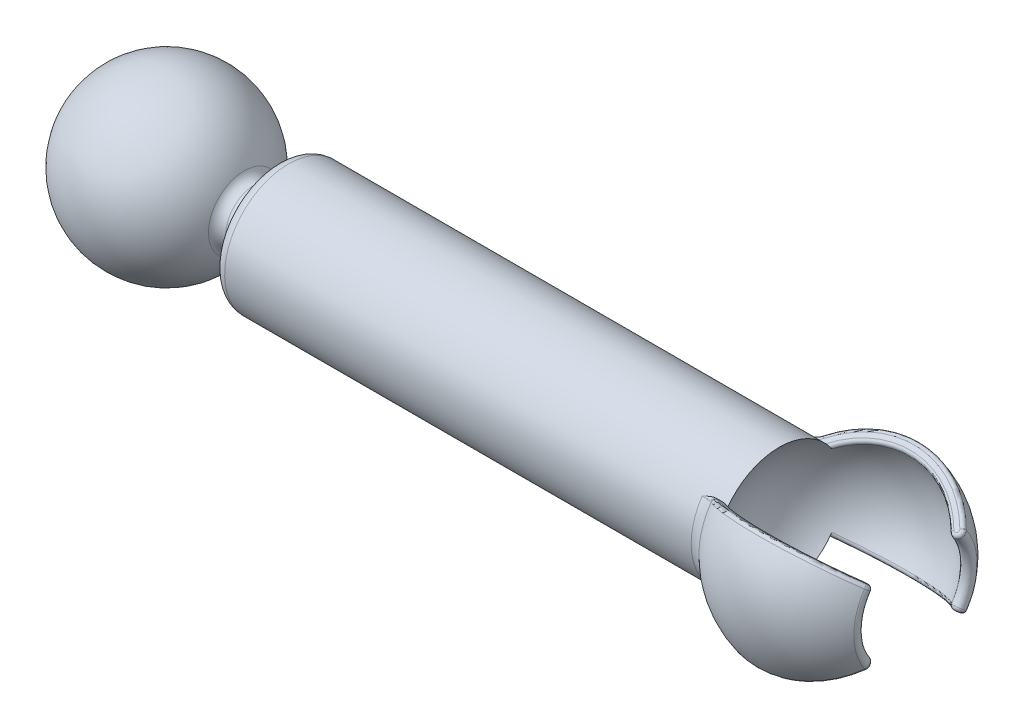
ISO-10303-21;
HEADER;
FILE_DESCRIPTION(('STEP AP214'),'2;1');
FILE_NAME('part.step','',(''),(''),'','','');
FILE_SCHEMA(('AUTOMOTIVE_DESIGN { 1 0 10303 214 1 1 1 1 }'));
ENDSEC;
DATA;
#1=APPLICATION_CONTEXT('core data for automotive mechanical design processes');
#2=APPLICATION_PROTOCOL_DEFINITION('international standard','automotive_design',2000,#1);
#3=PRODUCT_CONTEXT('',#1,'mechanical');
#4=PRODUCT('Part','Part','',(#3));
#5=PRODUCT_RELATED_PRODUCT_CATEGORY('part','',(#4));
#6=PRODUCT_DEFINITION_FORMATION('','',#4);
#7=PRODUCT_DEFINITION_CONTEXT('part definition',#1,'design');
#8=PRODUCT_DEFINITION('design','',#6,#7);
#9=PRODUCT_DEFINITION_SHAPE('','',#8);
#10=(LENGTH_UNIT() NAMED_UNIT(*) SI_UNIT(.MILLI.,.METRE.));
#11=(NAMED_UNIT(*) PLANE_ANGLE_UNIT() SI_UNIT($,.RADIAN.));
#12=(NAMED_UNIT(*) SI_UNIT($,.STERADIAN.) SOLID_ANGLE_UNIT());
#13=UNCERTAINTY_MEASURE_WITH_UNIT(LENGTH_MEASURE(1.E-05),#10,'distance_accuracy_value','');
#14=(GEOMETRIC_REPRESENTATION_CONTEXT(3) GLOBAL_UNCERTAINTY_ASSIGNED_CONTEXT((#13)) GLOBAL_UNIT_ASSIGNED_CONTEXT((#10,
#11,#12)) REPRESENTATION_CONTEXT('',''));
#15=CARTESIAN_POINT('',(0.,0.,0.));
#16=DIRECTION('',(0.,0.,1.));
#17=DIRECTION('',(1.,0.,0.));
#18=AXIS2_PLACEMENT_3D('',#15,#16,#17);
#19=CARTESIAN_POINT('',(73.4822,0.,0.));
#20=DIRECTION('',(1.,0.,0.));
#21=DIRECTION('',(0.,-1.,0.));
#22=AXIS2_PLACEMENT_3D('',#19,#20,#21);
#23=SPHERICAL_SURFACE('',#22,9.525);
#24=CARTESIAN_POINT('',(67.0064452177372,0.,0.));
#25=DIRECTION('',(1.,0.,0.));
#26=DIRECTION('',(0.,1.,0.));
#27=AXIS2_PLACEMENT_3D('',#24,#25,#26);
#28=CIRCLE('',#27,6.98499999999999);
#29=CARTESIAN_POINT('',(67.0064452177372,-3.95570425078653,5.75696351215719));
#30=VERTEX_POINT('',#29);
#31=CARTESIAN_POINT('',(67.0064452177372,-3.95570425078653,-5.7569635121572));
#32=VERTEX_POINT('',#31);
#33=EDGE_CURVE('E649',#30,#32,#28,.T.);
#34=ORIENTED_EDGE('',*,*,#33,.T.);
#35=CARTESIAN_POINT('',(73.4822,0.290641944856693,-0.223017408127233));
#36=DIRECTION('',(0.,-0.793353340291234,0.608761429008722));
#37=DIRECTION('',(0.,-0.608761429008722,-0.793353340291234));
#38=AXIS2_PLACEMENT_3D('',#35,#36,#37);
#39=CIRCLE('',#38,9.51795227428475);
#40=CARTESIAN_POINT('',(80.9176507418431,-3.32652235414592,-4.9369977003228));
#41=VERTEX_POINT('',#40);
#42=EDGE_CURVE('E229',#32,#41,#39,.T.);
#43=ORIENTED_EDGE('',*,*,#42,.T.);
#44=CARTESIAN_POINT('',(80.9176507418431,0.,0.));
#45=DIRECTION('',(1.,0.,0.));
#46=DIRECTION('',(0.,0.,-1.));
#47=AXIS2_PLACEMENT_3D('',#44,#45,#46);
#48=CIRCLE('',#47,5.95312500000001);
#49=CARTESIAN_POINT('',(80.9176507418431,3.32652235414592,-4.9369977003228));
#50=VERTEX_POINT('',#49);
#51=EDGE_CURVE('E693',#41,#50,#48,.T.);
#52=ORIENTED_EDGE('',*,*,#51,.T.);
#53=CARTESIAN_POINT('',(73.4822,-0.290641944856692,-0.223017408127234));
#54=DIRECTION('',(0.,0.793353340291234,0.608761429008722));
#55=DIRECTION('',(0.,-0.608761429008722,0.793353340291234));
#56=AXIS2_PLACEMENT_3D('',#53,#54,#55);
#57=CIRCLE('',#56,9.51795227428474);
#58=CARTESIAN_POINT('',(67.0064452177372,3.95570425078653,-5.75696351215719));
#59=VERTEX_POINT('',#58);
#60=EDGE_CURVE('E212',#50,#59,#57,.T.);
#61=ORIENTED_EDGE('',*,*,#60,.T.);
#62=CARTESIAN_POINT('',(67.0064452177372,3.95570425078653,5.7569635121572));
#63=VERTEX_POINT('',#62);
#64=EDGE_CURVE('E652',#59,#63,#28,.T.);
#65=ORIENTED_EDGE('',*,*,#64,.T.);
#66=CARTESIAN_POINT('',(73.4822,-0.290641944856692,0.223017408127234));
#67=DIRECTION('',(0.,0.793353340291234,-0.608761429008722));
#68=DIRECTION('',(0.,0.608761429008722,0.793353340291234));
#69=AXIS2_PLACEMENT_3D('',#66,#67,#68);
#70=CIRCLE('',#69,9.51795227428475);
#71=CARTESIAN_POINT('',(80.9176507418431,3.32652235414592,4.9369977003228));
#72=VERTEX_POINT('',#71);
#73=EDGE_CURVE('E207',#63,#72,#70,.T.);
#74=ORIENTED_EDGE('',*,*,#73,.T.);
#75=CARTESIAN_POINT('',(80.9176507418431,0.,0.));
#76=DIRECTION('',(-1.,0.,0.));
#77=DIRECTION('',(0.,0.,1.));
#78=AXIS2_PLACEMENT_3D('',#75,#76,#77);
#79=CIRCLE('',#78,5.95312500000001);
#80=CARTESIAN_POINT('',(80.9176507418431,-3.32652235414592,4.9369977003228));
#81=VERTEX_POINT('',#80);
#82=EDGE_CURVE('E701',#81,#72,#79,.T.);
#83=ORIENTED_EDGE('',*,*,#82,.F.);
#84=CARTESIAN_POINT('',(73.4822,0.290641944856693,0.223017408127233));
#85=DIRECTION('',(0.,-0.793353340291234,-0.608761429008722));
#86=DIRECTION('',(0.,0.608761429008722,-0.793353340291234));
#87=AXIS2_PLACEMENT_3D('',#84,#85,#86);
#88=CIRCLE('',#87,9.51795227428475);
#89=EDGE_CURVE('E216',#81,#30,#88,.T.);
#90=ORIENTED_EDGE('',*,*,#89,.T.);
#91=EDGE_LOOP('',(#34,#43,#52,#61,#65,#74,#83,#90));
#92=FACE_BOUND('',#91,.T.);
#93=ADVANCED_FACE('F38',(#92),#23,.F.);
#94=CARTESIAN_POINT('',(73.4822,0.,0.));
#95=DIRECTION('',(1.,0.,0.));
#96=DIRECTION('',(0.,1.,0.));
#97=AXIS2_PLACEMENT_3D('',#94,#95,#96);
#98=CYLINDRICAL_SURFACE('',#97,6.98499999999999);
#99=DIRECTION('',(-1.,0.,0.));
#100=VECTOR('',#99,1.);
#101=CARTESIAN_POINT('',(65.251659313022,-4.25219858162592,5.54157308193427));
#102=LINE('',#101,#100);
#103=CARTESIAN_POINT('',(66.4683957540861,-4.25219858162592,5.54157308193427));
#104=VERTEX_POINT('',#103);
#105=CARTESIAN_POINT('',(65.6768260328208,-4.25219858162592,5.54157308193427));
#106=VERTEX_POINT('',#105);
#107=EDGE_CURVE('E203',#104,#106,#102,.T.);
#108=ORIENTED_EDGE('',*,*,#107,.T.);
#109=CARTESIAN_POINT('',(66.1961930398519,-4.64609530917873,6.69354131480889));
#110=CARTESIAN_POINT('',(66.1890189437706,-4.95659476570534,6.4595600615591));
#111=CARTESIAN_POINT('',(66.5405933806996,-4.855452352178,6.32774870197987));
#112=CARTESIAN_POINT('',(66.1717296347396,-4.61415299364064,6.65277121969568));
#113=CARTESIAN_POINT('',(66.164141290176,-4.92530853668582,6.41878705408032));
#114=CARTESIAN_POINT('',(66.5115430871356,-4.81803093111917,6.27898015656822));
#115=CARTESIAN_POINT('',(66.1450936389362,-4.58285270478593,6.61284039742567));
#116=CARTESIAN_POINT('',(66.1371309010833,-4.89471346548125,6.37891478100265));
#117=CARTESIAN_POINT('',(66.4799128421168,-4.78137365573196,6.23120746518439));
#118=CARTESIAN_POINT('',(66.0876493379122,-4.52172910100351,6.5349001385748));
#119=CARTESIAN_POINT('',(66.0790072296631,-4.83503848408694,6.30114483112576));
#120=CARTESIAN_POINT('',(66.4116977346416,-4.70981137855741,6.13794568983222));
#121=CARTESIAN_POINT('',(66.056841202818,-4.49190572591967,6.49689062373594));
#122=CARTESIAN_POINT('',(66.0478884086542,-4.80596072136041,6.26324995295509));
#123=CARTESIAN_POINT('',(66.3751130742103,-4.67490630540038,6.0924565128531));
#124=CARTESIAN_POINT('',(65.958497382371,-4.40500962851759,6.38619654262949));
#125=CARTESIAN_POINT('',(65.9486717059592,-4.72128387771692,6.15289694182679));
#126=CARTESIAN_POINT('',(66.2583297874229,-4.57323641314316,5.95995772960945));
#127=CARTESIAN_POINT('',(65.8849796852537,-4.35042938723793,6.31674237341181));
#128=CARTESIAN_POINT('',(65.8747589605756,-4.66829673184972,6.08384274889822));
#129=CARTESIAN_POINT('',(66.1710275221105,-4.50942139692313,5.87679238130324));
#130=CARTESIAN_POINT('',(65.7243092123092,-4.24971765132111,6.18870181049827));
#131=CARTESIAN_POINT('',(65.7137355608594,-4.57073710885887,5.95670057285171));
#132=CARTESIAN_POINT('',(65.9802313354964,-4.39174054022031,5.72342770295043));
#133=CARTESIAN_POINT('',(65.6371755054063,-4.20357453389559,6.13010046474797));
#134=CARTESIAN_POINT('',(65.6266255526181,-4.52618592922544,5.89864034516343));
#135=CARTESIAN_POINT('',(65.8767600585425,-4.33786101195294,5.65321053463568));
#136=CARTESIAN_POINT('',(65.4516632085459,-4.12096248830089,6.02526795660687));
#137=CARTESIAN_POINT('',(65.441610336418,-4.44656614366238,5.79487782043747));
#138=CARTESIAN_POINT('',(65.6564642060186,-4.24144936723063,5.52756443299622));
#139=CARTESIAN_POINT('',(65.3532892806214,-4.08448956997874,5.97903169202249));
#140=CARTESIAN_POINT('',(65.3437197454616,-4.41153144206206,5.74921970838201));
#141=CARTESIAN_POINT('',(65.5396451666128,-4.19891257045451,5.47212940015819));
#142=CARTESIAN_POINT('',(65.1480488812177,-4.02227517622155,5.90021210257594));
#143=CARTESIAN_POINT('',(65.1398353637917,-4.35184043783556,5.67142887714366));
#144=CARTESIAN_POINT('',(65.2959221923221,-4.12638441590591,5.37760886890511));
#145=CARTESIAN_POINT('',(65.0411818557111,-3.99653440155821,5.8676296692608));
#146=CARTESIAN_POINT('',(65.0338822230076,-4.32722114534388,5.63934439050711));
#147=CARTESIAN_POINT('',(65.1690175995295,-4.09639387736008,5.338524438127));
#148=CARTESIAN_POINT('',(64.8219672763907,-3.95654109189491,5.81702504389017));
#149=CARTESIAN_POINT('',(64.8167474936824,-4.2889838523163,5.58951258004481));
#150=CARTESIAN_POINT('',(64.9087002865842,-4.04980906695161,5.27781393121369));
#151=CARTESIAN_POINT('',(64.7096175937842,-3.94229305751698,5.79900855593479));
#152=CARTESIAN_POINT('',(64.7056327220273,-4.27539758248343,5.57180660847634));
#153=CARTESIAN_POINT('',(64.7752850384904,-4.03322004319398,5.25619469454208));
#154=CARTESIAN_POINT('',(64.4827658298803,-3.92574966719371,5.77809081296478));
#155=CARTESIAN_POINT('',(64.4813064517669,-4.259612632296,5.55123526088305));
#156=CARTESIAN_POINT('',(64.5058985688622,-4.01395926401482,5.23109355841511));
#157=CARTESIAN_POINT('',(64.3682671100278,-3.92343698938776,5.77516765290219));
#158=CARTESIAN_POINT('',(64.3681843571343,-4.25740977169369,5.54836443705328));
#159=CARTESIAN_POINT('',(64.3699313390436,-4.01126733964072,5.22758537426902));
#160=CARTESIAN_POINT('',(64.1973578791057,-3.92893242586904,5.78211550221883));
#161=CARTESIAN_POINT('',(64.1992150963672,-4.26265259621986,5.55519701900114));
#162=CARTESIAN_POINT('',(64.1669766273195,-4.01766503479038,5.23592301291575));
#163=CARTESIAN_POINT('',(64.1404904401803,-3.93226351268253,5.78632678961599));
#164=CARTESIAN_POINT('',(64.1429956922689,-4.26582869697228,5.55933619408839));
#165=CARTESIAN_POINT('',(64.099446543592,-4.02154291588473,5.24097676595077));
#166=CARTESIAN_POINT('',(64.0274065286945,-3.94188664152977,5.79849507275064));
#167=CARTESIAN_POINT('',(64.0311586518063,-4.27501198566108,5.57130408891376));
#168=CARTESIAN_POINT('',(63.9651593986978,-4.03274711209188,5.25557835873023));
#169=CARTESIAN_POINT('',(63.9711900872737,-3.94817882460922,5.80645224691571));
#170=CARTESIAN_POINT('',(63.9755515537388,-4.28101753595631,5.57913067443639));
#171=CARTESIAN_POINT('',(63.8984023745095,-4.04007359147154,5.26512641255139));
#172=CARTESIAN_POINT('',(63.9154745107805,-3.95593422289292,5.81626173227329));
#173=CARTESIAN_POINT('',(63.9203940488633,-4.28842585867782,5.58878538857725));
#174=CARTESIAN_POINT('',(63.8322401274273,-4.04910497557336,5.27689634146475));
#175=(BOUNDED_SURFACE() B_SPLINE_SURFACE(3,2,((#109,#110,#111),(#112,#113,#114),(#115,#116,
#117),(#118,#119,#120),(#121,#122,#123),(#124,#125,#126),(#127,#128,#129),(#130,#131,#132),
(#133,#134,#135),(#136,#137,#138),(#139,#140,#141),(#142,#143,#144),(#145,#146,#147),(#148,#149,
#150),(#151,#152,#153),(#154,#155,#156),(#157,#158,#159),(#160,#161,#162),(#163,#164,#165),
(#166,#167,#168),(#169,#170,#171),(#172,#173,#174)),.UNSPECIFIED.,.F.,.F.,
.F.) B_SPLINE_SURFACE_WITH_KNOTS((4,2,2,2,2,2,2,2,2,2,4),(3,3),(0.,0.203845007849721,
0.407681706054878,0.814840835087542,1.22143477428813,1.62786068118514,2.03431312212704,
2.44092465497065,2.84694590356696,3.05022682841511,3.25351743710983),(0.,1.),
.UNSPECIFIED.) GEOMETRIC_REPRESENTATION_ITEM() RATIONAL_B_SPLINE_SURFACE(((1.,0.699855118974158,
1.),(1.,0.699365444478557,1.),(1.,0.698873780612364,1.),(1.,0.697891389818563,1.),(1.,
0.697400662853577,1.),(1.,0.695938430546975,1.),(1.,0.694975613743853,1.),(1.,0.693128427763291,
1.),(1.,0.692243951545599,1.),(1.,0.690609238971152,1.),(1.,0.689858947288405,1.),(1.,
0.688549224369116,1.),(1.,0.687989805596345,1.),(1.,0.687109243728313,1.),(1.,0.686788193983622,
1.),(1.,0.686414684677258,1.),(1.,0.68636183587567,1.),(1.,0.686486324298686,1.),(1.,
0.686561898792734,1.),(1.,0.686778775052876,1.),(1.,0.686920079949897,1.),(1.,0.687093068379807,1.))) REPRESENTATION_ITEM('') SURFACE());
#176=CARTESIAN_POINT('',(65.6768260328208,-4.25219858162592,5.54157308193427));
#177=CARTESIAN_POINT('',(65.6292705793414,-4.25216570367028,5.54159445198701));
#178=CARTESIAN_POINT('',(65.5818052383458,-4.25009515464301,5.5431876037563));
#179=CARTESIAN_POINT('',(65.4874256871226,-4.24257014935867,5.54895087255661));
#180=CARTESIAN_POINT('',(65.440510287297,-4.23712540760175,5.55311359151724));
#181=CARTESIAN_POINT('',(65.3478711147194,-4.22361491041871,5.56339545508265));
#182=CARTESIAN_POINT('',(65.3021398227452,-4.21558054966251,5.56949115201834));
#183=CARTESIAN_POINT('',(65.2113180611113,-4.19734290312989,5.58324927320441));
#184=CARTESIAN_POINT('',(65.1662281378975,-4.18713787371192,5.59091295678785));
#185=CARTESIAN_POINT('',(64.9921779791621,-4.14409503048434,5.62301050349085));
#186=CARTESIAN_POINT('',(64.8656410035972,-4.10491115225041,5.65178253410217));
#187=CARTESIAN_POINT('',(64.6153698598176,-4.01994489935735,5.71253065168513));
#188=CARTESIAN_POINT('',(64.4916473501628,-3.97413939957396,5.74451784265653));
#189=CARTESIAN_POINT('',(64.3648816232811,-3.92743259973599,5.77628772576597));
#190=CARTESIAN_POINT('',(64.3621365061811,-3.92642126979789,5.77697522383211));
#191=CARTESIAN_POINT('',(64.3593912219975,-3.92541003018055,5.77766225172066));
#192=B_SPLINE_CURVE_WITH_KNOTS('',3,(#176,#177,#178,#179,#180,#181,#182,#183,#184,#185,#186,
#187,#188,#189,#190,#191),.UNSPECIFIED.,.F.,.F.,(4,2,2,2,2,2,2,4),(0.,0.142470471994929,
0.284532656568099,0.424933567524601,0.565447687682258,0.971326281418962,1.37865822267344,
1.38767376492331),.UNSPECIFIED.);
#193=CARTESIAN_POINT('',(64.3593912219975,-3.92541003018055,5.77766225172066));
#194=VERTEX_POINT('',#193);
#195=EDGE_CURVE('E429',#106,#194,#192,.T.);
#196=ORIENTED_EDGE('',*,*,#195,.T.);
#197=CARTESIAN_POINT('',(64.3593912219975,0.,0.));
#198=DIRECTION('',(1.,0.,0.));
#199=DIRECTION('',(0.,1.,0.));
#200=AXIS2_PLACEMENT_3D('',#197,#198,#199);
#201=CIRCLE('',#200,6.98499999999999);
#202=CARTESIAN_POINT('',(64.3593912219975,3.92541003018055,5.77766225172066));
#203=VERTEX_POINT('',#202);
#204=EDGE_CURVE('E648',#194,#203,#201,.F.);
#205=ORIENTED_EDGE('',*,*,#204,.T.);
#206=CARTESIAN_POINT('',(66.5405933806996,4.855452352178,6.32774870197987));
#207=CARTESIAN_POINT('',(66.1890189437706,4.95659476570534,6.4595600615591));
#208=CARTESIAN_POINT('',(66.1961930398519,4.64609530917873,6.6935413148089));
#209=CARTESIAN_POINT('',(66.5115430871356,4.81803093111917,6.27898015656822));
#210=CARTESIAN_POINT('',(66.164141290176,4.92530853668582,6.41878705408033));
#211=CARTESIAN_POINT('',(66.1717296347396,4.61415299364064,6.65277121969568));
#212=CARTESIAN_POINT('',(66.4799128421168,4.78137365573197,6.23120746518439));
#213=CARTESIAN_POINT('',(66.1371309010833,4.89471346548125,6.37891478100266));
#214=CARTESIAN_POINT('',(66.1450936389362,4.58285270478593,6.61284039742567));
#215=CARTESIAN_POINT('',(66.4116977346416,4.70981137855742,6.13794568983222));
#216=CARTESIAN_POINT('',(66.0790072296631,4.83503848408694,6.30114483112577));
#217=CARTESIAN_POINT('',(66.0876493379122,4.52172910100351,6.53490013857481));
#218=CARTESIAN_POINT('',(66.3751130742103,4.67490630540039,6.09245651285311));
#219=CARTESIAN_POINT('',(66.0478884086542,4.80596072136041,6.26324995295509));
#220=CARTESIAN_POINT('',(66.056841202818,4.49190572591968,6.49689062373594));
#221=CARTESIAN_POINT('',(66.2583297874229,4.57323641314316,5.95995772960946));
#222=CARTESIAN_POINT('',(65.9486717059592,4.72128387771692,6.15289694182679));
#223=CARTESIAN_POINT('',(65.958497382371,4.40500962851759,6.3861965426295));
#224=CARTESIAN_POINT('',(66.1710275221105,4.50942139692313,5.87679238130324));
#225=CARTESIAN_POINT('',(65.8747589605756,4.66829673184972,6.08384274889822));
#226=CARTESIAN_POINT('',(65.8849796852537,4.35042938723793,6.31674237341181));
#227=CARTESIAN_POINT('',(65.9802313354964,4.39174054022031,5.72342770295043));
#228=CARTESIAN_POINT('',(65.7137355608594,4.57073710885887,5.95670057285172));
#229=CARTESIAN_POINT('',(65.7243092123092,4.24971765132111,6.18870181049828));
#230=CARTESIAN_POINT('',(65.8767600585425,4.33786101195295,5.6532105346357));
#231=CARTESIAN_POINT('',(65.6266255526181,4.52618592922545,5.89864034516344));
#232=CARTESIAN_POINT('',(65.6371755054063,4.20357453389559,6.13010046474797));
#233=CARTESIAN_POINT('',(65.6564642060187,4.24144936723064,5.52756443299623));
#234=CARTESIAN_POINT('',(65.441610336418,4.44656614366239,5.79487782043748));
#235=CARTESIAN_POINT('',(65.4516632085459,4.1209624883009,6.02526795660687));
#236=CARTESIAN_POINT('',(65.5396451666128,4.19891257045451,5.47212940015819));
#237=CARTESIAN_POINT('',(65.3437197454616,4.41153144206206,5.74921970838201));
#238=CARTESIAN_POINT('',(65.3532892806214,4.08448956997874,5.97903169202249));
#239=CARTESIAN_POINT('',(65.2959221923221,4.12638441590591,5.37760886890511));
#240=CARTESIAN_POINT('',(65.1398353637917,4.35184043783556,5.67142887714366));
#241=CARTESIAN_POINT('',(65.1480488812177,4.02227517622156,5.90021210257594));
#242=CARTESIAN_POINT('',(65.1690175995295,4.09639387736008,5.338524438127));
#243=CARTESIAN_POINT('',(65.0338822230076,4.32722114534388,5.63934439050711));
#244=CARTESIAN_POINT('',(65.0411818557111,3.99653440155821,5.8676296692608));
#245=CARTESIAN_POINT('',(64.9087002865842,4.04980906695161,5.27781393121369));
#246=CARTESIAN_POINT('',(64.8167474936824,4.2889838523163,5.58951258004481));
#247=CARTESIAN_POINT('',(64.8219672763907,3.95654109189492,5.81702504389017));
#248=CARTESIAN_POINT('',(64.7752850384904,4.03322004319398,5.25619469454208));
#249=CARTESIAN_POINT('',(64.7056327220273,4.27539758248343,5.57180660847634));
#250=CARTESIAN_POINT('',(64.7096175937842,3.94229305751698,5.7990085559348));
#251=CARTESIAN_POINT('',(64.5058985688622,4.01395926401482,5.23109355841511));
#252=CARTESIAN_POINT('',(64.4813064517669,4.259612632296,5.55123526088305));
#253=CARTESIAN_POINT('',(64.4827658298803,3.92574966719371,5.77809081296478));
#254=CARTESIAN_POINT('',(64.3699313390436,4.01126733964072,5.22758537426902));
#255=CARTESIAN_POINT('',(64.3681843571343,4.25740977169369,5.54836443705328));
#256=CARTESIAN_POINT('',(64.3682671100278,3.92343698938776,5.77516765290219));
#257=CARTESIAN_POINT('',(64.1669766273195,4.01766503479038,5.23592301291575));
#258=CARTESIAN_POINT('',(64.1992150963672,4.26265259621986,5.55519701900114));
#259=CARTESIAN_POINT('',(64.1973578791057,3.92893242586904,5.78211550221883));
#260=CARTESIAN_POINT('',(64.099446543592,4.02154291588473,5.24097676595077));
#261=CARTESIAN_POINT('',(64.1429956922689,4.26582869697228,5.55933619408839));
#262=CARTESIAN_POINT('',(64.1404904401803,3.93226351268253,5.78632678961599));
#263=CARTESIAN_POINT('',(63.9651593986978,4.03274711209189,5.25557835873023));
#264=CARTESIAN_POINT('',(64.0311586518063,4.27501198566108,5.57130408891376));
#265=CARTESIAN_POINT('',(64.0274065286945,3.94188664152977,5.79849507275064));
#266=CARTESIAN_POINT('',(63.8984023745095,4.04007359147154,5.26512641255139));
#267=CARTESIAN_POINT('',(63.9755515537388,4.28101753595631,5.57913067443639));
#268=CARTESIAN_POINT('',(63.9711900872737,3.94817882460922,5.80645224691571));
#269=CARTESIAN_POINT('',(63.8322401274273,4.04910497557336,5.27689634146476));
#270=CARTESIAN_POINT('',(63.9203940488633,4.28842585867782,5.58878538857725));
#271=CARTESIAN_POINT('',(63.9154745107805,3.95593422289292,5.81626173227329));
#272=(BOUNDED_SURFACE() B_SPLINE_SURFACE(3,2,((#206,#207,#208),(#209,#210,#211),(#212,#213,
#214),(#215,#216,#217),(#218,#219,#220),(#221,#222,#223),(#224,#225,#226),(#227,#228,#229),
(#230,#231,#232),(#233,#234,#235),(#236,#237,#238),(#239,#240,#241),(#242,#243,#244),(#245,#246,
#247),(#248,#249,#250),(#251,#252,#253),(#254,#255,#256),(#257,#258,#259),(#260,#261,#262),
(#263,#264,#265),(#266,#267,#268),(#269,#270,#271)),.UNSPECIFIED.,.F.,.F.,
.F.) B_SPLINE_SURFACE_WITH_KNOTS((4,2,2,2,2,2,2,2,2,2,4),(3,3),(0.,0.203845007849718,
0.407681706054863,0.814840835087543,1.22143477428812,1.62786068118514,2.03431312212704,
2.44092465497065,2.84694590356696,3.05022682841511,3.25351743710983),(0.,1.),
.UNSPECIFIED.) GEOMETRIC_REPRESENTATION_ITEM() RATIONAL_B_SPLINE_SURFACE(((1.,0.699855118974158,
1.),(1.,0.699365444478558,1.),(1.,0.698873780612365,1.),(1.,0.697891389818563,1.),(1.,
0.697400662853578,1.),(1.,0.695938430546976,1.),(1.,0.694975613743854,1.),(1.,0.693128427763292,
1.),(1.,0.6922439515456,1.),(1.,0.690609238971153,1.),(1.,0.689858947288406,1.),(1.,
0.688549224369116,1.),(1.,0.687989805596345,1.),(1.,0.687109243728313,1.),(1.,0.686788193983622,
1.),(1.,0.686414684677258,1.),(1.,0.68636183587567,1.),(1.,0.686486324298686,1.),(1.,
0.686561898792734,1.),(1.,0.686778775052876,1.),(1.,0.686920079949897,1.),(1.,0.687093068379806,1.))) REPRESENTATION_ITEM('') SURFACE());
#273=CARTESIAN_POINT('',(65.6768260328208,4.25219858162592,5.54157308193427));
#274=CARTESIAN_POINT('',(65.629270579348,4.25216570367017,5.54159445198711));
#275=CARTESIAN_POINT('',(65.5818052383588,4.25009515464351,5.54318760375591));
#276=CARTESIAN_POINT('',(65.4874256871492,4.24257014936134,5.54895087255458));
#277=CARTESIAN_POINT('',(65.4405102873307,4.23712540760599,5.55311359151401));
#278=CARTESIAN_POINT('',(65.3478711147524,4.22361491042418,5.5633954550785));
#279=CARTESIAN_POINT('',(65.3021398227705,4.21558054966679,5.5694911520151));
#280=CARTESIAN_POINT('',(65.2113180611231,4.19734290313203,5.58324927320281));
#281=CARTESIAN_POINT('',(65.1662281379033,4.18713787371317,5.59091295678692));
#282=CARTESIAN_POINT('',(64.9921779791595,4.14409503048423,5.62301050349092));
#283=CARTESIAN_POINT('',(64.8656410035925,4.10491115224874,5.65178253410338));
#284=CARTESIAN_POINT('',(64.6153698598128,4.01994489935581,5.71253065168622));
#285=CARTESIAN_POINT('',(64.4916473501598,3.97413939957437,5.74451784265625));
#286=CARTESIAN_POINT('',(64.3648816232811,3.92743259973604,5.77628772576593));
#287=CARTESIAN_POINT('',(64.362136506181,3.92642126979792,5.7769752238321));
#288=CARTESIAN_POINT('',(64.3593912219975,3.92541003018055,5.77766225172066));
#289=B_SPLINE_CURVE_WITH_KNOTS('',3,(#273,#274,#275,#276,#277,#278,#279,#280,#281,#282,#283,
#284,#285,#286,#287,#288),.UNSPECIFIED.,.F.,.F.,(4,2,2,2,2,2,2,4),(0.,0.142470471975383,
0.284532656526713,0.424933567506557,0.565447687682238,0.97132628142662,1.37865822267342,
1.38767376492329),.UNSPECIFIED.);
#290=CARTESIAN_POINT('',(65.6768260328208,4.25219858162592,5.54157308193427));
#291=VERTEX_POINT('',#290);
#292=EDGE_CURVE('E202',#203,#291,#289,.F.);
#293=ORIENTED_EDGE('',*,*,#292,.T.);
#294=DIRECTION('',(-1.,0.,0.));
#295=VECTOR('',#294,1.);
#296=CARTESIAN_POINT('',(65.251659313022,4.25219858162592,5.54157308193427));
#297=LINE('',#296,#295);
#298=CARTESIAN_POINT('',(66.4683957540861,4.25219858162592,5.54157308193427));
#299=VERTEX_POINT('',#298);
#300=EDGE_CURVE('E186',#299,#291,#297,.T.);
#301=ORIENTED_EDGE('',*,*,#300,.F.);
#302=CARTESIAN_POINT('',(66.4683957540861,4.25219858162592,5.54157308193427));
#303=CARTESIAN_POINT('',(66.4893417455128,4.25219394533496,5.54157609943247));
#304=CARTESIAN_POINT('',(66.5102723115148,4.25151076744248,5.54210099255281));
#305=CARTESIAN_POINT('',(66.5520170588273,4.24877385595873,5.54419962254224));
#306=CARTESIAN_POINT('',(66.5728310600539,4.24671839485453,5.54577468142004));
#307=CARTESIAN_POINT('',(66.6352581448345,4.23842700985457,5.55211818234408));
#308=CARTESIAN_POINT('',(66.6764791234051,4.23006549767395,5.55850521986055));
#309=CARTESIAN_POINT('',(66.7436057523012,4.21088591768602,5.57303837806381));
#310=CARTESIAN_POINT('',(66.7702415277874,4.20167427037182,5.57999443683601));
#311=CARTESIAN_POINT('',(66.8214631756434,4.18014500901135,5.59614110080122));
#312=CARTESIAN_POINT('',(66.8460557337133,4.16783810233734,5.60532399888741));
#313=CARTESIAN_POINT('',(66.8853263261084,4.14387852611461,5.62304604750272));
#314=CARTESIAN_POINT('',(66.9007991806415,4.13308907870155,5.63098664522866));
#315=CARTESIAN_POINT('',(66.9295249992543,4.10966362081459,5.64810586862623));
#316=CARTESIAN_POINT('',(66.9427805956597,4.09702983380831,5.65728300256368));
#317=CARTESIAN_POINT('',(66.9636294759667,4.07292073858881,5.67465511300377));
#318=CARTESIAN_POINT('',(66.9718267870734,4.06180477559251,5.68262009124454));
#319=CARTESIAN_POINT('',(66.9858664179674,4.03858837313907,5.6991429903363));
#320=CARTESIAN_POINT('',(66.9917143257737,4.02649035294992,5.70769944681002));
#321=CARTESIAN_POINT('',(66.9995363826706,4.00462643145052,5.72305195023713));
#322=CARTESIAN_POINT('',(67.0021085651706,3.99501528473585,5.72976573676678));
#323=CARTESIAN_POINT('',(67.005574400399,3.97551477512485,5.74331364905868));
#324=CARTESIAN_POINT('',(67.0064605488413,3.96562436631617,5.7501481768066));
#325=CARTESIAN_POINT('',(67.0064452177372,3.95570425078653,5.75696351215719));
#326=B_SPLINE_CURVE_WITH_KNOTS('',3,(#302,#303,#304,#305,#306,#307,#308,#309,#310,#311,#312,
#313,#314,#315,#316,#317,#318,#319,#320,#321,#322,#323,#324,#325),.UNSPECIFIED.,.F.,.F.,(4,2,2,
2,2,2,2,2,2,2,2,4),(0.,0.0627892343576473,0.125657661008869,0.252513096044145,0.339360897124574,
0.425912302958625,0.48712556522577,0.548265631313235,0.595916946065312,0.643454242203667,
0.679345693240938,0.71539652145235),.UNSPECIFIED.);
#327=EDGE_CURVE('E11',#299,#63,#326,.T.);
#328=ORIENTED_EDGE('',*,*,#327,.T.);
#329=ORIENTED_EDGE('',*,*,#64,.F.);
#330=CARTESIAN_POINT('',(67.0064452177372,3.95570425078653,-5.7569635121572));
#331=CARTESIAN_POINT('',(67.0064936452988,3.96900837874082,-5.74782489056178));
#332=CARTESIAN_POINT('',(67.0048814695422,3.98224128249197,-5.73866169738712));
#333=CARTESIAN_POINT('',(66.998702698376,4.00804036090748,-5.72067072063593));
#334=CARTESIAN_POINT('',(66.9941660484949,4.02061191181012,-5.71184048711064));
#335=CARTESIAN_POINT('',(66.9825101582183,4.04481097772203,-5.69473014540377));
#336=CARTESIAN_POINT('',(66.9753988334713,4.05644125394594,-5.68644844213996));
#337=CARTESIAN_POINT('',(66.9590672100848,4.07865099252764,-5.67053945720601));
#338=CARTESIAN_POINT('',(66.9498414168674,4.08922761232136,-5.66291395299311));
#339=CARTESIAN_POINT('',(66.9251507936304,4.11381498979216,-5.64509315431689));
#340=CARTESIAN_POINT('',(66.9087592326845,4.12719275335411,-5.63531144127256));
#341=CARTESIAN_POINT('',(66.8735759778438,4.15163941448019,-5.61732549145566));
#342=CARTESIAN_POINT('',(66.8547793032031,4.16270339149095,-5.60912461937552));
#343=CARTESIAN_POINT('',(66.8066667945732,4.18722960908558,-5.59085540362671));
#344=CARTESIAN_POINT('',(66.7764372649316,4.19951459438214,-5.58161905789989));
#345=CARTESIAN_POINT('',(66.713937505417,4.2201113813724,-5.5660622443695));
#346=CARTESIAN_POINT('',(66.6816631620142,4.22841486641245,-5.55974788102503));
#347=CARTESIAN_POINT('',(66.6192473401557,4.24070267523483,-5.55038030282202));
#348=CARTESIAN_POINT('',(66.5892111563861,4.24503329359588,-5.54706606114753));
#349=CARTESIAN_POINT('',(66.5289094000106,4.25076188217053,-5.54267534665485));
#350=CARTESIAN_POINT('',(66.4986468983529,4.25218013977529,-5.54158339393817));
#351=CARTESIAN_POINT('',(66.4683957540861,4.25219858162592,-5.54157308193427));
#352=B_SPLINE_CURVE_WITH_KNOTS('',3,(#330,#331,#332,#333,#334,#335,#336,#337,#338,#339,#340,
#341,#342,#343,#344,#345,#346,#347,#348,#349,#350,#351),.UNSPECIFIED.,.F.,.F.,(4,2,2,2,2,2,2,2,
2,2,4),(0.,0.04826832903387,0.0960500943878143,0.143686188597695,0.191447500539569,
0.260985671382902,0.330670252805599,0.431860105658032,0.533260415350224,0.62461905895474,
0.715339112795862),.UNSPECIFIED.);
#353=CARTESIAN_POINT('',(66.4683957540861,4.25219858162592,-5.54157308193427));
#354=VERTEX_POINT('',#353);
#355=EDGE_CURVE('E52',#59,#354,#352,.T.);
#356=ORIENTED_EDGE('',*,*,#355,.T.);
#357=DIRECTION('',(-1.,0.,0.));
#358=VECTOR('',#357,1.);
#359=CARTESIAN_POINT('',(65.251659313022,4.25219858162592,-5.54157308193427));
#360=LINE('',#359,#358);
#361=CARTESIAN_POINT('',(65.6768260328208,4.25219858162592,-5.54157308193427));
#362=VERTEX_POINT('',#361);
#363=EDGE_CURVE('E479',#354,#362,#360,.T.);
#364=ORIENTED_EDGE('',*,*,#363,.T.);
#365=CARTESIAN_POINT('',(66.1961930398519,4.64609530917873,-6.6935413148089));
#366=CARTESIAN_POINT('',(66.1890189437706,4.95659476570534,-6.4595600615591));
#367=CARTESIAN_POINT('',(66.5405933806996,4.855452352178,-6.32774870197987));
#368=CARTESIAN_POINT('',(66.1717296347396,4.61415299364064,-6.65277121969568));
#369=CARTESIAN_POINT('',(66.164141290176,4.92530853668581,-6.41878705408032));
#370=CARTESIAN_POINT('',(66.5115430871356,4.81803093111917,-6.27898015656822));
#371=CARTESIAN_POINT('',(66.1450936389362,4.58285270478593,-6.61284039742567));
#372=CARTESIAN_POINT('',(66.1371309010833,4.89471346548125,-6.37891478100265));
#373=CARTESIAN_POINT('',(66.4799128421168,4.78137365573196,-6.23120746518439));
#374=CARTESIAN_POINT('',(66.0876493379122,4.52172910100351,-6.5349001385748));
#375=CARTESIAN_POINT('',(66.0790072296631,4.83503848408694,-6.30114483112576));
#376=CARTESIAN_POINT('',(66.4116977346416,4.70981137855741,-6.13794568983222));
#377=CARTESIAN_POINT('',(66.056841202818,4.49190572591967,-6.49689062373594));
#378=CARTESIAN_POINT('',(66.0478884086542,4.80596072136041,-6.26324995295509));
#379=CARTESIAN_POINT('',(66.3751130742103,4.67490630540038,-6.0924565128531));
#380=CARTESIAN_POINT('',(65.958497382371,4.40500962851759,-6.38619654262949));
#381=CARTESIAN_POINT('',(65.9486717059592,4.72128387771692,-6.15289694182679));
#382=CARTESIAN_POINT('',(66.2583297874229,4.57323641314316,-5.95995772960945));
#383=CARTESIAN_POINT('',(65.8849796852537,4.35042938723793,-6.31674237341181));
#384=CARTESIAN_POINT('',(65.8747589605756,4.66829673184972,-6.08384274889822));
#385=CARTESIAN_POINT('',(66.1710275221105,4.50942139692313,-5.87679238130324));
#386=CARTESIAN_POINT('',(65.7243092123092,4.24971765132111,-6.18870181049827));
#387=CARTESIAN_POINT('',(65.7137355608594,4.57073710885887,-5.95670057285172));
#388=CARTESIAN_POINT('',(65.9802313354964,4.39174054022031,-5.72342770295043));
#389=CARTESIAN_POINT('',(65.6371755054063,4.20357453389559,-6.13010046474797));
#390=CARTESIAN_POINT('',(65.6266255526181,4.52618592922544,-5.89864034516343));
#391=CARTESIAN_POINT('',(65.8767600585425,4.33786101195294,-5.65321053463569));
#392=CARTESIAN_POINT('',(65.4516632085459,4.12096248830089,-6.02526795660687));
#393=CARTESIAN_POINT('',(65.441610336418,4.44656614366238,-5.79487782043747));
#394=CARTESIAN_POINT('',(65.6564642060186,4.24144936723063,-5.52756443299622));
#395=CARTESIAN_POINT('',(65.3532892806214,4.08448956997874,-5.97903169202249));
#396=CARTESIAN_POINT('',(65.3437197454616,4.41153144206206,-5.74921970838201));
#397=CARTESIAN_POINT('',(65.5396451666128,4.19891257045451,-5.47212940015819));
#398=CARTESIAN_POINT('',(65.1480488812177,4.02227517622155,-5.90021210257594));
#399=CARTESIAN_POINT('',(65.1398353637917,4.35184043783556,-5.67142887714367));
#400=CARTESIAN_POINT('',(65.2959221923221,4.12638441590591,-5.37760886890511));
#401=CARTESIAN_POINT('',(65.0411818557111,3.99653440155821,-5.8676296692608));
#402=CARTESIAN_POINT('',(65.0338822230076,4.32722114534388,-5.63934439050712));
#403=CARTESIAN_POINT('',(65.1690175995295,4.09639387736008,-5.338524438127));
#404=CARTESIAN_POINT('',(64.8219672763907,3.95654109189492,-5.81702504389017));
#405=CARTESIAN_POINT('',(64.8167474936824,4.2889838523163,-5.58951258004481));
#406=CARTESIAN_POINT('',(64.9087002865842,4.04980906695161,-5.27781393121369));
#407=CARTESIAN_POINT('',(64.7096175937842,3.94229305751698,-5.7990085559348));
#408=CARTESIAN_POINT('',(64.7056327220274,4.27539758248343,-5.57180660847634));
#409=CARTESIAN_POINT('',(64.7752850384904,4.03322004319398,-5.25619469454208));
#410=CARTESIAN_POINT('',(64.4827658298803,3.92574966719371,-5.77809081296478));
#411=CARTESIAN_POINT('',(64.4813064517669,4.259612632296,-5.55123526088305));
#412=CARTESIAN_POINT('',(64.5058985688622,4.01395926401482,-5.23109355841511));
#413=CARTESIAN_POINT('',(64.3682671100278,3.92343698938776,-5.77516765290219));
#414=CARTESIAN_POINT('',(64.3681843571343,4.25740977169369,-5.54836443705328));
#415=CARTESIAN_POINT('',(64.3699313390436,4.01126733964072,-5.22758537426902));
#416=CARTESIAN_POINT('',(64.1973578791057,3.92893242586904,-5.78211550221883));
#417=CARTESIAN_POINT('',(64.1992150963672,4.26265259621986,-5.55519701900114));
#418=CARTESIAN_POINT('',(64.1669766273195,4.01766503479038,-5.23592301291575));
#419=CARTESIAN_POINT('',(64.1404904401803,3.93226351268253,-5.78632678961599));
#420=CARTESIAN_POINT('',(64.1429956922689,4.26582869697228,-5.55933619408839));
#421=CARTESIAN_POINT('',(64.099446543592,4.02154291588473,-5.24097676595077));
#422=CARTESIAN_POINT('',(64.0274065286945,3.94188664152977,-5.79849507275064));
#423=CARTESIAN_POINT('',(64.0311586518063,4.27501198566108,-5.57130408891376));
#424=CARTESIAN_POINT('',(63.9651593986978,4.03274711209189,-5.25557835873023));
#425=CARTESIAN_POINT('',(63.9711900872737,3.94817882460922,-5.80645224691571));
#426=CARTESIAN_POINT('',(63.9755515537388,4.28101753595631,-5.57913067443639));
#427=CARTESIAN_POINT('',(63.8984023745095,4.04007359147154,-5.26512641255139));
#428=CARTESIAN_POINT('',(63.9154745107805,3.95593422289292,-5.81626173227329));
#429=CARTESIAN_POINT('',(63.9203940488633,4.28842585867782,-5.58878538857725));
#430=CARTESIAN_POINT('',(63.8322401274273,4.04910497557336,-5.27689634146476));
#431=(BOUNDED_SURFACE() B_SPLINE_SURFACE(3,2,((#365,#366,#367),(#368,#369,#370),(#371,#372,
#373),(#374,#375,#376),(#377,#378,#379),(#380,#381,#382),(#383,#384,#385),(#386,#387,#388),
(#389,#390,#391),(#392,#393,#394),(#395,#396,#397),(#398,#399,#400),(#401,#402,#403),(#404,#405,
#406),(#407,#408,#409),(#410,#411,#412),(#413,#414,#415),(#416,#417,#418),(#419,#420,#421),
(#422,#423,#424),(#425,#426,#427),(#428,#429,#430)),.UNSPECIFIED.,.F.,.F.,
.F.) B_SPLINE_SURFACE_WITH_KNOTS((4,2,2,2,2,2,2,2,2,2,4),(3,3),(0.,0.203845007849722,
0.407681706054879,0.814840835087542,1.22143477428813,1.62786068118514,2.03431312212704,
2.44092465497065,2.84694590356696,3.05022682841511,3.25351743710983),(0.,1.),
.UNSPECIFIED.) GEOMETRIC_REPRESENTATION_ITEM() RATIONAL_B_SPLINE_SURFACE(((1.,0.699855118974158,
1.),(1.,0.699365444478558,1.),(1.,0.698873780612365,1.),(1.,0.697891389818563,1.),(1.,
0.697400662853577,1.),(1.,0.695938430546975,1.),(1.,0.694975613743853,1.),(1.,0.693128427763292,
1.),(1.,0.6922439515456,1.),(1.,0.690609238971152,1.),(1.,0.689858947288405,1.),(1.,
0.688549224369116,1.),(1.,0.687989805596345,1.),(1.,0.687109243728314,1.),(1.,0.686788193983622,
1.),(1.,0.686414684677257,1.),(1.,0.68636183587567,1.),(1.,0.686486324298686,1.),(1.,
0.686561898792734,1.),(1.,0.686778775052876,1.),(1.,0.686920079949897,1.),(1.,0.687093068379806,1.))) REPRESENTATION_ITEM('') SURFACE());
#432=CARTESIAN_POINT('',(65.6768260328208,4.25219858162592,-5.54157308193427));
#433=CARTESIAN_POINT('',(65.6292705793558,4.25216570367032,-5.54159445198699));
#434=CARTESIAN_POINT('',(65.5818052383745,4.25009515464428,-5.54318760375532));
#435=CARTESIAN_POINT('',(65.4874256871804,4.24257014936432,-5.54895087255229));
#436=CARTESIAN_POINT('',(65.4405102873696,4.23712540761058,-5.5531135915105));
#437=CARTESIAN_POINT('',(65.3478711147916,4.22361491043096,-5.56339545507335));
#438=CARTESIAN_POINT('',(65.3021398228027,4.21558054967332,-5.56949115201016));
#439=CARTESIAN_POINT('',(65.2113180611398,4.19734290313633,-5.58324927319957));
#440=CARTESIAN_POINT('',(65.1662281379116,4.18713787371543,-5.59091295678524));
#441=CARTESIAN_POINT('',(64.9921779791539,4.14409503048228,-5.62301050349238));
#442=CARTESIAN_POINT('',(64.8656410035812,4.10491115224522,-5.65178253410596));
#443=CARTESIAN_POINT('',(64.6153698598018,4.01994489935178,-5.71253065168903));
#444=CARTESIAN_POINT('',(64.4916473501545,3.97413939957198,-5.74451784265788));
#445=CARTESIAN_POINT('',(64.3648816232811,3.92743259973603,-5.77628772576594));
#446=CARTESIAN_POINT('',(64.3621365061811,3.92642126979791,-5.7769752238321));
#447=CARTESIAN_POINT('',(64.3593912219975,3.92541003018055,-5.77766225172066));
#448=B_SPLINE_CURVE_WITH_KNOTS('',3,(#432,#433,#434,#435,#436,#437,#438,#439,#440,#441,#442,
#443,#444,#445,#446,#447),.UNSPECIFIED.,.F.,.F.,(4,2,2,2,2,2,2,4),(0.,0.142470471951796,
0.284532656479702,0.424933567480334,0.565447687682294,0.97132628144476,1.37865822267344,
1.38767376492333),.UNSPECIFIED.);
#449=CARTESIAN_POINT('',(64.3593912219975,3.92541003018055,-5.77766225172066));
#450=VERTEX_POINT('',#449);
#451=EDGE_CURVE('E440',#362,#450,#448,.T.);
#452=ORIENTED_EDGE('',*,*,#451,.T.);
#453=CARTESIAN_POINT('',(64.3593912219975,0.,0.));
#454=DIRECTION('',(1.,0.,0.));
#455=DIRECTION('',(0.,1.,0.));
#456=AXIS2_PLACEMENT_3D('',#453,#454,#455);
#457=CIRCLE('',#456,6.98499999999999);
#458=CARTESIAN_POINT('',(64.3593912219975,-3.92541003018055,-5.77766225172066));
#459=VERTEX_POINT('',#458);
#460=EDGE_CURVE('E647',#450,#459,#457,.F.);
#461=ORIENTED_EDGE('',*,*,#460,.T.);
#462=CARTESIAN_POINT('',(66.5405933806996,-4.855452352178,-6.32774870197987));
#463=CARTESIAN_POINT('',(66.1890189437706,-4.95659476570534,-6.4595600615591));
#464=CARTESIAN_POINT('',(66.1961930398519,-4.64609530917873,-6.69354131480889));
#465=CARTESIAN_POINT('',(66.5115430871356,-4.81803093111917,-6.27898015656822));
#466=CARTESIAN_POINT('',(66.164141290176,-4.92530853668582,-6.41878705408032));
#467=CARTESIAN_POINT('',(66.1717296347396,-4.61415299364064,-6.65277121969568));
#468=CARTESIAN_POINT('',(66.4799128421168,-4.78137365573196,-6.23120746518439));
#469=CARTESIAN_POINT('',(66.1371309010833,-4.89471346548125,-6.37891478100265));
#470=CARTESIAN_POINT('',(66.1450936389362,-4.58285270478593,-6.61284039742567));
#471=CARTESIAN_POINT('',(66.4116977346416,-4.70981137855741,-6.13794568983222));
#472=CARTESIAN_POINT('',(66.0790072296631,-4.83503848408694,-6.30114483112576));
#473=CARTESIAN_POINT('',(66.0876493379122,-4.52172910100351,-6.5349001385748));
#474=CARTESIAN_POINT('',(66.3751130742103,-4.67490630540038,-6.0924565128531));
#475=CARTESIAN_POINT('',(66.0478884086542,-4.80596072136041,-6.26324995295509));
#476=CARTESIAN_POINT('',(66.056841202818,-4.49190572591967,-6.49689062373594));
#477=CARTESIAN_POINT('',(66.2583297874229,-4.57323641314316,-5.95995772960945));
#478=CARTESIAN_POINT('',(65.9486717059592,-4.72128387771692,-6.15289694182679));
#479=CARTESIAN_POINT('',(65.958497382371,-4.40500962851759,-6.38619654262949));
#480=CARTESIAN_POINT('',(66.1710275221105,-4.50942139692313,-5.87679238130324));
#481=CARTESIAN_POINT('',(65.8747589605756,-4.66829673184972,-6.08384274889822));
#482=CARTESIAN_POINT('',(65.8849796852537,-4.35042938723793,-6.31674237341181));
#483=CARTESIAN_POINT('',(65.9802313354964,-4.39174054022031,-5.72342770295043));
#484=CARTESIAN_POINT('',(65.7137355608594,-4.57073710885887,-5.95670057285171));
#485=CARTESIAN_POINT('',(65.7243092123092,-4.24971765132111,-6.18870181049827));
#486=CARTESIAN_POINT('',(65.8767600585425,-4.33786101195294,-5.65321053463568));
#487=CARTESIAN_POINT('',(65.6266255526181,-4.52618592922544,-5.89864034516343));
#488=CARTESIAN_POINT('',(65.6371755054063,-4.20357453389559,-6.13010046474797));
#489=CARTESIAN_POINT('',(65.6564642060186,-4.24144936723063,-5.52756443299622));
#490=CARTESIAN_POINT('',(65.441610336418,-4.44656614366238,-5.79487782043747));
#491=CARTESIAN_POINT('',(65.4516632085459,-4.12096248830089,-6.02526795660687));
#492=CARTESIAN_POINT('',(65.5396451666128,-4.19891257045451,-5.47212940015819));
#493=CARTESIAN_POINT('',(65.3437197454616,-4.41153144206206,-5.74921970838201));
#494=CARTESIAN_POINT('',(65.3532892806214,-4.08448956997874,-5.97903169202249));
#495=CARTESIAN_POINT('',(65.2959221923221,-4.12638441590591,-5.37760886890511));
#496=CARTESIAN_POINT('',(65.1398353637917,-4.35184043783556,-5.67142887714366));
#497=CARTESIAN_POINT('',(65.1480488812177,-4.02227517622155,-5.90021210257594));
#498=CARTESIAN_POINT('',(65.1690175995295,-4.09639387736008,-5.338524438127));
#499=CARTESIAN_POINT('',(65.0338822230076,-4.32722114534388,-5.63934439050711));
#500=CARTESIAN_POINT('',(65.0411818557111,-3.99653440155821,-5.8676296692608));
#501=CARTESIAN_POINT('',(64.9087002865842,-4.04980906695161,-5.27781393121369));
#502=CARTESIAN_POINT('',(64.8167474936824,-4.2889838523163,-5.58951258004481));
#503=CARTESIAN_POINT('',(64.8219672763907,-3.95654109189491,-5.81702504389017));
#504=CARTESIAN_POINT('',(64.7752850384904,-4.03322004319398,-5.25619469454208));
#505=CARTESIAN_POINT('',(64.7056327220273,-4.27539758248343,-5.57180660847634));
#506=CARTESIAN_POINT('',(64.7096175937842,-3.94229305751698,-5.79900855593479));
#507=CARTESIAN_POINT('',(64.5058985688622,-4.01395926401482,-5.23109355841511));
#508=CARTESIAN_POINT('',(64.4813064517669,-4.259612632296,-5.55123526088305));
#509=CARTESIAN_POINT('',(64.4827658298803,-3.92574966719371,-5.77809081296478));
#510=CARTESIAN_POINT('',(64.3699313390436,-4.01126733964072,-5.22758537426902));
#511=CARTESIAN_POINT('',(64.3681843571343,-4.25740977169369,-5.54836443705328));
#512=CARTESIAN_POINT('',(64.3682671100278,-3.92343698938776,-5.77516765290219));
#513=CARTESIAN_POINT('',(64.1669766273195,-4.01766503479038,-5.23592301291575));
#514=CARTESIAN_POINT('',(64.1992150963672,-4.26265259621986,-5.55519701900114));
#515=CARTESIAN_POINT('',(64.1973578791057,-3.92893242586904,-5.78211550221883));
#516=CARTESIAN_POINT('',(64.099446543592,-4.02154291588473,-5.24097676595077));
#517=CARTESIAN_POINT('',(64.1429956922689,-4.26582869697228,-5.55933619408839));
#518=CARTESIAN_POINT('',(64.1404904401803,-3.93226351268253,-5.78632678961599));
#519=CARTESIAN_POINT('',(63.9651593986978,-4.03274711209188,-5.25557835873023));
#520=CARTESIAN_POINT('',(64.0311586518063,-4.27501198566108,-5.57130408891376));
#521=CARTESIAN_POINT('',(64.0274065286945,-3.94188664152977,-5.79849507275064));
#522=CARTESIAN_POINT('',(63.8984023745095,-4.04007359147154,-5.26512641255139));
#523=CARTESIAN_POINT('',(63.9755515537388,-4.28101753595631,-5.57913067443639));
#524=CARTESIAN_POINT('',(63.9711900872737,-3.94817882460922,-5.80645224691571));
#525=CARTESIAN_POINT('',(63.8322401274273,-4.04910497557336,-5.27689634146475));
#526=CARTESIAN_POINT('',(63.9203940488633,-4.28842585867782,-5.58878538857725));
#527=CARTESIAN_POINT('',(63.9154745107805,-3.95593422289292,-5.81626173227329));
#528=(BOUNDED_SURFACE() B_SPLINE_SURFACE(3,2,((#462,#463,#464),(#465,#466,#467),(#468,#469,
#470),(#471,#472,#473),(#474,#475,#476),(#477,#478,#479),(#480,#481,#482),(#483,#484,#485),
(#486,#487,#488),(#489,#490,#491),(#492,#493,#494),(#495,#496,#497),(#498,#499,#500),(#501,#502,
#503),(#504,#505,#506),(#507,#508,#509),(#510,#511,#512),(#513,#514,#515),(#516,#517,#518),
(#519,#520,#521),(#522,#523,#524),(#525,#526,#527)),.UNSPECIFIED.,.F.,.F.,
.F.) B_SPLINE_SURFACE_WITH_KNOTS((4,2,2,2,2,2,2,2,2,2,4),(3,3),(0.,0.203845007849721,
0.407681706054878,0.814840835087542,1.22143477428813,1.62786068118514,2.03431312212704,
2.44092465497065,2.84694590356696,3.05022682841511,3.25351743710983),(0.,1.),
.UNSPECIFIED.) GEOMETRIC_REPRESENTATION_ITEM() RATIONAL_B_SPLINE_SURFACE(((1.,0.699855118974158,
1.),(1.,0.699365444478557,1.),(1.,0.698873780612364,1.),(1.,0.697891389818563,1.),(1.,
0.697400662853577,1.),(1.,0.695938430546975,1.),(1.,0.694975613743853,1.),(1.,0.693128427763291,
1.),(1.,0.692243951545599,1.),(1.,0.690609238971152,1.),(1.,0.689858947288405,1.),(1.,
0.688549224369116,1.),(1.,0.687989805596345,1.),(1.,0.687109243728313,1.),(1.,0.686788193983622,
1.),(1.,0.686414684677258,1.),(1.,0.68636183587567,1.),(1.,0.686486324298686,1.),(1.,
0.686561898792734,1.),(1.,0.686778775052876,1.),(1.,0.686920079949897,1.),(1.,0.687093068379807,1.))) REPRESENTATION_ITEM('') SURFACE());
#529=CARTESIAN_POINT('',(65.6768260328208,-4.25219858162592,-5.54157308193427));
#530=CARTESIAN_POINT('',(65.6292705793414,-4.25216570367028,-5.54159445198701));
#531=CARTESIAN_POINT('',(65.5818052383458,-4.25009515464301,-5.5431876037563));
#532=CARTESIAN_POINT('',(65.4874256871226,-4.24257014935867,-5.54895087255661));
#533=CARTESIAN_POINT('',(65.440510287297,-4.23712540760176,-5.55311359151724));
#534=CARTESIAN_POINT('',(65.3478711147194,-4.22361491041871,-5.56339545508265));
#535=CARTESIAN_POINT('',(65.3021398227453,-4.21558054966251,-5.56949115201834));
#536=CARTESIAN_POINT('',(65.2113180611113,-4.19734290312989,-5.58324927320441));
#537=CARTESIAN_POINT('',(65.1662281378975,-4.18713787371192,-5.59091295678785));
#538=CARTESIAN_POINT('',(64.9921779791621,-4.14409503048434,-5.62301050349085));
#539=CARTESIAN_POINT('',(64.8656410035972,-4.10491115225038,-5.65178253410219));
#540=CARTESIAN_POINT('',(64.6153698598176,-4.01994489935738,-5.71253065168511));
#541=CARTESIAN_POINT('',(64.4916473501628,-3.9741393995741,-5.74451784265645));
#542=CARTESIAN_POINT('',(64.3648816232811,-3.927432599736,-5.77628772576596));
#543=CARTESIAN_POINT('',(64.3621365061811,-3.92642126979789,-5.77697522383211));
#544=CARTESIAN_POINT('',(64.3593912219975,-3.92541003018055,-5.77766225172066));
#545=B_SPLINE_CURVE_WITH_KNOTS('',3,(#529,#530,#531,#532,#533,#534,#535,#536,#537,#538,#539,
#540,#541,#542,#543,#544),.UNSPECIFIED.,.F.,.F.,(4,2,2,2,2,2,2,4),(0.,0.142470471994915,
0.284532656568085,0.424933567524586,0.565447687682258,0.971326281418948,1.37865822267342,
1.38767376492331),.UNSPECIFIED.);
#546=CARTESIAN_POINT('',(65.6768260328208,-4.25219858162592,-5.54157308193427));
#547=VERTEX_POINT('',#546);
#548=EDGE_CURVE('E409',#459,#547,#545,.F.);
#549=ORIENTED_EDGE('',*,*,#548,.T.);
#550=DIRECTION('',(-1.,0.,0.));
#551=VECTOR('',#550,1.);
#552=CARTESIAN_POINT('',(65.251659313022,-4.25219858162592,-5.54157308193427));
#553=LINE('',#552,#551);
#554=CARTESIAN_POINT('',(66.4683957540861,-4.25219858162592,-5.54157308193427));
#555=VERTEX_POINT('',#554);
#556=EDGE_CURVE('E694',#555,#547,#553,.T.);
#557=ORIENTED_EDGE('',*,*,#556,.F.);
#558=CARTESIAN_POINT('',(66.4683957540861,-4.25219858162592,-5.54157308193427));
#559=CARTESIAN_POINT('',(66.4893417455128,-4.25219394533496,-5.54157609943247));
#560=CARTESIAN_POINT('',(66.5102723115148,-4.25151076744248,-5.54210099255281));
#561=CARTESIAN_POINT('',(66.5520170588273,-4.24877385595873,-5.54419962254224));
#562=CARTESIAN_POINT('',(66.5728310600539,-4.24671839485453,-5.54577468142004));
#563=CARTESIAN_POINT('',(66.6352581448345,-4.23842700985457,-5.55211818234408));
#564=CARTESIAN_POINT('',(66.6764791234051,-4.23006549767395,-5.55850521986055));
#565=CARTESIAN_POINT('',(66.7436057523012,-4.21088591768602,-5.57303837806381));
#566=CARTESIAN_POINT('',(66.7702415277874,-4.20167427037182,-5.57999443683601));
#567=CARTESIAN_POINT('',(66.8214631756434,-4.18014500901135,-5.59614110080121));
#568=CARTESIAN_POINT('',(66.8460557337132,-4.16783810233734,-5.60532399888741));
#569=CARTESIAN_POINT('',(66.8853263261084,-4.14387852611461,-5.62304604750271));
#570=CARTESIAN_POINT('',(66.9007991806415,-4.13308907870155,-5.63098664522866));
#571=CARTESIAN_POINT('',(66.9295249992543,-4.10966362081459,-5.64810586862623));
#572=CARTESIAN_POINT('',(66.9427805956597,-4.09702983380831,-5.65728300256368));
#573=CARTESIAN_POINT('',(66.9636294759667,-4.07292073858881,-5.67465511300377));
#574=CARTESIAN_POINT('',(66.9718267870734,-4.06180477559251,-5.68262009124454));
#575=CARTESIAN_POINT('',(66.9858664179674,-4.03858837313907,-5.69914299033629));
#576=CARTESIAN_POINT('',(66.9917143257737,-4.02649035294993,-5.70769944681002));
#577=CARTESIAN_POINT('',(66.9995363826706,-4.00462643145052,-5.72305195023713));
#578=CARTESIAN_POINT('',(67.0021085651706,-3.99501528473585,-5.72976573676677));
#579=CARTESIAN_POINT('',(67.005574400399,-3.97551477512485,-5.74331364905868));
#580=CARTESIAN_POINT('',(67.0064605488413,-3.96562436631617,-5.7501481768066));
#581=CARTESIAN_POINT('',(67.0064452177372,-3.95570425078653,-5.7569635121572));
#582=B_SPLINE_CURVE_WITH_KNOTS('',3,(#558,#559,#560,#561,#562,#563,#564,#565,#566,#567,#568,
#569,#570,#571,#572,#573,#574,#575,#576,#577,#578,#579,#580,#581),.UNSPECIFIED.,.F.,.F.,(4,2,2,
2,2,2,2,2,2,2,2,4),(0.,0.0627892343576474,0.125657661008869,0.252513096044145,0.339360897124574,
0.425912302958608,0.487125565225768,0.548265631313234,0.5959169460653,0.64345424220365,
0.679345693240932,0.715396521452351),.UNSPECIFIED.);
#583=EDGE_CURVE('E417',#555,#32,#582,.T.);
#584=ORIENTED_EDGE('',*,*,#583,.T.);
#585=ORIENTED_EDGE('',*,*,#33,.F.);
#586=CARTESIAN_POINT('',(67.0064452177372,-3.95570425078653,5.7569635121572));
#587=CARTESIAN_POINT('',(67.0064936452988,-3.96900837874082,5.74782489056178));
#588=CARTESIAN_POINT('',(67.0048814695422,-3.98224128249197,5.73866169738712));
#589=CARTESIAN_POINT('',(66.998702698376,-4.00804036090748,5.72067072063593));
#590=CARTESIAN_POINT('',(66.9941660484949,-4.02061191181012,5.71184048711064));
#591=CARTESIAN_POINT('',(66.9825101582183,-4.04481097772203,5.69473014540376));
#592=CARTESIAN_POINT('',(66.9753988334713,-4.05644125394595,5.68644844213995));
#593=CARTESIAN_POINT('',(66.9590672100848,-4.07865099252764,5.670539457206));
#594=CARTESIAN_POINT('',(66.9498414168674,-4.08922761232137,5.66291395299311));
#595=CARTESIAN_POINT('',(66.9251507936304,-4.11381498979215,5.64509315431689));
#596=CARTESIAN_POINT('',(66.9087592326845,-4.12719275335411,5.63531144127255));
#597=CARTESIAN_POINT('',(66.8735759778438,-4.15163941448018,5.61732549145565));
#598=CARTESIAN_POINT('',(66.8547793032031,-4.16270339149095,5.60912461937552));
#599=CARTESIAN_POINT('',(66.8066667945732,-4.18722960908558,5.59085540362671));
#600=CARTESIAN_POINT('',(66.7764372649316,-4.19951459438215,5.58161905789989));
#601=CARTESIAN_POINT('',(66.713937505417,-4.2201113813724,5.5660622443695));
#602=CARTESIAN_POINT('',(66.6816631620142,-4.22841486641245,5.55974788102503));
#603=CARTESIAN_POINT('',(66.6192473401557,-4.24070267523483,5.55038030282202));
#604=CARTESIAN_POINT('',(66.5892111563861,-4.24503329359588,5.54706606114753));
#605=CARTESIAN_POINT('',(66.5289094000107,-4.25076188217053,5.54267534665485));
#606=CARTESIAN_POINT('',(66.4986468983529,-4.25218013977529,5.54158339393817));
#607=CARTESIAN_POINT('',(66.4683957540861,-4.25219858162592,5.54157308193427));
#608=B_SPLINE_CURVE_WITH_KNOTS('',3,(#586,#587,#588,#589,#590,#591,#592,#593,#594,#595,#596,
#597,#598,#599,#600,#601,#602,#603,#604,#605,#606,#607),.UNSPECIFIED.,.F.,.F.,(4,2,2,2,2,2,2,2,
2,2,4),(0.,0.0482683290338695,0.0960500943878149,0.143686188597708,0.191447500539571,
0.260985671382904,0.330670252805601,0.431860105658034,0.533260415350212,0.624619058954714,
0.715339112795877),.UNSPECIFIED.);
#609=EDGE_CURVE('E423',#30,#104,#608,.T.);
#610=ORIENTED_EDGE('',*,*,#609,.T.);
#611=EDGE_LOOP('',(#108,#196,#205,#293,#301,#328,#329,#356,#364,#452,#461,#549,#557,#584,#585,#610));
#612=FACE_BOUND('',#611,.T.);
#613=CARTESIAN_POINT('',(13.335,0.,0.));
#614=DIRECTION('',(1.,0.,0.));
#615=DIRECTION('',(0.,1.,0.));
#616=AXIS2_PLACEMENT_3D('',#613,#614,#615);
#617=CIRCLE('',#616,6.98499999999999);
#618=CARTESIAN_POINT('',(13.335,6.98499999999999,0.));
#619=VERTEX_POINT('',#618);
#620=EDGE_CURVE('E719',#619,#619,#617,.T.);
#621=ORIENTED_EDGE('',*,*,#620,.T.);
#622=EDGE_LOOP('',(#621));
#623=FACE_BOUND('',#622,.T.);
#624=ADVANCED_FACE('F197',(#612,#623),#98,.T.);
#625=CARTESIAN_POINT('',(13.335,0.,0.));
#626=DIRECTION('',(1.,0.,0.));
#627=DIRECTION('',(0.,1.,0.));
#628=AXIS2_PLACEMENT_3D('',#625,#626,#627);
#629=TOROIDAL_SURFACE('',#628,5.71499999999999,1.27);
#630=CARTESIAN_POINT('',(12.065,0.,0.));
#631=DIRECTION('',(1.,0.,0.));
#632=DIRECTION('',(0.,1.,0.));
#633=AXIS2_PLACEMENT_3D('',#630,#631,#632);
#634=CIRCLE('',#633,5.71499999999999);
#635=CARTESIAN_POINT('',(12.065,5.71499999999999,0.));
#636=VERTEX_POINT('',#635);
#637=EDGE_CURVE('E717',#636,#636,#634,.T.);
#638=ORIENTED_EDGE('',*,*,#637,.T.);
#639=EDGE_LOOP('',(#638));
#640=FACE_BOUND('',#639,.T.);
#641=ORIENTED_EDGE('',*,*,#620,.F.);
#642=EDGE_LOOP('',(#641));
#643=FACE_BOUND('',#642,.T.);
#644=ADVANCED_FACE('F401',(#640,#643),#629,.T.);
#645=CARTESIAN_POINT('',(12.065,4.445,0.));
#646=DIRECTION('',(-1.,0.,0.));
#647=DIRECTION('',(0.,-1.,0.));
#648=AXIS2_PLACEMENT_3D('',#645,#646,#647);
#649=PLANE('',#648);
#650=CARTESIAN_POINT('',(12.065,0.,0.));
#651=DIRECTION('',(1.,0.,0.));
#652=DIRECTION('',(0.,1.,0.));
#653=AXIS2_PLACEMENT_3D('',#650,#651,#652);
#654=CIRCLE('',#653,4.445);
#655=CARTESIAN_POINT('',(12.065,4.445,0.));
#656=VERTEX_POINT('',#655);
#657=EDGE_CURVE('E714',#656,#656,#654,.T.);
#658=ORIENTED_EDGE('',*,*,#657,.T.);
#659=EDGE_LOOP('',(#658));
#660=FACE_BOUND('',#659,.T.);
#661=ORIENTED_EDGE('',*,*,#637,.F.);
#662=EDGE_LOOP('',(#661));
#663=FACE_BOUND('',#662,.T.);
#664=ADVANCED_FACE('F724',(#660,#663),#649,.T.);
#665=CARTESIAN_POINT('',(10.795,0.,0.));
#666=DIRECTION('',(1.,0.,0.));
#667=DIRECTION('',(0.,1.,0.));
#668=AXIS2_PLACEMENT_3D('',#665,#666,#667);
#669=TOROIDAL_SURFACE('',#668,4.44499999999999,1.27);
#670=CARTESIAN_POINT('',(10.795,0.,0.));
#671=DIRECTION('',(1.,0.,0.));
#672=DIRECTION('',(0.,1.,0.));
#673=AXIS2_PLACEMENT_3D('',#670,#671,#672);
#674=CIRCLE('',#673,3.17499999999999);
#675=CARTESIAN_POINT('',(10.795,3.17499999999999,0.));
#676=VERTEX_POINT('',#675);
#677=EDGE_CURVE('E711',#676,#676,#674,.T.);
#678=ORIENTED_EDGE('',*,*,#677,.T.);
#679=EDGE_LOOP('',(#678));
#680=FACE_BOUND('',#679,.T.);
#681=ORIENTED_EDGE('',*,*,#657,.F.);
#682=EDGE_LOOP('',(#681));
#683=FACE_BOUND('',#682,.T.);
#684=ADVANCED_FACE('F729',(#680,#683),#669,.F.);
#685=CARTESIAN_POINT('',(73.4822,0.,0.));
#686=DIRECTION('',(1.,0.,0.));
#687=DIRECTION('',(0.,1.,0.));
#688=AXIS2_PLACEMENT_3D('',#685,#686,#687);
#689=CYLINDRICAL_SURFACE('',#688,3.17499999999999);
#690=CARTESIAN_POINT('',(9.64193501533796,0.,0.));
#691=DIRECTION('',(1.,0.,0.));
#692=DIRECTION('',(0.,1.,0.));
#693=AXIS2_PLACEMENT_3D('',#690,#691,#692);
#694=CIRCLE('',#693,3.17499999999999);
#695=CARTESIAN_POINT('',(9.64193501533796,3.17499999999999,0.));
#696=VERTEX_POINT('',#695);
#697=EDGE_CURVE('E708',#696,#696,#694,.T.);
#698=ORIENTED_EDGE('',*,*,#697,.T.);
#699=EDGE_LOOP('',(#698));
#700=FACE_BOUND('',#699,.T.);
#701=ORIENTED_EDGE('',*,*,#677,.F.);
#702=EDGE_LOOP('',(#701));
#703=FACE_BOUND('',#702,.T.);
#704=ADVANCED_FACE('F736',(#700,#703),#689,.T.);
#705=CARTESIAN_POINT('',(9.64193501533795,0.,0.));
#706=DIRECTION('',(1.,0.,0.));
#707=DIRECTION('',(0.,1.,0.));
#708=AXIS2_PLACEMENT_3D('',#705,#706,#707);
#709=TOROIDAL_SURFACE('',#708,4.44499999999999,1.27);
#710=CARTESIAN_POINT('',(8.48859350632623,0.,0.));
#711=DIRECTION('',(1.,0.,0.));
#712=DIRECTION('',(0.,1.,0.));
#713=AXIS2_PLACEMENT_3D('',#710,#711,#712);
#714=CIRCLE('',#713,3.91330143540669);
#715=CARTESIAN_POINT('',(8.48859350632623,3.91330143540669,0.));
#716=VERTEX_POINT('',#715);
#717=EDGE_CURVE('E705',#716,#716,#714,.T.);
#718=ORIENTED_EDGE('',*,*,#717,.T.);
#719=EDGE_LOOP('',(#718));
#720=FACE_BOUND('',#719,.T.);
#721=ORIENTED_EDGE('',*,*,#697,.F.);
#722=EDGE_LOOP('',(#721));
#723=FACE_BOUND('',#722,.T.);
#724=ADVANCED_FACE('F742',(#720,#723),#709,.F.);
#725=CARTESIAN_POINT('',(0.,0.,0.));
#726=DIRECTION('',(1.,0.,0.));
#727=DIRECTION('',(0.,1.,0.));
#728=AXIS2_PLACEMENT_3D('',#725,#726,#727);
#729=SPHERICAL_SURFACE('',#728,9.3472);
#730=ORIENTED_EDGE('',*,*,#717,.F.);
#731=EDGE_LOOP('',(#730));
#732=FACE_BOUND('',#731,.T.);
#733=ADVANCED_FACE('F746',(#732),#729,.T.);
#734=CARTESIAN_POINT('',(81.413347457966,0.,0.));
#735=DIRECTION('',(-1.,0.,0.));
#736=DIRECTION('',(0.,0.,1.));
#737=AXIS2_PLACEMENT_3D('',#734,#735,#736);
#738=TOROIDAL_SURFACE('',#737,6.35,0.635);
#739=ORIENTED_EDGE('',*,*,#82,.T.);
#740=CARTESIAN_POINT('',(81.1736604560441,3.80740436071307,4.96190596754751));
#741=CARTESIAN_POINT('',(80.821222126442,3.73229871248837,4.86402638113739));
#742=CARTESIAN_POINT('',(80.8141299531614,3.43460230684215,5.0893275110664));
#743=CARTESIAN_POINT('',(81.1783830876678,3.79916923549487,4.95117374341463));
#744=CARTESIAN_POINT('',(80.8340011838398,3.71227286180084,4.83792818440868));
#745=CARTESIAN_POINT('',(80.8259365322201,3.41505072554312,5.06179762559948));
#746=CARTESIAN_POINT('',(81.1842676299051,3.79118379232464,4.94076691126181));
#747=CARTESIAN_POINT('',(80.8495567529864,3.69293567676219,4.81272747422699));
#748=CARTESIAN_POINT('',(80.8406478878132,3.39609917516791,5.03509785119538));
#749=CARTESIAN_POINT('',(81.198142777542,3.77592924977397,4.92088680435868));
#750=CARTESIAN_POINT('',(80.8855755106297,3.65619414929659,4.76484498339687));
#751=CARTESIAN_POINT('',(80.8753357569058,3.35990749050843,4.98408628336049));
#752=CARTESIAN_POINT('',(81.2061319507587,3.76865966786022,4.91141290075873));
#753=CARTESIAN_POINT('',(80.9060252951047,3.63877815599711,4.74214801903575));
#754=CARTESIAN_POINT('',(80.8953086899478,3.34266620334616,4.95977288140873));
#755=CARTESIAN_POINT('',(81.2239864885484,3.75505662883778,4.89368507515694));
#756=CARTESIAN_POINT('',(80.9511985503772,3.60634593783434,4.69988152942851));
#757=CARTESIAN_POINT('',(80.9399450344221,3.31041301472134,4.91427120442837));
#758=CARTESIAN_POINT('',(81.2338478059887,3.74872120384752,4.88542858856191));
#759=CARTESIAN_POINT('',(80.9759089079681,3.59131295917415,4.68029017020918));
#760=CARTESIAN_POINT('',(80.9645983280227,3.29539642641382,4.89307636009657));
#761=CARTESIAN_POINT('',(81.2551742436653,3.73714859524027,4.87034687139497));
#762=CARTESIAN_POINT('',(81.0289140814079,3.56396600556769,4.64465092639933));
#763=CARTESIAN_POINT('',(81.0179144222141,3.26797286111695,4.8543566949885));
#764=CARTESIAN_POINT('',(81.2666390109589,3.7319111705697,4.86352132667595));
#765=CARTESIAN_POINT('',(81.0572110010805,3.55163957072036,4.6285868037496));
#766=CARTESIAN_POINT('',(81.0465763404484,3.25556531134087,4.83683106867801));
#767=CARTESIAN_POINT('',(81.290844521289,3.72268529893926,4.85149793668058));
#768=CARTESIAN_POINT('',(81.1166057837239,3.52999797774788,4.60038293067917));
#769=CARTESIAN_POINT('',(81.1070901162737,3.23371306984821,4.8059566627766));
#770=CARTESIAN_POINT('',(81.3035845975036,3.71869620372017,4.84629924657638));
#771=CARTESIAN_POINT('',(81.1477113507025,3.52067060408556,4.58822726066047));
#772=CARTESIAN_POINT('',(81.13894030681,3.22426684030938,4.79260571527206));
#773=CARTESIAN_POINT('',(81.3300031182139,3.71207295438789,4.8376676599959));
#774=CARTESIAN_POINT('',(81.2119565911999,3.50522109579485,4.56809306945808));
#775=CARTESIAN_POINT('',(81.2049866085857,3.20858481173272,4.77043741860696));
#776=CARTESIAN_POINT('',(81.3436828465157,3.70944069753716,4.83423723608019));
#777=CARTESIAN_POINT('',(81.245113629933,3.49909510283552,4.56010951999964));
#778=CARTESIAN_POINT('',(81.2391859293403,3.20235350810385,4.76162641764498));
#779=CARTESIAN_POINT('',(81.3715379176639,3.70562057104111,4.82925875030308));
#780=CARTESIAN_POINT('',(81.3124712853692,3.4902171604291,4.54853956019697));
#781=CARTESIAN_POINT('',(81.3088236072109,3.19331068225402,4.74883892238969));
#782=CARTESIAN_POINT('',(81.3857118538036,3.70442889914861,4.82770573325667));
#783=CARTESIAN_POINT('',(81.3466869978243,3.48745130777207,4.5449350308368));
#784=CARTESIAN_POINT('',(81.34425844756,3.19049015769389,4.74484970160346));
#785=CARTESIAN_POINT('',(81.4142071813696,3.70351084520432,4.82650930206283));
#786=CARTESIAN_POINT('',(81.415421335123,3.48532133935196,4.54215920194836));
#787=CARTESIAN_POINT('',(81.4154967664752,3.18831722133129,4.74177645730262));
#788=CARTESIAN_POINT('',(81.4285287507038,3.7037865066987,4.82686855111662));
#789=CARTESIAN_POINT('',(81.4499602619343,3.48596072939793,4.5429924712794));
#790=CARTESIAN_POINT('',(81.4513006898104,3.18896964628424,4.74269927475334));
#791=CARTESIAN_POINT('',(81.4568596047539,3.70579761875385,4.82948948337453));
#792=CARTESIAN_POINT('',(81.5183370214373,3.49062850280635,4.54907563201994));
#793=CARTESIAN_POINT('',(81.5221278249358,3.19372985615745,4.74943152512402));
#794=CARTESIAN_POINT('',(81.4708695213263,3.707529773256,4.83174687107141));
#795=CARTESIAN_POINT('',(81.5521957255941,3.4946519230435,4.55431905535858));
#796=CARTESIAN_POINT('',(81.557152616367,3.19782983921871,4.75522992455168));
#797=CARTESIAN_POINT('',(81.4982322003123,3.71240317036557,4.83809800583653));
#798=CARTESIAN_POINT('',(81.6184771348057,3.50599068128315,4.56909601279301));
#799=CARTESIAN_POINT('',(81.6255593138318,3.20936678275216,4.77154259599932));
#800=CARTESIAN_POINT('',(81.5115840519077,3.7155463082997,4.84219422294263));
#801=CARTESIAN_POINT('',(81.6509147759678,3.51331676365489,4.5786435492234));
#802=CARTESIAN_POINT('',(81.6589389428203,3.21680823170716,4.782063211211));
#803=CARTESIAN_POINT('',(81.5372283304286,3.72315098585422,4.85210483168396));
#804=CARTESIAN_POINT('',(81.7134599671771,3.53108874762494,4.60180444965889));
#805=CARTESIAN_POINT('',(81.7230496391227,3.23481619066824,4.80751502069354));
#806=CARTESIAN_POINT('',(81.5495210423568,3.72761216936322,4.85791875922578));
#807=CARTESIAN_POINT('',(81.743580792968,3.54154308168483,4.61542880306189));
#808=CARTESIAN_POINT('',(81.7537814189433,3.24538185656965,4.82244502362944));
#809=CARTESIAN_POINT('',(81.5727041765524,3.73772581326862,4.87109911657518));
#810=CARTESIAN_POINT('',(81.8007093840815,3.56532723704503,4.6464249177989));
#811=CARTESIAN_POINT('',(81.8117392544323,3.26934074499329,4.85628791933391));
#812=CARTESIAN_POINT('',(81.5835945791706,3.74337829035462,4.87846556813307));
#813=CARTESIAN_POINT('',(81.8277240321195,3.57866830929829,4.66381134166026));
#814=CARTESIAN_POINT('',(81.8389652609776,3.28273400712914,4.87520086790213));
#815=CARTESIAN_POINT('',(81.6036883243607,3.7557270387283,4.89455877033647));
#816=CARTESIAN_POINT('',(81.8779600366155,3.6079402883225,4.70195932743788));
#817=CARTESIAN_POINT('',(81.8891996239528,3.31200256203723,4.91651370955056));
#818=CARTESIAN_POINT('',(81.6128879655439,3.76242554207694,4.90328842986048));
#819=CARTESIAN_POINT('',(81.9011733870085,3.62388865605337,4.72274364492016));
#820=CARTESIAN_POINT('',(81.912198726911,3.32788316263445,4.93892105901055));
#821=CARTESIAN_POINT('',(81.6293010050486,3.77665711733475,4.92183537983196));
#822=CARTESIAN_POINT('',(81.943044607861,3.65794197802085,4.76712279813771));
#823=CARTESIAN_POINT('',(81.9532313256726,3.36163420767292,4.98652039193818));
#824=CARTESIAN_POINT('',(81.6365170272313,3.78418906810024,4.93165120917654));
#825=CARTESIAN_POINT('',(81.9617024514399,3.67605547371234,4.79072876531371));
#826=CARTESIAN_POINT('',(81.9712713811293,3.37950197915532,5.0117086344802));
#827=CARTESIAN_POINT('',(81.6487970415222,3.79990722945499,4.95213551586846));
#828=CARTESIAN_POINT('',(81.9939896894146,3.71406477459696,4.8402634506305));
#829=CARTESIAN_POINT('',(82.0019714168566,3.41680282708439,5.0642647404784));
#830=CARTESIAN_POINT('',(81.6538540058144,3.80809547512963,4.9628066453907));
#831=CARTESIAN_POINT('',(82.0075903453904,3.73397555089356,4.86621167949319));
#832=CARTESIAN_POINT('',(82.014613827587,3.436240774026,5.09163938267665));
#833=CARTESIAN_POINT('',(81.6616343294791,3.82486059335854,4.9846553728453));
#834=CARTESIAN_POINT('',(82.0292062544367,3.77498266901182,4.919653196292));
#835=CARTESIAN_POINT('',(82.0340646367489,3.47605378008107,5.14767871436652));
#836=CARTESIAN_POINT('',(81.6643609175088,3.83343691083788,4.99583224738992));
#837=CARTESIAN_POINT('',(82.0372124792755,3.79608402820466,4.94715302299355));
#838=CARTESIAN_POINT('',(82.0408811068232,3.49642750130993,5.17634156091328));
#839=CARTESIAN_POINT('',(81.6674203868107,3.85077048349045,5.01842179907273));
#840=CARTESIAN_POINT('',(82.0473642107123,3.83899182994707,5.00307155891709));
#841=CARTESIAN_POINT('',(82.0485297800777,3.53761976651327,5.23426248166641));
#842=CARTESIAN_POINT('',(81.6677466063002,3.85952817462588,5.02983504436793));
#843=CARTESIAN_POINT('',(82.0494735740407,3.86080275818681,5.03149611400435));
#844=CARTESIAN_POINT('',(82.0493453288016,3.55843938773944,5.26352198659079));
#845=CARTESIAN_POINT('',(81.6659792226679,3.87694025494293,5.05252690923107));
#846=CARTESIAN_POINT('',(82.0476162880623,3.90443294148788,5.08835607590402));
#847=CARTESIAN_POINT('',(82.0449268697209,3.59984768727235,5.32168659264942));
#848=CARTESIAN_POINT('',(81.663889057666,3.88559477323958,5.06380569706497));
#849=CARTESIAN_POINT('',(82.0436378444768,3.92625098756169,5.11678990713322));
#850=CARTESIAN_POINT('',(82.039701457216,3.62043665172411,5.35059213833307));
#851=CARTESIAN_POINT('',(81.6573481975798,3.90258340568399,5.0859457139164));
#852=CARTESIAN_POINT('',(82.029613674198,3.96933492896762,5.17293799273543));
#853=CARTESIAN_POINT('',(82.0233493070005,3.66086576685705,5.40732458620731));
#854=CARTESIAN_POINT('',(81.6528929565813,3.91091686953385,5.0968060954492));
#855=CARTESIAN_POINT('',(82.0195374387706,3.99059418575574,5.20064359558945));
#856=CARTESIAN_POINT('',(82.0122112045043,3.68070439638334,5.43514930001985));
#857=CARTESIAN_POINT('',(81.6417491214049,3.92699688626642,5.1177619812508));
#858=CARTESIAN_POINT('',(81.9935047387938,4.03184728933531,5.25440568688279));
#859=CARTESIAN_POINT('',(81.9843516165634,3.71899608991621,5.48883169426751));
#860=CARTESIAN_POINT('',(81.6350646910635,3.93474450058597,5.12785886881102));
#861=CARTESIAN_POINT('',(81.9775440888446,4.0518347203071,5.28045381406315));
#862=CARTESIAN_POINT('',(81.9676405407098,3.73745165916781,5.51469293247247));
#863=CARTESIAN_POINT('',(81.6225152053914,3.94672069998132,5.14346655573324));
#864=CARTESIAN_POINT('',(81.9470933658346,4.08287432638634,5.32090541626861));
#865=CARTESIAN_POINT('',(81.9362668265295,3.76598772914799,5.5546641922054));
#866=CARTESIAN_POINT('',(81.6172602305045,3.95119166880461,5.14929323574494));
#867=CARTESIAN_POINT('',(81.9342265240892,4.09450530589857,5.33606320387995));
#868=CARTESIAN_POINT('',(81.9231293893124,3.7766428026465,5.56958506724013));
#869=CARTESIAN_POINT('',(81.6027444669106,3.96224456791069,5.16369765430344));
#870=CARTESIAN_POINT('',(81.8983988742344,4.12335873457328,5.37366572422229));
#871=CARTESIAN_POINT('',(81.8868399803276,3.80298781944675,5.60646908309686));
#872=CARTESIAN_POINT('',(81.5929206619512,3.96855777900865,5.1719251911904));
#873=CARTESIAN_POINT('',(81.8739172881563,4.13990843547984,5.39523371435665));
#874=CARTESIAN_POINT('',(81.862280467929,3.81803971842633,5.62753393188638));
#875=CARTESIAN_POINT('',(81.5716070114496,3.98014328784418,5.18702372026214));
#876=CARTESIAN_POINT('',(81.820351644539,4.17040247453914,5.43497431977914));
#877=CARTESIAN_POINT('',(81.8089963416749,3.84566718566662,5.66618704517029));
#878=CARTESIAN_POINT('',(81.5601054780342,3.9854076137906,5.19388432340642));
#879=CARTESIAN_POINT('',(81.7912372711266,4.18431386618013,5.45310399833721));
#880=CARTESIAN_POINT('',(81.7802425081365,3.85822378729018,5.68374868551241));
#881=CARTESIAN_POINT('',(81.5479494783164,3.99002836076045,5.19990619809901));
#882=CARTESIAN_POINT('',(81.7603030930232,4.19655387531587,5.46905548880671));
#883=CARTESIAN_POINT('',(81.749852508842,3.8692469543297,5.69916231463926));
#884=(BOUNDED_SURFACE() B_SPLINE_SURFACE(3,2,((#740,#741,#742),(#743,#744,#745),(#746,#747,
#748),(#749,#750,#751),(#752,#753,#754),(#755,#756,#757),(#758,#759,#760),(#761,#762,#763),
(#764,#765,#766),(#767,#768,#769),(#770,#771,#772),(#773,#774,#775),(#776,#777,#778),(#779,#780,
#781),(#782,#783,#784),(#785,#786,#787),(#788,#789,#790),(#791,#792,#793),(#794,#795,#796),
(#797,#798,#799),(#800,#801,#802),(#803,#804,#805),(#806,#807,#808),(#809,#810,#811),(#812,#813,
#814),(#815,#816,#817),(#818,#819,#820),(#821,#822,#823),(#824,#825,#826),(#827,#828,#829),
(#830,#831,#832),(#833,#834,#835),(#836,#837,#838),(#839,#840,#841),(#842,#843,#844),(#845,#846,
#847),(#848,#849,#850),(#851,#852,#853),(#854,#855,#856),(#857,#858,#859),(#860,#861,#862),
(#863,#864,#865),(#866,#867,#868),(#869,#870,#871),(#872,#873,#874),(#875,#876,#877),(#878,#879,
#880),(#881,#882,#883)),.UNSPECIFIED.,.F.,.F.,.F.) B_SPLINE_SURFACE_WITH_KNOTS((4,2,2,2,2,2,2,2,
2,2,2,2,2,2,2,2,2,2,2,2,2,2,2,4),(3,3),(0.,0.0429285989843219,0.0858280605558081,
0.128635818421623,0.171434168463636,0.214210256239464,0.257045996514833,0.299768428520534,
0.342550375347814,0.385235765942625,0.427978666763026,0.470710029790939,0.513441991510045,
0.556266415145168,0.599033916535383,0.641939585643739,0.68478571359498,0.727750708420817,
0.770654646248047,0.813641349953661,0.856548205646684,0.883598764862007,0.92624176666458,
0.969197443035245),(0.,1.),
.UNSPECIFIED.) GEOMETRIC_REPRESENTATION_ITEM() RATIONAL_B_SPLINE_SURFACE(((1.,0.714185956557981,
1.),(1.,0.715332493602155,1.),(1.,0.716449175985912,1.),(1.,0.718590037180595,1.),(1.,
0.71961427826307,1.),(1.,0.721537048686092,1.),(1.,0.722435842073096,1.),(1.,0.724081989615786,
1.),(1.,0.72482937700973,1.),(1.,0.726148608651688,1.),(1.,0.726720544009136,1.),(1.,
0.727671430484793,1.),(1.,0.728050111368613,1.),(1.,0.728600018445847,1.),(1.,0.728771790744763,
1.),(1.,0.728904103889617,1.),(1.,0.728864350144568,1.),(1.,0.728574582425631,1.),(1.,
0.728325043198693,1.),(1.,0.727624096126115,1.),(1.,0.727172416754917,1.),(1.,0.726082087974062,
1.),(1.,0.72544348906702,1.),(1.,0.723999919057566,1.),(1.,0.723194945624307,1.),(1.,
0.721442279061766,1.),(1.,0.720494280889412,1.),(1.,0.718487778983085,1.),(1.,0.717429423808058,
1.),(1.,0.715229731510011,1.),(1.,0.714088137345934,1.),(1.,0.711760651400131,1.),(1.,
0.710574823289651,1.),(1.,0.70818836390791,1.),(1.,0.706987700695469,1.),(1.,0.704610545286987,
1.),(1.,0.703434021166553,1.),(1.,0.701133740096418,1.),(1.,0.700010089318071,1.),(1.,
0.697849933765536,1.),(1.,0.696813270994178,1.),(1.,0.695216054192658,1.),(1.,0.694621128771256,
1.),(1.,0.693153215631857,1.),(1.,0.692317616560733,1.),(1.,0.690787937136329,1.),(1.,
0.69009493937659,1.),(1.,0.689487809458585,1.))) REPRESENTATION_ITEM('') SURFACE());
#885=CARTESIAN_POINT('',(80.8141299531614,3.43460230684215,5.0893275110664));
#886=CARTESIAN_POINT('',(80.8259365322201,3.41505072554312,5.06179762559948));
#887=CARTESIAN_POINT('',(80.8406478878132,3.39609917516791,5.03509785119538));
#888=CARTESIAN_POINT('',(80.8753357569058,3.35990749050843,4.9840862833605));
#889=CARTESIAN_POINT('',(80.8953086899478,3.34266620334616,4.95977288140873));
#890=CARTESIAN_POINT('',(80.9399450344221,3.31041301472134,4.91427120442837));
#891=CARTESIAN_POINT('',(80.9645983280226,3.29539642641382,4.89307636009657));
#892=CARTESIAN_POINT('',(81.0179144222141,3.26797286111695,4.8543566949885));
#893=CARTESIAN_POINT('',(81.0465763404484,3.25556531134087,4.83683106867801));
#894=CARTESIAN_POINT('',(81.1070901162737,3.23371306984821,4.8059566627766));
#895=CARTESIAN_POINT('',(81.13894030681,3.22426684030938,4.79260571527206));
#896=CARTESIAN_POINT('',(81.2049866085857,3.20858481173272,4.77043741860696));
#897=CARTESIAN_POINT('',(81.2391859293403,3.20235350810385,4.76162641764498));
#898=CARTESIAN_POINT('',(81.3088236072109,3.19331068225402,4.74883892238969));
#899=CARTESIAN_POINT('',(81.34425844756,3.19049015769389,4.74484970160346));
#900=CARTESIAN_POINT('',(81.4154967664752,3.18831722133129,4.74177645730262));
#901=CARTESIAN_POINT('',(81.4513006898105,3.18896964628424,4.74269927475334));
#902=CARTESIAN_POINT('',(81.5221278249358,3.19372985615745,4.74943152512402));
#903=CARTESIAN_POINT('',(81.557152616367,3.19782983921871,4.75522992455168));
#904=CARTESIAN_POINT('',(81.6255593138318,3.20936678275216,4.77154259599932));
#905=CARTESIAN_POINT('',(81.6589389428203,3.21680823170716,4.782063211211));
#906=CARTESIAN_POINT('',(81.7230496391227,3.23481619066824,4.80751502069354));
#907=CARTESIAN_POINT('',(81.7537814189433,3.24538185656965,4.82244502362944));
#908=CARTESIAN_POINT('',(81.8117392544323,3.26934074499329,4.85628791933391));
#909=CARTESIAN_POINT('',(81.8389652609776,3.28273400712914,4.87520086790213));
#910=CARTESIAN_POINT('',(81.8891996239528,3.31200256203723,4.91651370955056));
#911=CARTESIAN_POINT('',(81.912198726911,3.32788316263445,4.93892105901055));
#912=CARTESIAN_POINT('',(81.9532313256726,3.36163420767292,4.98652039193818));
#913=CARTESIAN_POINT('',(81.9712713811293,3.37950197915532,5.0117086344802));
#914=CARTESIAN_POINT('',(82.0019714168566,3.41680282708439,5.0642647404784));
#915=CARTESIAN_POINT('',(82.014613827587,3.436240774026,5.09163938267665));
#916=CARTESIAN_POINT('',(82.0340646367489,3.47605378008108,5.14767871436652));
#917=CARTESIAN_POINT('',(82.0408811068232,3.49642750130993,5.17634156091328));
#918=CARTESIAN_POINT('',(82.0485297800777,3.53761976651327,5.23426248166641));
#919=CARTESIAN_POINT('',(82.0493453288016,3.55843938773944,5.26352198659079));
#920=CARTESIAN_POINT('',(82.0449268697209,3.59984768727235,5.32168659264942));
#921=CARTESIAN_POINT('',(82.039701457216,3.62043665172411,5.35059213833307));
#922=CARTESIAN_POINT('',(82.0233493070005,3.66086576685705,5.40732458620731));
#923=CARTESIAN_POINT('',(82.0122112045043,3.68070439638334,5.43514930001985));
#924=CARTESIAN_POINT('',(81.9843516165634,3.71899608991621,5.48883169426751));
#925=CARTESIAN_POINT('',(81.9676405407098,3.73745165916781,5.51469293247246));
#926=CARTESIAN_POINT('',(81.9362668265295,3.76598772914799,5.5546641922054));
#927=CARTESIAN_POINT('',(81.9231293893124,3.7766428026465,5.56958506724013));
#928=CARTESIAN_POINT('',(81.8868399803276,3.80298781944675,5.60646908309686));
#929=CARTESIAN_POINT('',(81.862280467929,3.81803971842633,5.62753393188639));
#930=CARTESIAN_POINT('',(81.8089963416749,3.84566718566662,5.66618704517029));
#931=CARTESIAN_POINT('',(81.7802425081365,3.85822378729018,5.68374868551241));
#932=CARTESIAN_POINT('',(81.749852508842,3.8692469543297,5.69916231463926));
#933=B_SPLINE_CURVE_WITH_KNOTS('',3,(#885,#886,#887,#888,#889,#890,#891,#892,#893,#894,#895,
#896,#897,#898,#899,#900,#901,#902,#903,#904,#905,#906,#907,#908,#909,#910,#911,#912,#913,#914,
#915,#916,#917,#918,#919,#920,#921,#922,#923,#924,#925,#926,#927,#928,#929,#930,#931,#932),
.UNSPECIFIED.,.F.,.F.,(4,2,2,2,2,2,2,2,2,2,2,2,2,2,2,2,2,2,2,2,2,2,2,4),(0.,0.0429285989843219,
0.0858280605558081,0.128635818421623,0.171434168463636,0.214210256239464,0.257045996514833,
0.299768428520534,0.342550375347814,0.385235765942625,0.427978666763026,0.470710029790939,
0.513441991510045,0.556266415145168,0.599033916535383,0.641939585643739,0.68478571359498,
0.727750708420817,0.770654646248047,0.813641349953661,0.856548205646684,0.883598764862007,
0.92624176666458,0.969197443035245),.UNSPECIFIED.);
#934=CARTESIAN_POINT('',(81.9090441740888,3.7868682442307,5.58390107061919));
#935=VERTEX_POINT('',#934);
#936=EDGE_CURVE('E503',#72,#935,#933,.T.);
#937=ORIENTED_EDGE('',*,*,#936,.T.);
#938=CARTESIAN_POINT('',(81.9090441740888,0.,0.));
#939=DIRECTION('',(-1.,0.,0.));
#940=DIRECTION('',(0.,0.,1.));
#941=AXIS2_PLACEMENT_3D('',#938,#939,#940);
#942=CIRCLE('',#941,6.74687500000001);
#943=CARTESIAN_POINT('',(81.9090441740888,-3.7868682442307,5.58390107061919));
#944=VERTEX_POINT('',#943);
#945=EDGE_CURVE('E703',#944,#935,#942,.T.);
#946=ORIENTED_EDGE('',*,*,#945,.F.);
#947=CARTESIAN_POINT('',(81.5479494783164,-3.99002836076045,5.19990619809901));
#948=CARTESIAN_POINT('',(81.7603030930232,-4.19655387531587,5.46905548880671));
#949=CARTESIAN_POINT('',(81.749852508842,-3.8692469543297,5.69916231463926));
#950=CARTESIAN_POINT('',(81.5600696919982,-3.98541865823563,5.19389871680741));
#951=CARTESIAN_POINT('',(81.7911459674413,-4.1843431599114,5.45314217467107));
#952=CARTESIAN_POINT('',(81.7801530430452,-3.85825015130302,5.68378551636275));
#953=CARTESIAN_POINT('',(81.5715338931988,-3.98017560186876,5.18706583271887));
#954=CARTESIAN_POINT('',(81.8201665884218,-4.17048781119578,5.43508553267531));
#955=CARTESIAN_POINT('',(81.8088135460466,-3.84574426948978,5.66629483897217));
#956=CARTESIAN_POINT('',(81.5928540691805,-3.96860126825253,5.17198186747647));
#957=CARTESIAN_POINT('',(81.8737512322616,-4.14002255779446,5.39538244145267));
#958=CARTESIAN_POINT('',(81.8621139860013,-3.81814339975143,5.62767904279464));
#959=CARTESIAN_POINT('',(81.602711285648,-3.96227083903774,5.16373189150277));
#960=CARTESIAN_POINT('',(81.8983169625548,-4.12342742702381,5.37375524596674));
#961=CARTESIAN_POINT('',(81.8867570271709,-3.80305042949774,5.60655675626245));
#962=CARTESIAN_POINT('',(81.6205669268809,-3.94867280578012,5.14601058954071));
#963=CARTESIAN_POINT('',(81.9423667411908,-4.08794693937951,5.32751617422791));
#964=CARTESIAN_POINT('',(81.9313961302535,-3.77063900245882,5.56117950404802));
#965=CARTESIAN_POINT('',(81.6285598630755,-3.9414025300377,5.13653578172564));
#966=CARTESIAN_POINT('',(81.9618412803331,-4.06906731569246,5.30291176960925));
#967=CARTESIAN_POINT('',(81.9513784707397,-3.75331420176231,5.5369156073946));
#968=CARTESIAN_POINT('',(81.6424257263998,-3.92614974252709,5.11665796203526));
#969=CARTESIAN_POINT('',(81.9951094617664,-4.02966684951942,5.25156408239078));
#970=CARTESIAN_POINT('',(81.9860431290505,-3.71697858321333,5.48600366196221));
#971=CARTESIAN_POINT('',(81.648299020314,-3.91816735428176,5.10625511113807));
#972=CARTESIAN_POINT('',(82.0089157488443,-4.00915688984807,5.22483498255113));
#973=CARTESIAN_POINT('',(82.000726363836,-3.69796805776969,5.45935602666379));
#974=CARTESIAN_POINT('',(81.6577586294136,-3.9017212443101,5.08482212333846));
#975=CARTESIAN_POINT('',(82.0305276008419,-3.96714064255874,5.1700783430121));
#976=CARTESIAN_POINT('',(82.0243753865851,-3.65881375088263,5.40444562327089));
#977=CARTESIAN_POINT('',(81.6613464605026,-3.89325784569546,5.0737924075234));
#978=CARTESIAN_POINT('',(82.038353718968,-3.94564269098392,5.14206166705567));
#979=CARTESIAN_POINT('',(82.0333449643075,-3.6386707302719,5.37618393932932));
#980=CARTESIAN_POINT('',(81.6661444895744,-3.87607259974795,5.0513961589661));
#981=CARTESIAN_POINT('',(82.0479044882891,-3.90225051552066,5.08551188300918));
#982=CARTESIAN_POINT('',(82.0453400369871,-3.59778390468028,5.31878845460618));
#983=CARTESIAN_POINT('',(81.6673513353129,-3.86735040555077,5.04002917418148));
#984=CARTESIAN_POINT('',(82.0496402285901,-3.88035954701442,5.05698301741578));
#985=CARTESIAN_POINT('',(82.0483571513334,-3.57703929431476,5.28965348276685));
#986=CARTESIAN_POINT('',(81.6673435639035,-3.84991130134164,5.01730209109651));
#987=CARTESIAN_POINT('',(82.0470472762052,-3.836856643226,5.00028892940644));
#988=CARTESIAN_POINT('',(82.0483377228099,-3.53557750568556,5.2313917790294));
#989=CARTESIAN_POINT('',(81.6661302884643,-3.84119439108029,5.00594199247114));
#990=CARTESIAN_POINT('',(82.0427423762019,-3.81524432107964,4.9721232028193));
#991=CARTESIAN_POINT('',(82.0453045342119,-3.51486031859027,5.20226505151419));
#992=CARTESIAN_POINT('',(81.6613157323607,-3.82399581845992,4.98352837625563));
#993=CARTESIAN_POINT('',(82.0282936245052,-3.77285910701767,4.91688571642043));
#994=CARTESIAN_POINT('',(82.0332681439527,-3.47399958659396,5.1447884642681));
#995=CARTESIAN_POINT('',(81.6577111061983,-3.81551450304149,4.97247531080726));
#996=CARTESIAN_POINT('',(82.0181605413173,-3.75208299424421,4.88980975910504));
#997=CARTESIAN_POINT('',(82.0242565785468,-3.45385688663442,5.11643975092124));
#998=CARTESIAN_POINT('',(81.6482177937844,-3.79905104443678,4.95101971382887));
#999=CARTESIAN_POINT('',(81.9924469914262,-3.71198652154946,4.83755501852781));
#1000=CARTESIAN_POINT('',(82.0005232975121,-3.41477039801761,5.06140234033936));
#1001=CARTESIAN_POINT('',(81.6423318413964,-3.79106831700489,4.94061642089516));
#1002=CARTESIAN_POINT('',(81.9768884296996,-3.69265667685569,4.81236387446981));
#1003=CARTESIAN_POINT('',(81.9858084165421,-3.39582520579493,5.03471170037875));
#1004=CARTESIAN_POINT('',(81.628431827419,-3.77580762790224,4.92072830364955));
#1005=CARTESIAN_POINT('',(81.9408091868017,-3.65590213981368,4.76446442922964));
#1006=CARTESIAN_POINT('',(81.9510583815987,-3.35961894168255,4.98367957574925));
#1007=CARTESIAN_POINT('',(81.6204149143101,-3.76853062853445,4.91124473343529));
#1008=CARTESIAN_POINT('',(81.9202918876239,-3.6384694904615,4.74174575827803));
#1009=CARTESIAN_POINT('',(81.9310160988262,-3.3423601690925,4.95934129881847));
#1010=CARTESIAN_POINT('',(81.6024983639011,-3.75491314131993,4.89349807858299));
#1011=CARTESIAN_POINT('',(81.8749683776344,-3.60600496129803,4.69943716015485));
#1012=CARTESIAN_POINT('',(81.8862247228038,-3.3100728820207,4.91379119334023));
#1013=CARTESIAN_POINT('',(81.5926018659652,-3.74857112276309,4.88523299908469));
#1014=CARTESIAN_POINT('',(81.850173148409,-3.59095735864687,4.67982674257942));
#1015=CARTESIAN_POINT('',(81.8614834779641,-3.29504072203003,4.89257425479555));
#1016=CARTESIAN_POINT('',(81.5711976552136,-3.73699076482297,4.87014118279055));
#1017=CARTESIAN_POINT('',(81.7969816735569,-3.56359405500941,4.64416619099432));
#1018=CARTESIAN_POINT('',(81.8079729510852,-3.26759891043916,4.85382858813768));
#1019=CARTESIAN_POINT('',(81.5596899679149,-3.73175240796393,4.86331442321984));
#1020=CARTESIAN_POINT('',(81.7685825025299,-3.55126635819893,4.62810042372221));
#1021=CARTESIAN_POINT('',(81.7792037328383,-3.25518921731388,4.83629980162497));
#1022=CARTESIAN_POINT('',(81.5354033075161,-3.72253482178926,4.85130183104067));
#1023=CARTESIAN_POINT('',(81.7089958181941,-3.5296457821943,4.59992394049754));
#1024=CARTESIAN_POINT('',(81.7184870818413,-3.23335670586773,4.80545305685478));
#1025=CARTESIAN_POINT('',(81.5226257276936,-3.71855423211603,4.84611422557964));
#1026=CARTESIAN_POINT('',(81.6778021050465,-3.52033894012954,4.58779502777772));
#1027=CARTESIAN_POINT('',(81.6865431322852,-3.2239306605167,4.79213054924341));
#1028=CARTESIAN_POINT('',(81.4961702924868,-3.71196348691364,4.83752499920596));
#1029=CARTESIAN_POINT('',(81.6134730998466,-3.50496616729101,4.56776084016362));
#1030=CARTESIAN_POINT('',(81.6204045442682,-3.20832565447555,4.77007100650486));
#1031=CARTESIAN_POINT('',(81.4824936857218,-3.70935147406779,4.83412095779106));
#1032=CARTESIAN_POINT('',(81.5803259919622,-3.49888757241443,4.55983906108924));
#1033=CARTESIAN_POINT('',(81.5862130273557,-3.20214229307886,4.76132775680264));
#1034=CARTESIAN_POINT('',(81.4546187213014,-3.7055655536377,4.82918705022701));
#1035=CARTESIAN_POINT('',(81.5129236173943,-3.49008942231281,4.54837308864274));
#1036=CARTESIAN_POINT('',(81.5165256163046,-3.19318045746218,4.74865475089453));
#1037=CARTESIAN_POINT('',(81.4404205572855,-3.70439111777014,4.82765649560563));
#1038=CARTESIAN_POINT('',(81.4786505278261,-3.48736363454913,4.54482077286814));
#1039=CARTESIAN_POINT('',(81.4810302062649,-3.19040073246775,4.74472322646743));
#1040=CARTESIAN_POINT('',(81.411922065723,-3.70351307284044,4.82651220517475));
#1041=CARTESIAN_POINT('',(81.4099094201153,-3.48532650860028,4.54216593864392));
#1042=CARTESIAN_POINT('',(81.4097839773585,-3.1883224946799,4.74178391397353));
#1043=CARTESIAN_POINT('',(81.3976219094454,-3.70380740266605,4.82689578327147));
#1044=CARTESIAN_POINT('',(81.3754218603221,-3.48600920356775,4.54305564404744));
#1045=CARTESIAN_POINT('',(81.3740335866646,-3.18901910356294,4.74276922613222));
#1046=CARTESIAN_POINT('',(81.3692984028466,-3.70585414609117,4.82956315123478));
#1047=CARTESIAN_POINT('',(81.3070610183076,-3.49075976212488,4.54924669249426));
#1048=CARTESIAN_POINT('',(81.3032248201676,-3.19386365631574,4.74962075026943));
#1049=CARTESIAN_POINT('',(81.3552752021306,-3.70760732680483,4.83184794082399));
#1050=CARTESIAN_POINT('',(81.2731686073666,-3.49483214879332,4.55455393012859));
#1051=CARTESIAN_POINT('',(81.2681668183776,-3.19801341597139,4.75548953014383));
#1052=CARTESIAN_POINT('',(81.3279308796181,-3.71251915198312,4.8382491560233));
#1053=CARTESIAN_POINT('',(81.2069270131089,-3.50626084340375,4.56944809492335));
#1054=CARTESIAN_POINT('',(81.1998060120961,-3.20964136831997,4.77193080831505));
#1055=CARTESIAN_POINT('',(81.3146087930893,-3.71567580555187,4.84236298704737));
#1056=CARTESIAN_POINT('',(81.1745587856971,-3.51361885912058,4.57903724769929));
#1057=CARTESIAN_POINT('',(81.1665007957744,-3.21711484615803,4.78249664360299));
#1058=CARTESIAN_POINT('',(81.2889967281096,-3.72331048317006,4.85231269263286));
#1059=CARTESIAN_POINT('',(81.1120855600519,-3.53146215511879,4.60229108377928));
#1060=CARTESIAN_POINT('',(81.1024706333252,-3.23519391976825,4.80804881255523));
#1061=CARTESIAN_POINT('',(81.2767089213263,-3.72779120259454,4.85815207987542));
#1062=CARTESIAN_POINT('',(81.0819728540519,-3.54196309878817,4.615976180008));
#1063=CARTESIAN_POINT('',(81.0717511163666,-3.24580590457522,4.8230441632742));
#1064=CARTESIAN_POINT('',(81.253560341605,-3.73793827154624,4.87137599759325));
#1065=CARTESIAN_POINT('',(81.0249201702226,-3.56582808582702,4.64707763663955));
#1066=CARTESIAN_POINT('',(81.0138796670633,-3.26984412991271,4.85699881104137));
#1067=CARTESIAN_POINT('',(81.2426969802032,-3.74360242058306,4.87875766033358));
#1068=CARTESIAN_POINT('',(80.9979674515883,-3.57919810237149,4.66450178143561));
#1069=CARTESIAN_POINT('',(80.986721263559,-3.28326514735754,4.87595075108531));
#1070=CARTESIAN_POINT('',(81.2264780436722,-3.75360916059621,4.89179869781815));
#1071=CARTESIAN_POINT('',(80.9574294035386,-3.60291003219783,4.69540377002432));
#1072=CARTESIAN_POINT('',(80.9461739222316,-3.30698289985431,4.90942829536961));
#1073=CARTESIAN_POINT('',(81.2205937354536,-3.75764088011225,4.89705293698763));
#1074=CARTESIAN_POINT('',(80.9426332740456,-3.6124939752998,4.70789380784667));
#1075=CARTESIAN_POINT('',(80.9314631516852,-3.31654034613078,4.92291543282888));
#1076=CARTESIAN_POINT('',(81.2061676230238,-3.76863349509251,4.91137879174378));
#1077=CARTESIAN_POINT('',(80.9061156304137,-3.63871558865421,4.74206647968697));
#1078=CARTESIAN_POINT('',(80.8953978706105,-3.34260414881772,4.95968533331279));
#1079=CARTESIAN_POINT('',(81.1981991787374,-3.77587883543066,4.92082110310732));
#1080=CARTESIAN_POINT('',(80.8857199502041,-3.65607320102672,4.76468736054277));
#1081=CARTESIAN_POINT('',(80.8754767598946,-3.35978792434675,4.9839176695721));
#1082=CARTESIAN_POINT('',(81.1843041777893,-3.7911319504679,4.94069934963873));
#1083=CARTESIAN_POINT('',(80.8496535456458,-3.69281032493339,4.81256411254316));
#1084=CARTESIAN_POINT('',(80.8407392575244,-3.39597613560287,5.03492451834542));
#1085=CARTESIAN_POINT('',(81.1783931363,-3.79914496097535,4.95114210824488));
#1086=CARTESIAN_POINT('',(80.8340293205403,-3.71221389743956,4.83785134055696));
#1087=CARTESIAN_POINT('',(80.825961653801,-3.41499308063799,5.06171648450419));
#1088=CARTESIAN_POINT('',(81.1736604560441,-3.80740436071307,4.96190596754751));
#1089=CARTESIAN_POINT('',(80.821222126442,-3.73229871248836,4.86402638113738));
#1090=CARTESIAN_POINT('',(80.8141299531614,-3.43460230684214,5.08932751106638));
#1091=(BOUNDED_SURFACE() B_SPLINE_SURFACE(3,2,((#947,#948,#949),(#950,#951,#952),(#953,#954,
#955),(#956,#957,#958),(#959,#960,#961),(#962,#963,#964),(#965,#966,#967),(#968,#969,#970),
(#971,#972,#973),(#974,#975,#976),(#977,#978,#979),(#980,#981,#982),(#983,#984,#985),(#986,#987,
#988),(#989,#990,#991),(#992,#993,#994),(#995,#996,#997),(#998,#999,#1000),(#1001,#1002,#1003),
(#1004,#1005,#1006),(#1007,#1008,#1009),(#1010,#1011,#1012),(#1013,#1014,#1015),(#1016,#1017,
#1018),(#1019,#1020,#1021),(#1022,#1023,#1024),(#1025,#1026,#1027),(#1028,#1029,#1030),(#1031,
#1032,#1033),(#1034,#1035,#1036),(#1037,#1038,#1039),(#1040,#1041,#1042),(#1043,#1044,#1045),
(#1046,#1047,#1048),(#1049,#1050,#1051),(#1052,#1053,#1054),(#1055,#1056,#1057),(#1058,#1059,
#1060),(#1061,#1062,#1063),(#1064,#1065,#1066),(#1067,#1068,#1069),(#1070,#1071,#1072),(#1073,
#1074,#1075),(#1076,#1077,#1078),(#1079,#1080,#1081),(#1082,#1083,#1084),(#1085,#1086,#1087),
(#1088,#1089,#1090)),.UNSPECIFIED.,.F.,.F.,.F.) B_SPLINE_SURFACE_WITH_KNOTS((4,2,2,2,2,2,2,2,2,
2,2,2,2,2,2,2,2,2,2,2,2,2,2,4),(3,3),(0.,0.0428159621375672,0.0855986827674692,
0.128505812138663,0.171405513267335,0.214276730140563,0.257208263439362,0.300116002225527,
0.343083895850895,0.386000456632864,0.428974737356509,0.471877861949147,0.514780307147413,
0.557636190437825,0.60043376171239,0.64321560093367,0.685937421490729,0.728681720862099,
0.77136557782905,0.814136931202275,0.856829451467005,0.883368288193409,0.926124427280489,
0.969196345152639),(0.,1.),
.UNSPECIFIED.) GEOMETRIC_REPRESENTATION_ITEM() RATIONAL_B_SPLINE_SURFACE(((1.,0.689487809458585,
1.),(1.,0.690093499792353,1.),(1.,0.690783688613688,1.),(1.,0.692311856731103,1.),(1.,
0.693149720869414,1.),(1.,0.694955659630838,1.),(1.,0.695924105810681,1.),(1.,0.697963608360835,
1.),(1.,0.69903464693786,1.),(1.,0.701250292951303,1.),(1.,0.702394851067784,1.),(1.,
0.704728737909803,1.),(1.,0.70591812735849,1.),(1.,0.708306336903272,1.),(1.,0.70950515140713,
1.),(1.,0.711880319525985,1.),(1.,0.713056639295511,1.),(1.,0.715349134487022,1.),(1.,
0.716465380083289,1.),(1.,0.718607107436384,1.),(1.,0.719632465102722,1.),(1.,0.721557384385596,
1.),(1.,0.722457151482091,1.),(1.,0.724104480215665,1.),(1.,0.724852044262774,1.),(1.,
0.726170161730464,1.),(1.,0.726740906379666,1.),(1.,0.727687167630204,1.),(1.,0.728062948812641,
1.),(1.,0.7286079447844,1.),(1.,0.72877723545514,1.),(1.,0.728903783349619,1.),(1.,
0.728861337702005,1.),(1.,0.72856643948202,1.),(1.,0.728313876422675,1.),(1.,0.727607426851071,
1.),(1.,0.727153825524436,1.),(1.,0.726059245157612,1.),(1.,0.725417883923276,1.),(1.,
0.723969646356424,1.),(1.,0.723163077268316,1.),(1.,0.721742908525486,1.),(1.,0.721171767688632,
1.),(1.,0.71961797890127,1.),(1.,0.718597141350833,1.),(1.,0.716456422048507,1.),(1.,
0.715335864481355,1.),(1.,0.714185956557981,1.))) REPRESENTATION_ITEM('') SURFACE());
#1092=CARTESIAN_POINT('',(81.749852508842,-3.8692469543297,5.69916231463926));
#1093=CARTESIAN_POINT('',(81.7801530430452,-3.85825015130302,5.68378551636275));
#1094=CARTESIAN_POINT('',(81.8088135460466,-3.84574426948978,5.66629483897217));
#1095=CARTESIAN_POINT('',(81.8621139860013,-3.81814339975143,5.62767904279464));
#1096=CARTESIAN_POINT('',(81.8867570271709,-3.80305042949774,5.60655675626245));
#1097=CARTESIAN_POINT('',(81.9313961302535,-3.77063900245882,5.56117950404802));
#1098=CARTESIAN_POINT('',(81.9513784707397,-3.75331420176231,5.5369156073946));
#1099=CARTESIAN_POINT('',(81.9860431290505,-3.71697858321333,5.48600366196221));
#1100=CARTESIAN_POINT('',(82.000726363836,-3.69796805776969,5.45935602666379));
#1101=CARTESIAN_POINT('',(82.0243753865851,-3.65881375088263,5.40444562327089));
#1102=CARTESIAN_POINT('',(82.0333449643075,-3.6386707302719,5.37618393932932));
#1103=CARTESIAN_POINT('',(82.0453400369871,-3.59778390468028,5.31878845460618));
#1104=CARTESIAN_POINT('',(82.0483571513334,-3.57703929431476,5.28965348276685));
#1105=CARTESIAN_POINT('',(82.0483377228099,-3.53557750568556,5.2313917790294));
#1106=CARTESIAN_POINT('',(82.0453045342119,-3.51486031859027,5.20226505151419));
#1107=CARTESIAN_POINT('',(82.0332681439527,-3.47399958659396,5.1447884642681));
#1108=CARTESIAN_POINT('',(82.0242565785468,-3.45385688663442,5.11643975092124));
#1109=CARTESIAN_POINT('',(82.0005232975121,-3.41477039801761,5.06140234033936));
#1110=CARTESIAN_POINT('',(81.9858084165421,-3.39582520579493,5.03471170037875));
#1111=CARTESIAN_POINT('',(81.9510583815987,-3.35961894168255,4.98367957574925));
#1112=CARTESIAN_POINT('',(81.9310160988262,-3.3423601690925,4.95934129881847));
#1113=CARTESIAN_POINT('',(81.8862247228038,-3.3100728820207,4.91379119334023));
#1114=CARTESIAN_POINT('',(81.8614834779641,-3.29504072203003,4.89257425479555));
#1115=CARTESIAN_POINT('',(81.8079729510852,-3.26759891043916,4.85382858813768));
#1116=CARTESIAN_POINT('',(81.7792037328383,-3.25518921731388,4.83629980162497));
#1117=CARTESIAN_POINT('',(81.7184870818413,-3.23335670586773,4.80545305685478));
#1118=CARTESIAN_POINT('',(81.6865431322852,-3.2239306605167,4.79213054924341));
#1119=CARTESIAN_POINT('',(81.6204045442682,-3.20832565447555,4.77007100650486));
#1120=CARTESIAN_POINT('',(81.5862130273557,-3.20214229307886,4.76132775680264));
#1121=CARTESIAN_POINT('',(81.5165256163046,-3.19318045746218,4.74865475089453));
#1122=CARTESIAN_POINT('',(81.4810302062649,-3.19040073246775,4.74472322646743));
#1123=CARTESIAN_POINT('',(81.4097839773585,-3.1883224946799,4.74178391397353));
#1124=CARTESIAN_POINT('',(81.3740335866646,-3.18901910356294,4.74276922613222));
#1125=CARTESIAN_POINT('',(81.3032248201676,-3.19386365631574,4.74962075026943));
#1126=CARTESIAN_POINT('',(81.2681668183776,-3.19801341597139,4.75548953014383));
#1127=CARTESIAN_POINT('',(81.1998060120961,-3.20964136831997,4.77193080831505));
#1128=CARTESIAN_POINT('',(81.1665007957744,-3.21711484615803,4.78249664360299));
#1129=CARTESIAN_POINT('',(81.1024706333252,-3.23519391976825,4.80804881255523));
#1130=CARTESIAN_POINT('',(81.0717511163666,-3.24580590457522,4.8230441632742));
#1131=CARTESIAN_POINT('',(81.0138796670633,-3.26984412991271,4.85699881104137));
#1132=CARTESIAN_POINT('',(80.986721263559,-3.28326514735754,4.87595075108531));
#1133=CARTESIAN_POINT('',(80.9461739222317,-3.30698289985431,4.90942829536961));
#1134=CARTESIAN_POINT('',(80.9314631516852,-3.31654034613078,4.92291543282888));
#1135=CARTESIAN_POINT('',(80.8953978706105,-3.34260414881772,4.95968533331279));
#1136=CARTESIAN_POINT('',(80.8754767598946,-3.35978792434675,4.9839176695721));
#1137=CARTESIAN_POINT('',(80.8407392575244,-3.39597613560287,5.03492451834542));
#1138=CARTESIAN_POINT('',(80.825961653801,-3.41499308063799,5.06171648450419));
#1139=CARTESIAN_POINT('',(80.8141299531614,-3.43460230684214,5.08932751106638));
#1140=B_SPLINE_CURVE_WITH_KNOTS('',3,(#1092,#1093,#1094,#1095,#1096,#1097,#1098,#1099,#1100,
#1101,#1102,#1103,#1104,#1105,#1106,#1107,#1108,#1109,#1110,#1111,#1112,#1113,#1114,#1115,#1116,
#1117,#1118,#1119,#1120,#1121,#1122,#1123,#1124,#1125,#1126,#1127,#1128,#1129,#1130,#1131,#1132,
#1133,#1134,#1135,#1136,#1137,#1138,#1139),.UNSPECIFIED.,.F.,.F.,(4,2,2,2,2,2,2,2,2,2,2,2,2,2,2,
2,2,2,2,2,2,2,2,4),(0.,0.0428159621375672,0.0855986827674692,0.128505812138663,
0.171405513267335,0.214276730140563,0.257208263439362,0.300116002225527,0.343083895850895,
0.386000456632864,0.428974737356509,0.471877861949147,0.514780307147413,0.557636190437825,
0.60043376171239,0.64321560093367,0.685937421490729,0.728681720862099,0.77136557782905,
0.814136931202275,0.856829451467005,0.883368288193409,0.926124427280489,0.969196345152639),.UNSPECIFIED.);
#1141=EDGE_CURVE('E193',#944,#81,#1140,.T.);
#1142=ORIENTED_EDGE('',*,*,#1141,.T.);
#1143=EDGE_LOOP('',(#739,#937,#946,#1142));
#1144=FACE_BOUND('',#1143,.T.);
#1145=ADVANCED_FACE('F257',(#1144),#738,.T.);
#1146=CARTESIAN_POINT('',(73.4822,0.,0.));
#1147=DIRECTION('',(-1.,0.,0.));
#1148=DIRECTION('',(0.,-0.608761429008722,0.793353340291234));
#1149=AXIS2_PLACEMENT_3D('',#1146,#1147,#1148);
#1150=SPHERICAL_SURFACE('',#1149,10.795);
#1151=CARTESIAN_POINT('',(65.8045886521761,0.,0.));
#1152=DIRECTION('',(1.,0.,0.));
#1153=DIRECTION('',(0.,1.,0.));
#1154=AXIS2_PLACEMENT_3D('',#1151,#1152,#1153);
#1155=CIRCLE('',#1154,7.58856435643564);
#1156=CARTESIAN_POINT('',(65.8045886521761,4.30003854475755,6.25267762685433));
#1157=VERTEX_POINT('',#1156);
#1158=CARTESIAN_POINT('',(65.8045886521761,-4.30003854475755,6.25267762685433));
#1159=VERTEX_POINT('',#1158);
#1160=EDGE_CURVE('E553',#1157,#1159,#1155,.T.);
#1161=ORIENTED_EDGE('',*,*,#1160,.T.);
#1162=CARTESIAN_POINT('',(73.4822,0.313326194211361,0.240423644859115));
#1163=DIRECTION('',(0.,-0.793353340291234,-0.608761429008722));
#1164=DIRECTION('',(0.,0.608761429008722,-0.793353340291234));
#1165=AXIS2_PLACEMENT_3D('',#1162,#1163,#1164);
#1166=CIRCLE('',#1165,10.7877730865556);
#1167=EDGE_CURVE('E633',#1159,#944,#1166,.F.);
#1168=ORIENTED_EDGE('',*,*,#1167,.T.);
#1169=ORIENTED_EDGE('',*,*,#945,.T.);
#1170=CARTESIAN_POINT('',(73.4822,-0.313326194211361,0.240423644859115));
#1171=DIRECTION('',(0.,0.793353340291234,-0.608761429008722));
#1172=DIRECTION('',(0.,0.608761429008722,0.793353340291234));
#1173=AXIS2_PLACEMENT_3D('',#1170,#1171,#1172);
#1174=CIRCLE('',#1173,10.7877730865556);
#1175=EDGE_CURVE('E628',#935,#1157,#1174,.F.);
#1176=ORIENTED_EDGE('',*,*,#1175,.T.);
#1177=EDGE_LOOP('',(#1161,#1168,#1169,#1176));
#1178=FACE_BOUND('',#1177,.T.);
#1179=ADVANCED_FACE('F253',(#1178),#1150,.T.);
#1180=CARTESIAN_POINT('',(81.413347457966,-3.86563507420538,5.03779371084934));
#1181=DIRECTION('',(0.,-0.793353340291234,-0.608761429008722));
#1182=DIRECTION('',(0.,0.608761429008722,-0.793353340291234));
#1183=AXIS2_PLACEMENT_3D('',#1180,#1181,#1182);
#1184=PLANE('',#1183);
#1185=ORIENTED_EDGE('',*,*,#107,.F.);
#1186=CARTESIAN_POINT('',(73.4822,0.,0.));
#1187=DIRECTION('',(0.,-0.793353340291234,-0.608761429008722));
#1188=DIRECTION('',(0.,0.608761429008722,-0.793353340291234));
#1189=AXIS2_PLACEMENT_3D('',#1186,#1187,#1188);
#1190=CIRCLE('',#1189,9.89867036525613);
#1191=CARTESIAN_POINT('',(81.2150687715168,-3.76185087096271,4.90253950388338));
#1192=VERTEX_POINT('',#1191);
#1193=EDGE_CURVE('E594',#104,#1192,#1190,.F.);
#1194=ORIENTED_EDGE('',*,*,#1193,.T.);
#1195=CARTESIAN_POINT('',(81.1736604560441,-3.80740436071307,4.96190596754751));
#1196=CARTESIAN_POINT('',(81.1783931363,-3.79914496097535,4.95114210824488));
#1197=CARTESIAN_POINT('',(81.1843041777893,-3.7911319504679,4.94069934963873));
#1198=CARTESIAN_POINT('',(81.1981991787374,-3.77587883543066,4.92082110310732));
#1199=CARTESIAN_POINT('',(81.2061676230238,-3.76863349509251,4.91137879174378));
#1200=CARTESIAN_POINT('',(81.2205937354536,-3.75764088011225,4.89705293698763));
#1201=CARTESIAN_POINT('',(81.2264780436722,-3.75360916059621,4.89179869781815));
#1202=CARTESIAN_POINT('',(81.2426969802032,-3.74360242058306,4.87875766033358));
#1203=CARTESIAN_POINT('',(81.253560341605,-3.73793827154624,4.87137599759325));
#1204=CARTESIAN_POINT('',(81.2767089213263,-3.72779120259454,4.85815207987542));
#1205=CARTESIAN_POINT('',(81.2889967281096,-3.72331048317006,4.85231269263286));
#1206=CARTESIAN_POINT('',(81.3146087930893,-3.71567580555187,4.84236298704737));
#1207=CARTESIAN_POINT('',(81.3279308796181,-3.71251915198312,4.8382491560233));
#1208=CARTESIAN_POINT('',(81.3552752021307,-3.70760732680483,4.83184794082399));
#1209=CARTESIAN_POINT('',(81.3692984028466,-3.70585414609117,4.82956315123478));
#1210=CARTESIAN_POINT('',(81.3976219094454,-3.70380740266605,4.82689578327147));
#1211=CARTESIAN_POINT('',(81.411922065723,-3.70351307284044,4.82651220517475));
#1212=CARTESIAN_POINT('',(81.4404205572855,-3.70439111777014,4.82765649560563));
#1213=CARTESIAN_POINT('',(81.4546187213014,-3.7055655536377,4.82918705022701));
#1214=CARTESIAN_POINT('',(81.4824936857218,-3.70935147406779,4.83412095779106));
#1215=CARTESIAN_POINT('',(81.4961702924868,-3.71196348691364,4.83752499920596));
#1216=CARTESIAN_POINT('',(81.5226257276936,-3.71855423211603,4.84611422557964));
#1217=CARTESIAN_POINT('',(81.5354033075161,-3.72253482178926,4.85130183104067));
#1218=CARTESIAN_POINT('',(81.5596899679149,-3.73175240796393,4.86331442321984));
#1219=CARTESIAN_POINT('',(81.5711976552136,-3.73699076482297,4.87014118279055));
#1220=CARTESIAN_POINT('',(81.5926018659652,-3.74857112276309,4.88523299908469));
#1221=CARTESIAN_POINT('',(81.6024983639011,-3.75491314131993,4.89349807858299));
#1222=CARTESIAN_POINT('',(81.6204149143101,-3.76853062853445,4.91124473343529));
#1223=CARTESIAN_POINT('',(81.628431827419,-3.77580762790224,4.92072830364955));
#1224=CARTESIAN_POINT('',(81.6423318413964,-3.79106831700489,4.94061642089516));
#1225=CARTESIAN_POINT('',(81.6482177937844,-3.79905104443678,4.95101971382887));
#1226=CARTESIAN_POINT('',(81.6577111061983,-3.81551450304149,4.97247531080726));
#1227=CARTESIAN_POINT('',(81.6613157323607,-3.82399581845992,4.98352837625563));
#1228=CARTESIAN_POINT('',(81.6661302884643,-3.84119439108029,5.00594199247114));
#1229=CARTESIAN_POINT('',(81.6673435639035,-3.84991130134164,5.01730209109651));
#1230=CARTESIAN_POINT('',(81.6673513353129,-3.86735040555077,5.04002917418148));
#1231=CARTESIAN_POINT('',(81.6661444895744,-3.87607259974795,5.05139615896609));
#1232=CARTESIAN_POINT('',(81.6613464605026,-3.89325784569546,5.0737924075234));
#1233=CARTESIAN_POINT('',(81.6577586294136,-3.9017212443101,5.08482212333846));
#1234=CARTESIAN_POINT('',(81.648299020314,-3.91816735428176,5.10625511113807));
#1235=CARTESIAN_POINT('',(81.6424257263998,-3.92614974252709,5.11665796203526));
#1236=CARTESIAN_POINT('',(81.6285598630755,-3.9414025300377,5.13653578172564));
#1237=CARTESIAN_POINT('',(81.6205669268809,-3.94867280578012,5.14601058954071));
#1238=CARTESIAN_POINT('',(81.602711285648,-3.96227083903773,5.16373189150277));
#1239=CARTESIAN_POINT('',(81.5928540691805,-3.96860126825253,5.17198186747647));
#1240=CARTESIAN_POINT('',(81.5715338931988,-3.98017560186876,5.18706583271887));
#1241=CARTESIAN_POINT('',(81.5600696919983,-3.98541865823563,5.19389871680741));
#1242=CARTESIAN_POINT('',(81.5479494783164,-3.99002836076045,5.19990619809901));
#1243=B_SPLINE_CURVE_WITH_KNOTS('',3,(#1195,#1196,#1197,#1198,#1199,#1200,#1201,#1202,#1203,
#1204,#1205,#1206,#1207,#1208,#1209,#1210,#1211,#1212,#1213,#1214,#1215,#1216,#1217,#1218,#1219,
#1220,#1221,#1222,#1223,#1224,#1225,#1226,#1227,#1228,#1229,#1230,#1231,#1232,#1233,#1234,#1235,
#1236,#1237,#1238,#1239,#1240,#1241,#1242),.UNSPECIFIED.,.F.,.F.,(4,2,2,2,2,2,2,2,2,2,2,2,2,2,2,
2,2,2,2,2,2,2,2,4),(0.,0.0430719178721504,0.0858280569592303,0.112366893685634,
0.155059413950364,0.197830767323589,0.24051462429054,0.28325892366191,0.325980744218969,
0.368762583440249,0.411560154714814,0.454416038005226,0.497318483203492,0.540221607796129,
0.583195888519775,0.626112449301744,0.669080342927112,0.711988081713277,0.754919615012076,
0.797790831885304,0.840690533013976,0.88359766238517,0.926380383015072,0.969196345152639),.UNSPECIFIED.);
#1244=CARTESIAN_POINT('',(81.6116261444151,-3.95548169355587,5.15488410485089));
#1245=VERTEX_POINT('',#1244);
#1246=EDGE_CURVE('E240',#1192,#1245,#1243,.T.);
#1247=ORIENTED_EDGE('',*,*,#1246,.T.);
#1248=CARTESIAN_POINT('',(73.4822,0.,0.));
#1249=DIRECTION('',(0.,-0.793353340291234,-0.608761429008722));
#1250=DIRECTION('',(0.,0.608761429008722,-0.793353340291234));
#1251=AXIS2_PLACEMENT_3D('',#1248,#1249,#1250);
#1252=CIRCLE('',#1251,10.4070281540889);
#1253=CARTESIAN_POINT('',(66.0755631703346,-4.45054010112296,5.80005678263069));
#1254=VERTEX_POINT('',#1253);
#1255=EDGE_CURVE('E231',#1245,#1254,#1252,.T.);
#1256=ORIENTED_EDGE('',*,*,#1255,.T.);
#1257=CARTESIAN_POINT('',(66.5405933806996,-4.855452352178,6.32774870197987));
#1258=CARTESIAN_POINT('',(66.5115430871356,-4.81803093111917,6.27898015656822));
#1259=CARTESIAN_POINT('',(66.4799128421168,-4.78137365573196,6.23120746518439));
#1260=CARTESIAN_POINT('',(66.4116977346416,-4.70981137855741,6.13794568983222));
#1261=CARTESIAN_POINT('',(66.3751130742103,-4.67490630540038,6.0924565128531));
#1262=CARTESIAN_POINT('',(66.2583297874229,-4.57323641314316,5.95995772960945));
#1263=CARTESIAN_POINT('',(66.1710275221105,-4.50942139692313,5.87679238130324));
#1264=CARTESIAN_POINT('',(65.9802313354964,-4.39174054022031,5.72342770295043));
#1265=CARTESIAN_POINT('',(65.8767600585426,-4.33786101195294,5.65321053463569));
#1266=CARTESIAN_POINT('',(65.6564642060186,-4.24144936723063,5.52756443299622));
#1267=CARTESIAN_POINT('',(65.5396451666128,-4.19891257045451,5.47212940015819));
#1268=CARTESIAN_POINT('',(65.295922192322,-4.12638441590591,5.37760886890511));
#1269=CARTESIAN_POINT('',(65.1690175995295,-4.09639387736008,5.338524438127));
#1270=CARTESIAN_POINT('',(64.9087002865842,-4.04980906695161,5.27781393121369));
#1271=CARTESIAN_POINT('',(64.7752850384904,-4.03322004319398,5.25619469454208));
#1272=CARTESIAN_POINT('',(64.5058985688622,-4.01395926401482,5.23109355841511));
#1273=CARTESIAN_POINT('',(64.3699313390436,-4.01126733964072,5.22758537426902));
#1274=CARTESIAN_POINT('',(64.1669766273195,-4.01766503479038,5.23592301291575));
#1275=CARTESIAN_POINT('',(64.099446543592,-4.02154291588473,5.24097676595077));
#1276=CARTESIAN_POINT('',(63.9651593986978,-4.03274711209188,5.25557835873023));
#1277=CARTESIAN_POINT('',(63.8984023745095,-4.04007359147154,5.26512641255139));
#1278=CARTESIAN_POINT('',(63.8322401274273,-4.04910497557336,5.27689634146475));
#1279=B_SPLINE_CURVE_WITH_KNOTS('',3,(#1257,#1258,#1259,#1260,#1261,#1262,#1263,#1264,#1265,
#1266,#1267,#1268,#1269,#1270,#1271,#1272,#1273,#1274,#1275,#1276,#1277,#1278),.UNSPECIFIED.,
.F.,.F.,(4,2,2,2,2,2,2,2,2,2,4),(0.,0.203845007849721,0.407681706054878,0.814840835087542,
1.22143477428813,1.62786068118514,2.03431312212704,2.44092465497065,2.84694590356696,
3.05022682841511,3.25351743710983),.UNSPECIFIED.);
#1280=EDGE_CURVE('E233',#1254,#106,#1279,.T.);
#1281=ORIENTED_EDGE('',*,*,#1280,.T.);
#1282=EDGE_LOOP('',(#1185,#1194,#1247,#1256,#1281));
#1283=FACE_BOUND('',#1282,.T.);
#1284=ADVANCED_FACE('F248',(#1283),#1184,.T.);
#1285=CARTESIAN_POINT('',(81.413347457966,3.86563507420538,5.03779371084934));
#1286=DIRECTION('',(0.,-0.793353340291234,0.608761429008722));
#1287=DIRECTION('',(0.,-0.608761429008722,-0.793353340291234));
#1288=AXIS2_PLACEMENT_3D('',#1285,#1286,#1287);
#1289=PLANE('',#1288);
#1290=CARTESIAN_POINT('',(81.5479494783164,3.99002836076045,5.19990619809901));
#1291=CARTESIAN_POINT('',(81.5601054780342,3.9854076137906,5.19388432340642));
#1292=CARTESIAN_POINT('',(81.5716070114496,3.98014328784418,5.18702372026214));
#1293=CARTESIAN_POINT('',(81.5929206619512,3.96855777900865,5.1719251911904));
#1294=CARTESIAN_POINT('',(81.6027444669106,3.96224456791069,5.16369765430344));
#1295=CARTESIAN_POINT('',(81.6172602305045,3.95119166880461,5.14929323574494));
#1296=CARTESIAN_POINT('',(81.6225152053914,3.94672069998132,5.14346655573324));
#1297=CARTESIAN_POINT('',(81.6350646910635,3.93474450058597,5.12785886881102));
#1298=CARTESIAN_POINT('',(81.6417491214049,3.92699688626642,5.1177619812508));
#1299=CARTESIAN_POINT('',(81.6528929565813,3.91091686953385,5.0968060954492));
#1300=CARTESIAN_POINT('',(81.6573481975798,3.90258340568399,5.0859457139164));
#1301=CARTESIAN_POINT('',(81.6638890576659,3.88559477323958,5.06380569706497));
#1302=CARTESIAN_POINT('',(81.6659792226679,3.87694025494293,5.05252690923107));
#1303=CARTESIAN_POINT('',(81.6677466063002,3.85952817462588,5.02983504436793));
#1304=CARTESIAN_POINT('',(81.6674203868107,3.85077048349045,5.01842179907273));
#1305=CARTESIAN_POINT('',(81.6643609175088,3.83343691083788,4.99583224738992));
#1306=CARTESIAN_POINT('',(81.6616343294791,3.82486059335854,4.9846553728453));
#1307=CARTESIAN_POINT('',(81.6538540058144,3.80809547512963,4.9628066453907));
#1308=CARTESIAN_POINT('',(81.6487970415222,3.79990722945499,4.95213551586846));
#1309=CARTESIAN_POINT('',(81.6365170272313,3.78418906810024,4.93165120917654));
#1310=CARTESIAN_POINT('',(81.6293010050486,3.77665711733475,4.92183537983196));
#1311=CARTESIAN_POINT('',(81.6128879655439,3.76242554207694,4.90328842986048));
#1312=CARTESIAN_POINT('',(81.6036883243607,3.7557270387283,4.89455877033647));
#1313=CARTESIAN_POINT('',(81.5835945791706,3.74337829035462,4.87846556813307));
#1314=CARTESIAN_POINT('',(81.5727041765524,3.73772581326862,4.87109911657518));
#1315=CARTESIAN_POINT('',(81.5495210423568,3.72761216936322,4.85791875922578));
#1316=CARTESIAN_POINT('',(81.5372283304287,3.72315098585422,4.85210483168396));
#1317=CARTESIAN_POINT('',(81.5115840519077,3.7155463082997,4.84219422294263));
#1318=CARTESIAN_POINT('',(81.4982322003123,3.71240317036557,4.83809800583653));
#1319=CARTESIAN_POINT('',(81.4708695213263,3.707529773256,4.83174687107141));
#1320=CARTESIAN_POINT('',(81.4568596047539,3.70579761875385,4.82948948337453));
#1321=CARTESIAN_POINT('',(81.4285287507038,3.7037865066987,4.82686855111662));
#1322=CARTESIAN_POINT('',(81.4142071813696,3.70351084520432,4.82650930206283));
#1323=CARTESIAN_POINT('',(81.3857118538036,3.70442889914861,4.82770573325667));
#1324=CARTESIAN_POINT('',(81.3715379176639,3.70562057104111,4.82925875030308));
#1325=CARTESIAN_POINT('',(81.3436828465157,3.70944069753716,4.8342372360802));
#1326=CARTESIAN_POINT('',(81.3300031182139,3.71207295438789,4.83766765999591));
#1327=CARTESIAN_POINT('',(81.3035845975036,3.71869620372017,4.84629924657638));
#1328=CARTESIAN_POINT('',(81.290844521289,3.72268529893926,4.85149793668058));
#1329=CARTESIAN_POINT('',(81.2666390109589,3.7319111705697,4.86352132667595));
#1330=CARTESIAN_POINT('',(81.2551742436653,3.73714859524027,4.87034687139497));
#1331=CARTESIAN_POINT('',(81.2338478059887,3.74872120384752,4.88542858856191));
#1332=CARTESIAN_POINT('',(81.2239864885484,3.75505662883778,4.89368507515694));
#1333=CARTESIAN_POINT('',(81.2061319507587,3.76865966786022,4.91141290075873));
#1334=CARTESIAN_POINT('',(81.198142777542,3.77592924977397,4.92088680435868));
#1335=CARTESIAN_POINT('',(81.1842676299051,3.79118379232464,4.94076691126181));
#1336=CARTESIAN_POINT('',(81.1783830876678,3.79916923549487,4.95117374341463));
#1337=CARTESIAN_POINT('',(81.1736604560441,3.80740436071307,4.96190596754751));
#1338=B_SPLINE_CURVE_WITH_KNOTS('',3,(#1290,#1291,#1292,#1293,#1294,#1295,#1296,#1297,#1298,
#1299,#1300,#1301,#1302,#1303,#1304,#1305,#1306,#1307,#1308,#1309,#1310,#1311,#1312,#1313,#1314,
#1315,#1316,#1317,#1318,#1319,#1320,#1321,#1322,#1323,#1324,#1325,#1326,#1327,#1328,#1329,#1330,
#1331,#1332,#1333,#1334,#1335,#1336,#1337),.UNSPECIFIED.,.F.,.F.,(4,2,2,2,2,2,2,2,2,2,2,2,2,2,2,
2,2,2,2,2,2,2,2,4),(0.,0.0429556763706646,0.0855986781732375,0.11264923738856,0.155556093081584,
0.198542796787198,0.241446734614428,0.284411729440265,0.327257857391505,0.370163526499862,
0.412931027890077,0.455755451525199,0.498487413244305,0.541218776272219,0.583961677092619,
0.626647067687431,0.669429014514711,0.712151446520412,0.75498718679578,0.797763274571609,
0.840561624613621,0.883369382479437,0.926268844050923,0.969197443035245),.UNSPECIFIED.);
#1339=CARTESIAN_POINT('',(81.6116261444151,3.95548169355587,5.1548841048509));
#1340=VERTEX_POINT('',#1339);
#1341=CARTESIAN_POINT('',(81.2150687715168,3.76185087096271,4.90253950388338));
#1342=VERTEX_POINT('',#1341);
#1343=EDGE_CURVE('E189',#1340,#1342,#1338,.T.);
#1344=ORIENTED_EDGE('',*,*,#1343,.T.);
#1345=CARTESIAN_POINT('',(73.4822,0.,0.));
#1346=DIRECTION('',(0.,-0.793353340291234,0.608761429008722));
#1347=DIRECTION('',(0.,-0.608761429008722,-0.793353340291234));
#1348=AXIS2_PLACEMENT_3D('',#1345,#1346,#1347);
#1349=CIRCLE('',#1348,9.89867036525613);
#1350=EDGE_CURVE('E183',#1342,#299,#1349,.T.);
#1351=ORIENTED_EDGE('',*,*,#1350,.T.);
#1352=ORIENTED_EDGE('',*,*,#300,.T.);
#1353=CARTESIAN_POINT('',(63.8322401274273,4.04910497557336,5.27689634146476));
#1354=CARTESIAN_POINT('',(63.8984023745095,4.04007359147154,5.26512641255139));
#1355=CARTESIAN_POINT('',(63.9651593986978,4.03274711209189,5.25557835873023));
#1356=CARTESIAN_POINT('',(64.099446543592,4.02154291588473,5.24097676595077));
#1357=CARTESIAN_POINT('',(64.1669766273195,4.01766503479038,5.23592301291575));
#1358=CARTESIAN_POINT('',(64.3699313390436,4.01126733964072,5.22758537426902));
#1359=CARTESIAN_POINT('',(64.5058985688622,4.01395926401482,5.23109355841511));
#1360=CARTESIAN_POINT('',(64.7752850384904,4.03322004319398,5.25619469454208));
#1361=CARTESIAN_POINT('',(64.9087002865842,4.04980906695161,5.27781393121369));
#1362=CARTESIAN_POINT('',(65.1690175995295,4.09639387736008,5.338524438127));
#1363=CARTESIAN_POINT('',(65.295922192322,4.12638441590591,5.37760886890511));
#1364=CARTESIAN_POINT('',(65.5396451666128,4.19891257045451,5.47212940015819));
#1365=CARTESIAN_POINT('',(65.6564642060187,4.24144936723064,5.52756443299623));
#1366=CARTESIAN_POINT('',(65.8767600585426,4.33786101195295,5.6532105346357));
#1367=CARTESIAN_POINT('',(65.9802313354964,4.39174054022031,5.72342770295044));
#1368=CARTESIAN_POINT('',(66.1710275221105,4.50942139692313,5.87679238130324));
#1369=CARTESIAN_POINT('',(66.2583297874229,4.57323641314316,5.95995772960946));
#1370=CARTESIAN_POINT('',(66.3751130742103,4.67490630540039,6.09245651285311));
#1371=CARTESIAN_POINT('',(66.4116977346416,4.70981137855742,6.13794568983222));
#1372=CARTESIAN_POINT('',(66.4799128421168,4.78137365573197,6.23120746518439));
#1373=CARTESIAN_POINT('',(66.5115430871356,4.81803093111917,6.27898015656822));
#1374=CARTESIAN_POINT('',(66.5405933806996,4.855452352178,6.32774870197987));
#1375=B_SPLINE_CURVE_WITH_KNOTS('',3,(#1353,#1354,#1355,#1356,#1357,#1358,#1359,#1360,#1361,
#1362,#1363,#1364,#1365,#1366,#1367,#1368,#1369,#1370,#1371,#1372,#1373,#1374),.UNSPECIFIED.,
.F.,.F.,(4,2,2,2,2,2,2,2,2,2,4),(0.,0.203290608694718,0.406571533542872,0.812592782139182,
1.21920431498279,1.62565675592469,2.03208266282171,2.43867660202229,2.84583573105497,
3.04967242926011,3.25351743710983),.UNSPECIFIED.);
#1376=CARTESIAN_POINT('',(66.0755631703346,4.45054010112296,5.80005678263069));
#1377=VERTEX_POINT('',#1376);
#1378=EDGE_CURVE('E658',#291,#1377,#1375,.T.);
#1379=ORIENTED_EDGE('',*,*,#1378,.T.);
#1380=CARTESIAN_POINT('',(73.4822,0.,0.));
#1381=DIRECTION('',(0.,-0.793353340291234,0.608761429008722));
#1382=DIRECTION('',(0.,-0.608761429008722,-0.793353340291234));
#1383=AXIS2_PLACEMENT_3D('',#1380,#1381,#1382);
#1384=CIRCLE('',#1383,10.4070281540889);
#1385=EDGE_CURVE('E552',#1377,#1340,#1384,.F.);
#1386=ORIENTED_EDGE('',*,*,#1385,.T.);
#1387=EDGE_LOOP('',(#1344,#1351,#1352,#1379,#1386));
#1388=FACE_BOUND('',#1387,.T.);
#1389=ADVANCED_FACE('F185',(#1388),#1289,.F.);
#1390=CARTESIAN_POINT('',(81.413347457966,0.,0.));
#1391=DIRECTION('',(-1.,0.,0.));
#1392=DIRECTION('',(0.,0.,-1.));
#1393=AXIS2_PLACEMENT_3D('',#1390,#1391,#1392);
#1394=TOROIDAL_SURFACE('',#1393,6.35,0.635);
#1395=ORIENTED_EDGE('',*,*,#51,.F.);
#1396=CARTESIAN_POINT('',(81.749852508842,-3.8692469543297,-5.69916231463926));
#1397=CARTESIAN_POINT('',(81.7603030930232,-4.19655387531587,-5.46905548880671));
#1398=CARTESIAN_POINT('',(81.5479494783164,-3.99002836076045,-5.19990619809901));
#1399=CARTESIAN_POINT('',(81.7801530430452,-3.85825015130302,-5.68378551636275));
#1400=CARTESIAN_POINT('',(81.7911459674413,-4.1843431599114,-5.45314217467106));
#1401=CARTESIAN_POINT('',(81.5600696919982,-3.98541865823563,-5.19389871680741));
#1402=CARTESIAN_POINT('',(81.8088135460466,-3.84574426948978,-5.66629483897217));
#1403=CARTESIAN_POINT('',(81.8201665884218,-4.17048781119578,-5.43508553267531));
#1404=CARTESIAN_POINT('',(81.5715338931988,-3.98017560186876,-5.18706583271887));
#1405=CARTESIAN_POINT('',(81.8621139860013,-3.81814339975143,-5.62767904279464));
#1406=CARTESIAN_POINT('',(81.8737512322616,-4.14002255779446,-5.39538244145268));
#1407=CARTESIAN_POINT('',(81.5928540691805,-3.96860126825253,-5.17198186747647));
#1408=CARTESIAN_POINT('',(81.8867570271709,-3.80305042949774,-5.60655675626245));
#1409=CARTESIAN_POINT('',(81.8983169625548,-4.12342742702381,-5.37375524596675));
#1410=CARTESIAN_POINT('',(81.602711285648,-3.96227083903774,-5.16373189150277));
#1411=CARTESIAN_POINT('',(81.9313961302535,-3.77063900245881,-5.56117950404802));
#1412=CARTESIAN_POINT('',(81.9423667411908,-4.0879469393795,-5.3275161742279));
#1413=CARTESIAN_POINT('',(81.6205669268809,-3.94867280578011,-5.1460105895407));
#1414=CARTESIAN_POINT('',(81.9513784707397,-3.7533142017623,-5.53691560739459));
#1415=CARTESIAN_POINT('',(81.9618412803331,-4.06906731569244,-5.30291176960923));
#1416=CARTESIAN_POINT('',(81.6285598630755,-3.9414025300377,-5.13653578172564));
#1417=CARTESIAN_POINT('',(81.9860431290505,-3.71697858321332,-5.4860036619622));
#1418=CARTESIAN_POINT('',(81.9951094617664,-4.02966684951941,-5.25156408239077));
#1419=CARTESIAN_POINT('',(81.6424257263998,-3.92614974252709,-5.11665796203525));
#1420=CARTESIAN_POINT('',(82.000726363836,-3.69796805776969,-5.45935602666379));
#1421=CARTESIAN_POINT('',(82.0089157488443,-4.00915688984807,-5.22483498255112));
#1422=CARTESIAN_POINT('',(81.648299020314,-3.91816735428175,-5.10625511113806));
#1423=CARTESIAN_POINT('',(82.0243753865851,-3.65881375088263,-5.4044456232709));
#1424=CARTESIAN_POINT('',(82.0305276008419,-3.96714064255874,-5.1700783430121));
#1425=CARTESIAN_POINT('',(81.6577586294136,-3.9017212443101,-5.08482212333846));
#1426=CARTESIAN_POINT('',(82.0333449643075,-3.6386707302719,-5.37618393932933));
#1427=CARTESIAN_POINT('',(82.038353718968,-3.94564269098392,-5.14206166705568));
#1428=CARTESIAN_POINT('',(81.6613464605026,-3.89325784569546,-5.0737924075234));
#1429=CARTESIAN_POINT('',(82.0453400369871,-3.59778390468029,-5.31878845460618));
#1430=CARTESIAN_POINT('',(82.047904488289,-3.90225051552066,-5.08551188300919));
#1431=CARTESIAN_POINT('',(81.6661444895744,-3.87607259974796,-5.0513961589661));
#1432=CARTESIAN_POINT('',(82.0483571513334,-3.57703929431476,-5.28965348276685));
#1433=CARTESIAN_POINT('',(82.0496402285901,-3.88035954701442,-5.05698301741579));
#1434=CARTESIAN_POINT('',(81.6673513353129,-3.86735040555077,-5.04002917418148));
#1435=CARTESIAN_POINT('',(82.0483377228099,-3.53557750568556,-5.2313917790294));
#1436=CARTESIAN_POINT('',(82.0470472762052,-3.836856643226,-5.00028892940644));
#1437=CARTESIAN_POINT('',(81.6673435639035,-3.84991130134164,-5.01730209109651));
#1438=CARTESIAN_POINT('',(82.0453045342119,-3.51486031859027,-5.20226505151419));
#1439=CARTESIAN_POINT('',(82.0427423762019,-3.81524432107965,-4.9721232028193));
#1440=CARTESIAN_POINT('',(81.6661302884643,-3.84119439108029,-5.00594199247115));
#1441=CARTESIAN_POINT('',(82.0332681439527,-3.47399958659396,-5.1447884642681));
#1442=CARTESIAN_POINT('',(82.0282936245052,-3.77285910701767,-4.91688571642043));
#1443=CARTESIAN_POINT('',(81.6613157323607,-3.82399581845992,-4.98352837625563));
#1444=CARTESIAN_POINT('',(82.0242565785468,-3.45385688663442,-5.11643975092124));
#1445=CARTESIAN_POINT('',(82.0181605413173,-3.75208299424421,-4.88980975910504));
#1446=CARTESIAN_POINT('',(81.6577111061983,-3.81551450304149,-4.97247531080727));
#1447=CARTESIAN_POINT('',(82.0005232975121,-3.41477039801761,-5.06140234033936));
#1448=CARTESIAN_POINT('',(81.9924469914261,-3.71198652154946,-4.83755501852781));
#1449=CARTESIAN_POINT('',(81.6482177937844,-3.79905104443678,-4.95101971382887));
#1450=CARTESIAN_POINT('',(81.9858084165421,-3.39582520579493,-5.03471170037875));
#1451=CARTESIAN_POINT('',(81.9768884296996,-3.69265667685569,-4.81236387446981));
#1452=CARTESIAN_POINT('',(81.6423318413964,-3.79106831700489,-4.94061642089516));
#1453=CARTESIAN_POINT('',(81.9510583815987,-3.35961894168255,-4.98367957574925));
#1454=CARTESIAN_POINT('',(81.9408091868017,-3.65590213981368,-4.76446442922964));
#1455=CARTESIAN_POINT('',(81.628431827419,-3.77580762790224,-4.92072830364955));
#1456=CARTESIAN_POINT('',(81.9310160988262,-3.3423601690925,-4.95934129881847));
#1457=CARTESIAN_POINT('',(81.9202918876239,-3.6384694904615,-4.74174575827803));
#1458=CARTESIAN_POINT('',(81.6204149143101,-3.76853062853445,-4.91124473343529));
#1459=CARTESIAN_POINT('',(81.8862247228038,-3.3100728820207,-4.91379119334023));
#1460=CARTESIAN_POINT('',(81.8749683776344,-3.60600496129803,-4.69943716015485));
#1461=CARTESIAN_POINT('',(81.6024983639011,-3.75491314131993,-4.89349807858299));
#1462=CARTESIAN_POINT('',(81.8614834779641,-3.29504072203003,-4.89257425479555));
#1463=CARTESIAN_POINT('',(81.850173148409,-3.59095735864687,-4.67982674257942));
#1464=CARTESIAN_POINT('',(81.5926018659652,-3.74857112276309,-4.88523299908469));
#1465=CARTESIAN_POINT('',(81.8079729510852,-3.26759891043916,-4.85382858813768));
#1466=CARTESIAN_POINT('',(81.7969816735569,-3.56359405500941,-4.64416619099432));
#1467=CARTESIAN_POINT('',(81.5711976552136,-3.73699076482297,-4.87014118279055));
#1468=CARTESIAN_POINT('',(81.7792037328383,-3.25518921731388,-4.83629980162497));
#1469=CARTESIAN_POINT('',(81.7685825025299,-3.55126635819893,-4.62810042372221));
#1470=CARTESIAN_POINT('',(81.5596899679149,-3.73175240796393,-4.86331442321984));
#1471=CARTESIAN_POINT('',(81.7184870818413,-3.23335670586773,-4.80545305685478));
#1472=CARTESIAN_POINT('',(81.7089958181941,-3.5296457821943,-4.59992394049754));
#1473=CARTESIAN_POINT('',(81.5354033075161,-3.72253482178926,-4.85130183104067));
#1474=CARTESIAN_POINT('',(81.6865431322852,-3.2239306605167,-4.79213054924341));
#1475=CARTESIAN_POINT('',(81.6778021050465,-3.52033894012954,-4.58779502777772));
#1476=CARTESIAN_POINT('',(81.5226257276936,-3.71855423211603,-4.84611422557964));
#1477=CARTESIAN_POINT('',(81.6204045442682,-3.20832565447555,-4.77007100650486));
#1478=CARTESIAN_POINT('',(81.6134730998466,-3.50496616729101,-4.56776084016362));
#1479=CARTESIAN_POINT('',(81.4961702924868,-3.71196348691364,-4.83752499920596));
#1480=CARTESIAN_POINT('',(81.5862130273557,-3.20214229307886,-4.76132775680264));
#1481=CARTESIAN_POINT('',(81.5803259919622,-3.49888757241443,-4.55983906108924));
#1482=CARTESIAN_POINT('',(81.4824936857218,-3.70935147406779,-4.83412095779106));
#1483=CARTESIAN_POINT('',(81.5165256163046,-3.19318045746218,-4.74865475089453));
#1484=CARTESIAN_POINT('',(81.5129236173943,-3.49008942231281,-4.54837308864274));
#1485=CARTESIAN_POINT('',(81.4546187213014,-3.7055655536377,-4.82918705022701));
#1486=CARTESIAN_POINT('',(81.4810302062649,-3.19040073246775,-4.74472322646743));
#1487=CARTESIAN_POINT('',(81.4786505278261,-3.48736363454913,-4.54482077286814));
#1488=CARTESIAN_POINT('',(81.4404205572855,-3.70439111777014,-4.82765649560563));
#1489=CARTESIAN_POINT('',(81.4097839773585,-3.1883224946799,-4.74178391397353));
#1490=CARTESIAN_POINT('',(81.4099094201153,-3.48532650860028,-4.54216593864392));
#1491=CARTESIAN_POINT('',(81.411922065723,-3.70351307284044,-4.82651220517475));
#1492=CARTESIAN_POINT('',(81.3740335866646,-3.18901910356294,-4.74276922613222));
#1493=CARTESIAN_POINT('',(81.3754218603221,-3.48600920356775,-4.54305564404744));
#1494=CARTESIAN_POINT('',(81.3976219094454,-3.70380740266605,-4.82689578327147));
#1495=CARTESIAN_POINT('',(81.3032248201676,-3.19386365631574,-4.74962075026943));
#1496=CARTESIAN_POINT('',(81.3070610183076,-3.49075976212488,-4.54924669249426));
#1497=CARTESIAN_POINT('',(81.3692984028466,-3.70585414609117,-4.82956315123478));
#1498=CARTESIAN_POINT('',(81.2681668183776,-3.19801341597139,-4.75548953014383));
#1499=CARTESIAN_POINT('',(81.2731686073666,-3.49483214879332,-4.55455393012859));
#1500=CARTESIAN_POINT('',(81.3552752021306,-3.70760732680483,-4.83184794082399));
#1501=CARTESIAN_POINT('',(81.1998060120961,-3.20964136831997,-4.77193080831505));
#1502=CARTESIAN_POINT('',(81.2069270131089,-3.50626084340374,-4.56944809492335));
#1503=CARTESIAN_POINT('',(81.3279308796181,-3.71251915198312,-4.8382491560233));
#1504=CARTESIAN_POINT('',(81.1665007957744,-3.21711484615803,-4.78249664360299));
#1505=CARTESIAN_POINT('',(81.1745587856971,-3.51361885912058,-4.57903724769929));
#1506=CARTESIAN_POINT('',(81.3146087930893,-3.71567580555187,-4.84236298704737));
#1507=CARTESIAN_POINT('',(81.1024706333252,-3.23519391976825,-4.80804881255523));
#1508=CARTESIAN_POINT('',(81.1120855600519,-3.53146215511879,-4.60229108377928));
#1509=CARTESIAN_POINT('',(81.2889967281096,-3.72331048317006,-4.85231269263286));
#1510=CARTESIAN_POINT('',(81.0717511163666,-3.24580590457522,-4.8230441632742));
#1511=CARTESIAN_POINT('',(81.0819728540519,-3.54196309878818,-4.615976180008));
#1512=CARTESIAN_POINT('',(81.2767089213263,-3.72779120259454,-4.85815207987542));
#1513=CARTESIAN_POINT('',(81.0138796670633,-3.26984412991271,-4.85699881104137));
#1514=CARTESIAN_POINT('',(81.0249201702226,-3.56582808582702,-4.64707763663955));
#1515=CARTESIAN_POINT('',(81.253560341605,-3.73793827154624,-4.87137599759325));
#1516=CARTESIAN_POINT('',(80.986721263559,-3.28326514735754,-4.87595075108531));
#1517=CARTESIAN_POINT('',(80.9979674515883,-3.57919810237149,-4.66450178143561));
#1518=CARTESIAN_POINT('',(81.2426969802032,-3.74360242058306,-4.87875766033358));
#1519=CARTESIAN_POINT('',(80.9461739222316,-3.30698289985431,-4.90942829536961));
#1520=CARTESIAN_POINT('',(80.9574294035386,-3.60291003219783,-4.69540377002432));
#1521=CARTESIAN_POINT('',(81.2264780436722,-3.75360916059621,-4.89179869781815));
#1522=CARTESIAN_POINT('',(80.9314631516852,-3.31654034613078,-4.92291543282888));
#1523=CARTESIAN_POINT('',(80.9426332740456,-3.6124939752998,-4.70789380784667));
#1524=CARTESIAN_POINT('',(81.2205937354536,-3.75764088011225,-4.89705293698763));
#1525=CARTESIAN_POINT('',(80.8953978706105,-3.34260414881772,-4.95968533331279));
#1526=CARTESIAN_POINT('',(80.9061156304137,-3.63871558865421,-4.74206647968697));
#1527=CARTESIAN_POINT('',(81.2061676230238,-3.76863349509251,-4.91137879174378));
#1528=CARTESIAN_POINT('',(80.8754767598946,-3.35978792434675,-4.9839176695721));
#1529=CARTESIAN_POINT('',(80.8857199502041,-3.65607320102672,-4.76468736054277));
#1530=CARTESIAN_POINT('',(81.1981991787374,-3.77587883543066,-4.92082110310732));
#1531=CARTESIAN_POINT('',(80.8407392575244,-3.39597613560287,-5.03492451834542));
#1532=CARTESIAN_POINT('',(80.8496535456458,-3.69281032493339,-4.81256411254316));
#1533=CARTESIAN_POINT('',(81.1843041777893,-3.7911319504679,-4.94069934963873));
#1534=CARTESIAN_POINT('',(80.825961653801,-3.41499308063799,-5.06171648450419));
#1535=CARTESIAN_POINT('',(80.8340293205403,-3.71221389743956,-4.83785134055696));
#1536=CARTESIAN_POINT('',(81.1783931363,-3.79914496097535,-4.95114210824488));
#1537=CARTESIAN_POINT('',(80.8141299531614,-3.43460230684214,-5.08932751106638));
#1538=CARTESIAN_POINT('',(80.821222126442,-3.73229871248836,-4.86402638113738));
#1539=CARTESIAN_POINT('',(81.1736604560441,-3.80740436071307,-4.96190596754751));
#1540=(BOUNDED_SURFACE() B_SPLINE_SURFACE(3,2,((#1396,#1397,#1398),(#1399,#1400,#1401),(#1402,
#1403,#1404),(#1405,#1406,#1407),(#1408,#1409,#1410),(#1411,#1412,#1413),(#1414,#1415,#1416),
(#1417,#1418,#1419),(#1420,#1421,#1422),(#1423,#1424,#1425),(#1426,#1427,#1428),(#1429,#1430,
#1431),(#1432,#1433,#1434),(#1435,#1436,#1437),(#1438,#1439,#1440),(#1441,#1442,#1443),(#1444,
#1445,#1446),(#1447,#1448,#1449),(#1450,#1451,#1452),(#1453,#1454,#1455),(#1456,#1457,#1458),
(#1459,#1460,#1461),(#1462,#1463,#1464),(#1465,#1466,#1467),(#1468,#1469,#1470),(#1471,#1472,
#1473),(#1474,#1475,#1476),(#1477,#1478,#1479),(#1480,#1481,#1482),(#1483,#1484,#1485),(#1486,
#1487,#1488),(#1489,#1490,#1491),(#1492,#1493,#1494),(#1495,#1496,#1497),(#1498,#1499,#1500),
(#1501,#1502,#1503),(#1504,#1505,#1506),(#1507,#1508,#1509),(#1510,#1511,#1512),(#1513,#1514,
#1515),(#1516,#1517,#1518),(#1519,#1520,#1521),(#1522,#1523,#1524),(#1525,#1526,#1527),(#1528,
#1529,#1530),(#1531,#1532,#1533),(#1534,#1535,#1536),(#1537,#1538,#1539)),.UNSPECIFIED.,.F.,.F.,
.F.) B_SPLINE_SURFACE_WITH_KNOTS((4,2,2,2,2,2,2,2,2,2,2,2,2,2,2,2,2,2,2,2,2,2,2,4),(3,3),(0.,
0.0428159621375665,0.0855986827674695,0.128505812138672,0.171405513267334,0.214276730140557,
0.257208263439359,0.300116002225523,0.343083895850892,0.38600045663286,0.428974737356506,
0.471877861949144,0.51478030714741,0.557636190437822,0.600433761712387,0.643215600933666,
0.685937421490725,0.728681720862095,0.771365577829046,0.814136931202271,0.856829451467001,
0.883368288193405,0.926124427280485,0.969196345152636),(0.,1.),
.UNSPECIFIED.) GEOMETRIC_REPRESENTATION_ITEM() RATIONAL_B_SPLINE_SURFACE(((1.,0.689487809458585,
1.),(1.,0.690093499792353,1.),(1.,0.690783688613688,1.),(1.,0.692311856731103,1.),(1.,
0.693149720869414,1.),(1.,0.694955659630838,1.),(1.,0.695924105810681,1.),(1.,0.697963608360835,
1.),(1.,0.69903464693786,1.),(1.,0.701250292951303,1.),(1.,0.702394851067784,1.),(1.,
0.704728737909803,1.),(1.,0.70591812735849,1.),(1.,0.708306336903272,1.),(1.,0.70950515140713,
1.),(1.,0.711880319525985,1.),(1.,0.713056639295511,1.),(1.,0.715349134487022,1.),(1.,
0.716465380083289,1.),(1.,0.718607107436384,1.),(1.,0.719632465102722,1.),(1.,0.721557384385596,
1.),(1.,0.722457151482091,1.),(1.,0.724104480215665,1.),(1.,0.724852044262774,1.),(1.,
0.726170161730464,1.),(1.,0.726740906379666,1.),(1.,0.727687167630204,1.),(1.,0.728062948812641,
1.),(1.,0.7286079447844,1.),(1.,0.72877723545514,1.),(1.,0.72890378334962,1.),(1.,
0.728861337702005,1.),(1.,0.72856643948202,1.),(1.,0.728313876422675,1.),(1.,0.727607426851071,
1.),(1.,0.727153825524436,1.),(1.,0.726059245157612,1.),(1.,0.725417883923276,1.),(1.,
0.723969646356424,1.),(1.,0.723163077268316,1.),(1.,0.721742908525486,1.),(1.,0.721171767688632,
1.),(1.,0.71961797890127,1.),(1.,0.718597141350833,1.),(1.,0.716456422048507,1.),(1.,
0.715335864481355,1.),(1.,0.714185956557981,1.))) REPRESENTATION_ITEM('') SURFACE());
#1541=CARTESIAN_POINT('',(80.8141299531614,-3.43460230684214,-5.08932751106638));
#1542=CARTESIAN_POINT('',(80.825961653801,-3.41499308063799,-5.06171648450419));
#1543=CARTESIAN_POINT('',(80.8407392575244,-3.39597613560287,-5.03492451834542));
#1544=CARTESIAN_POINT('',(80.8754767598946,-3.35978792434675,-4.9839176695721));
#1545=CARTESIAN_POINT('',(80.8953978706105,-3.34260414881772,-4.95968533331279));
#1546=CARTESIAN_POINT('',(80.9314631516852,-3.31654034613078,-4.92291543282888));
#1547=CARTESIAN_POINT('',(80.9461739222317,-3.30698289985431,-4.90942829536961));
#1548=CARTESIAN_POINT('',(80.986721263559,-3.28326514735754,-4.87595075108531));
#1549=CARTESIAN_POINT('',(81.0138796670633,-3.26984412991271,-4.85699881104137));
#1550=CARTESIAN_POINT('',(81.0717511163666,-3.24580590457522,-4.8230441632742));
#1551=CARTESIAN_POINT('',(81.1024706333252,-3.23519391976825,-4.80804881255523));
#1552=CARTESIAN_POINT('',(81.1665007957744,-3.21711484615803,-4.78249664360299));
#1553=CARTESIAN_POINT('',(81.1998060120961,-3.20964136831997,-4.77193080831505));
#1554=CARTESIAN_POINT('',(81.2681668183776,-3.19801341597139,-4.75548953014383));
#1555=CARTESIAN_POINT('',(81.3032248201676,-3.19386365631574,-4.74962075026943));
#1556=CARTESIAN_POINT('',(81.3740335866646,-3.18901910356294,-4.74276922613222));
#1557=CARTESIAN_POINT('',(81.4097839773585,-3.1883224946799,-4.74178391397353));
#1558=CARTESIAN_POINT('',(81.4810302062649,-3.19040073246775,-4.74472322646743));
#1559=CARTESIAN_POINT('',(81.5165256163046,-3.19318045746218,-4.74865475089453));
#1560=CARTESIAN_POINT('',(81.5862130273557,-3.20214229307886,-4.76132775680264));
#1561=CARTESIAN_POINT('',(81.6204045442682,-3.20832565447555,-4.77007100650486));
#1562=CARTESIAN_POINT('',(81.6865431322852,-3.2239306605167,-4.79213054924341));
#1563=CARTESIAN_POINT('',(81.7184870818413,-3.23335670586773,-4.80545305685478));
#1564=CARTESIAN_POINT('',(81.7792037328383,-3.25518921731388,-4.83629980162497));
#1565=CARTESIAN_POINT('',(81.8079729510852,-3.26759891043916,-4.85382858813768));
#1566=CARTESIAN_POINT('',(81.8614834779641,-3.29504072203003,-4.89257425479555));
#1567=CARTESIAN_POINT('',(81.8862247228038,-3.3100728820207,-4.91379119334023));
#1568=CARTESIAN_POINT('',(81.9310160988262,-3.3423601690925,-4.95934129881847));
#1569=CARTESIAN_POINT('',(81.9510583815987,-3.35961894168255,-4.98367957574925));
#1570=CARTESIAN_POINT('',(81.9858084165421,-3.39582520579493,-5.03471170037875));
#1571=CARTESIAN_POINT('',(82.0005232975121,-3.41477039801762,-5.06140234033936));
#1572=CARTESIAN_POINT('',(82.0242565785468,-3.45385688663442,-5.11643975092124));
#1573=CARTESIAN_POINT('',(82.0332681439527,-3.47399958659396,-5.1447884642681));
#1574=CARTESIAN_POINT('',(82.0453045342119,-3.51486031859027,-5.20226505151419));
#1575=CARTESIAN_POINT('',(82.0483377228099,-3.53557750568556,-5.2313917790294));
#1576=CARTESIAN_POINT('',(82.0483571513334,-3.57703929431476,-5.28965348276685));
#1577=CARTESIAN_POINT('',(82.0453400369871,-3.59778390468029,-5.31878845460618));
#1578=CARTESIAN_POINT('',(82.0333449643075,-3.6386707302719,-5.37618393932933));
#1579=CARTESIAN_POINT('',(82.0243753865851,-3.65881375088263,-5.4044456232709));
#1580=CARTESIAN_POINT('',(82.000726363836,-3.69796805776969,-5.45935602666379));
#1581=CARTESIAN_POINT('',(81.9860431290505,-3.71697858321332,-5.4860036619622));
#1582=CARTESIAN_POINT('',(81.9513784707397,-3.7533142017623,-5.53691560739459));
#1583=CARTESIAN_POINT('',(81.9313961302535,-3.77063900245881,-5.56117950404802));
#1584=CARTESIAN_POINT('',(81.8867570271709,-3.80305042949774,-5.60655675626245));
#1585=CARTESIAN_POINT('',(81.8621139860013,-3.81814339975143,-5.62767904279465));
#1586=CARTESIAN_POINT('',(81.8088135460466,-3.84574426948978,-5.66629483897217));
#1587=CARTESIAN_POINT('',(81.7801530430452,-3.85825015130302,-5.68378551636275));
#1588=CARTESIAN_POINT('',(81.749852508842,-3.8692469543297,-5.69916231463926));
#1589=B_SPLINE_CURVE_WITH_KNOTS('',3,(#1541,#1542,#1543,#1544,#1545,#1546,#1547,#1548,#1549,
#1550,#1551,#1552,#1553,#1554,#1555,#1556,#1557,#1558,#1559,#1560,#1561,#1562,#1563,#1564,#1565,
#1566,#1567,#1568,#1569,#1570,#1571,#1572,#1573,#1574,#1575,#1576,#1577,#1578,#1579,#1580,#1581,
#1582,#1583,#1584,#1585,#1586,#1587,#1588),.UNSPECIFIED.,.F.,.F.,(4,2,2,2,2,2,2,2,2,2,2,2,2,2,2,
2,2,2,2,2,2,2,2,4),(0.,0.0430719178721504,0.0858280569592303,0.112366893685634,
0.155059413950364,0.197830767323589,0.24051462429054,0.28325892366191,0.325980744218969,
0.368762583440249,0.411560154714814,0.454416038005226,0.497318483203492,0.540221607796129,
0.583195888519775,0.626112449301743,0.669080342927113,0.711988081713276,0.754919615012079,
0.797790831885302,0.840690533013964,0.883597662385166,0.926380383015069,0.969196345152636),.UNSPECIFIED.);
#1590=CARTESIAN_POINT('',(81.9090441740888,-3.7868682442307,-5.5839010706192));
#1591=VERTEX_POINT('',#1590);
#1592=EDGE_CURVE('E213',#41,#1591,#1589,.T.);
#1593=ORIENTED_EDGE('',*,*,#1592,.T.);
#1594=CARTESIAN_POINT('',(81.9090441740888,0.,0.));
#1595=DIRECTION('',(1.,0.,0.));
#1596=DIRECTION('',(0.,0.,-1.));
#1597=AXIS2_PLACEMENT_3D('',#1594,#1595,#1596);
#1598=CIRCLE('',#1597,6.74687500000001);
#1599=CARTESIAN_POINT('',(81.9090441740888,3.7868682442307,-5.58390107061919));
#1600=VERTEX_POINT('',#1599);
#1601=EDGE_CURVE('E204',#1591,#1600,#1598,.T.);
#1602=ORIENTED_EDGE('',*,*,#1601,.T.);
#1603=CARTESIAN_POINT('',(80.8141299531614,3.43460230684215,-5.0893275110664));
#1604=CARTESIAN_POINT('',(80.821222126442,3.73229871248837,-4.86402638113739));
#1605=CARTESIAN_POINT('',(81.1736604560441,3.80740436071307,-4.96190596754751));
#1606=CARTESIAN_POINT('',(80.8259365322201,3.41505072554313,-5.06179762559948));
#1607=CARTESIAN_POINT('',(80.8340011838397,3.71227286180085,-4.83792818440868));
#1608=CARTESIAN_POINT('',(81.1783830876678,3.79916923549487,-4.95117374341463));
#1609=CARTESIAN_POINT('',(80.8406478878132,3.39609917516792,-5.03509785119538));
#1610=CARTESIAN_POINT('',(80.8495567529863,3.6929356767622,-4.81272747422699));
#1611=CARTESIAN_POINT('',(81.1842676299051,3.79118379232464,-4.94076691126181));
#1612=CARTESIAN_POINT('',(80.8753357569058,3.35990749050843,-4.9840862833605));
#1613=CARTESIAN_POINT('',(80.8855755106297,3.6561941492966,-4.76484498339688));
#1614=CARTESIAN_POINT('',(81.198142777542,3.77592924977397,-4.92088680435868));
#1615=CARTESIAN_POINT('',(80.8953086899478,3.34266620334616,-4.95977288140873));
#1616=CARTESIAN_POINT('',(80.9060252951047,3.63877815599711,-4.74214801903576));
#1617=CARTESIAN_POINT('',(81.2061319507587,3.76865966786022,-4.91141290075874));
#1618=CARTESIAN_POINT('',(80.9399450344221,3.31041301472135,-4.91427120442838));
#1619=CARTESIAN_POINT('',(80.9511985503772,3.60634593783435,-4.69988152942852));
#1620=CARTESIAN_POINT('',(81.2239864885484,3.75505662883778,-4.89368507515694));
#1621=CARTESIAN_POINT('',(80.9645983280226,3.29539642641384,-4.8930763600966));
#1622=CARTESIAN_POINT('',(80.975908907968,3.59131295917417,-4.6802901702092));
#1623=CARTESIAN_POINT('',(81.2338478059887,3.74872120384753,-4.88542858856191));
#1624=CARTESIAN_POINT('',(81.017914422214,3.26797286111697,-4.85435669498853));
#1625=CARTESIAN_POINT('',(81.0289140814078,3.56396600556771,-4.64465092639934));
#1626=CARTESIAN_POINT('',(81.2551742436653,3.73714859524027,-4.87034687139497));
#1627=CARTESIAN_POINT('',(81.0465763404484,3.25556531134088,-4.83683106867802));
#1628=CARTESIAN_POINT('',(81.0572110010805,3.55163957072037,-4.62858680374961));
#1629=CARTESIAN_POINT('',(81.2666390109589,3.73191117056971,-4.86352132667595));
#1630=CARTESIAN_POINT('',(81.1070901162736,3.23371306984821,-4.80595666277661));
#1631=CARTESIAN_POINT('',(81.1166057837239,3.52999797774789,-4.60038293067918));
#1632=CARTESIAN_POINT('',(81.290844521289,3.72268529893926,-4.85149793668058));
#1633=CARTESIAN_POINT('',(81.13894030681,3.2242668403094,-4.79260571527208));
#1634=CARTESIAN_POINT('',(81.1477113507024,3.52067060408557,-4.58822726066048));
#1635=CARTESIAN_POINT('',(81.3035845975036,3.71869620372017,-4.84629924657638));
#1636=CARTESIAN_POINT('',(81.2049866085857,3.20858481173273,-4.77043741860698));
#1637=CARTESIAN_POINT('',(81.2119565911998,3.50522109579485,-4.56809306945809));
#1638=CARTESIAN_POINT('',(81.3300031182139,3.7120729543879,-4.83766765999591));
#1639=CARTESIAN_POINT('',(81.2391859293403,3.20235350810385,-4.76162641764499));
#1640=CARTESIAN_POINT('',(81.2451136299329,3.49909510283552,-4.56010951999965));
#1641=CARTESIAN_POINT('',(81.3436828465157,3.70944069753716,-4.8342372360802));
#1642=CARTESIAN_POINT('',(81.3088236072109,3.19331068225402,-4.74883892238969));
#1643=CARTESIAN_POINT('',(81.3124712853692,3.4902171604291,-4.54853956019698));
#1644=CARTESIAN_POINT('',(81.3715379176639,3.70562057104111,-4.82925875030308));
#1645=CARTESIAN_POINT('',(81.34425844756,3.19049015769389,-4.74484970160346));
#1646=CARTESIAN_POINT('',(81.3466869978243,3.48745130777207,-4.5449350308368));
#1647=CARTESIAN_POINT('',(81.3857118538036,3.70442889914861,-4.82770573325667));
#1648=CARTESIAN_POINT('',(81.4154967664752,3.18831722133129,-4.74177645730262));
#1649=CARTESIAN_POINT('',(81.415421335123,3.48532133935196,-4.54215920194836));
#1650=CARTESIAN_POINT('',(81.4142071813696,3.70351084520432,-4.82650930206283));
#1651=CARTESIAN_POINT('',(81.4513006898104,3.18896964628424,-4.74269927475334));
#1652=CARTESIAN_POINT('',(81.4499602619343,3.48596072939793,-4.5429924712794));
#1653=CARTESIAN_POINT('',(81.4285287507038,3.7037865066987,-4.82686855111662));
#1654=CARTESIAN_POINT('',(81.5221278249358,3.19372985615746,-4.74943152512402));
#1655=CARTESIAN_POINT('',(81.5183370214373,3.49062850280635,-4.54907563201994));
#1656=CARTESIAN_POINT('',(81.4568596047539,3.70579761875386,-4.82948948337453));
#1657=CARTESIAN_POINT('',(81.557152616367,3.19782983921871,-4.75522992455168));
#1658=CARTESIAN_POINT('',(81.5521957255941,3.4946519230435,-4.55431905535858));
#1659=CARTESIAN_POINT('',(81.4708695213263,3.707529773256,-4.83174687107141));
#1660=CARTESIAN_POINT('',(81.6255593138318,3.20936678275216,-4.77154259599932));
#1661=CARTESIAN_POINT('',(81.6184771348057,3.50599068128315,-4.56909601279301));
#1662=CARTESIAN_POINT('',(81.4982322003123,3.71240317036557,-4.83809800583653));
#1663=CARTESIAN_POINT('',(81.6589389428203,3.21680823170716,-4.782063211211));
#1664=CARTESIAN_POINT('',(81.6509147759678,3.51331676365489,-4.5786435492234));
#1665=CARTESIAN_POINT('',(81.5115840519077,3.7155463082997,-4.84219422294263));
#1666=CARTESIAN_POINT('',(81.7230496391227,3.23481619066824,-4.80751502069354));
#1667=CARTESIAN_POINT('',(81.7134599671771,3.53108874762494,-4.60180444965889));
#1668=CARTESIAN_POINT('',(81.5372283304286,3.72315098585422,-4.85210483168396));
#1669=CARTESIAN_POINT('',(81.7537814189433,3.24538185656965,-4.82244502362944));
#1670=CARTESIAN_POINT('',(81.743580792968,3.54154308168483,-4.61542880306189));
#1671=CARTESIAN_POINT('',(81.5495210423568,3.72761216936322,-4.85791875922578));
#1672=CARTESIAN_POINT('',(81.8117392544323,3.26934074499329,-4.85628791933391));
#1673=CARTESIAN_POINT('',(81.8007093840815,3.56532723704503,-4.6464249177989));
#1674=CARTESIAN_POINT('',(81.5727041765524,3.73772581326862,-4.87109911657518));
#1675=CARTESIAN_POINT('',(81.8389652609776,3.28273400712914,-4.87520086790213));
#1676=CARTESIAN_POINT('',(81.8277240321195,3.57866830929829,-4.66381134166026));
#1677=CARTESIAN_POINT('',(81.5835945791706,3.74337829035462,-4.87846556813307));
#1678=CARTESIAN_POINT('',(81.8891996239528,3.31200256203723,-4.91651370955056));
#1679=CARTESIAN_POINT('',(81.8779600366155,3.6079402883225,-4.70195932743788));
#1680=CARTESIAN_POINT('',(81.6036883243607,3.7557270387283,-4.89455877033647));
#1681=CARTESIAN_POINT('',(81.912198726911,3.32788316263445,-4.93892105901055));
#1682=CARTESIAN_POINT('',(81.9011733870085,3.62388865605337,-4.72274364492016));
#1683=CARTESIAN_POINT('',(81.6128879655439,3.76242554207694,-4.90328842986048));
#1684=CARTESIAN_POINT('',(81.9532313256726,3.36163420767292,-4.98652039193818));
#1685=CARTESIAN_POINT('',(81.943044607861,3.65794197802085,-4.76712279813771));
#1686=CARTESIAN_POINT('',(81.6293010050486,3.77665711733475,-4.92183537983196));
#1687=CARTESIAN_POINT('',(81.9712713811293,3.37950197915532,-5.0117086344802));
#1688=CARTESIAN_POINT('',(81.9617024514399,3.67605547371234,-4.79072876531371));
#1689=CARTESIAN_POINT('',(81.6365170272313,3.78418906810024,-4.93165120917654));
#1690=CARTESIAN_POINT('',(82.0019714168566,3.41680282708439,-5.0642647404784));
#1691=CARTESIAN_POINT('',(81.9939896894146,3.71406477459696,-4.8402634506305));
#1692=CARTESIAN_POINT('',(81.6487970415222,3.79990722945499,-4.95213551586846));
#1693=CARTESIAN_POINT('',(82.014613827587,3.436240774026,-5.09163938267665));
#1694=CARTESIAN_POINT('',(82.0075903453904,3.73397555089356,-4.86621167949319));
#1695=CARTESIAN_POINT('',(81.6538540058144,3.80809547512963,-4.9628066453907));
#1696=CARTESIAN_POINT('',(82.0340646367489,3.47605378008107,-5.14767871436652));
#1697=CARTESIAN_POINT('',(82.0292062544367,3.77498266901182,-4.919653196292));
#1698=CARTESIAN_POINT('',(81.6616343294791,3.82486059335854,-4.9846553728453));
#1699=CARTESIAN_POINT('',(82.0408811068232,3.49642750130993,-5.17634156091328));
#1700=CARTESIAN_POINT('',(82.0372124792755,3.79608402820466,-4.94715302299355));
#1701=CARTESIAN_POINT('',(81.6643609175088,3.83343691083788,-4.99583224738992));
#1702=CARTESIAN_POINT('',(82.0485297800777,3.53761976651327,-5.23426248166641));
#1703=CARTESIAN_POINT('',(82.0473642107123,3.83899182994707,-5.00307155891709));
#1704=CARTESIAN_POINT('',(81.6674203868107,3.85077048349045,-5.01842179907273));
#1705=CARTESIAN_POINT('',(82.0493453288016,3.55843938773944,-5.26352198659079));
#1706=CARTESIAN_POINT('',(82.0494735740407,3.86080275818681,-5.03149611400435));
#1707=CARTESIAN_POINT('',(81.6677466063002,3.85952817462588,-5.02983504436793));
#1708=CARTESIAN_POINT('',(82.0449268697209,3.59984768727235,-5.32168659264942));
#1709=CARTESIAN_POINT('',(82.0476162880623,3.90443294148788,-5.08835607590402));
#1710=CARTESIAN_POINT('',(81.6659792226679,3.87694025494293,-5.05252690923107));
#1711=CARTESIAN_POINT('',(82.039701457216,3.62043665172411,-5.35059213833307));
#1712=CARTESIAN_POINT('',(82.0436378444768,3.92625098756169,-5.11678990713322));
#1713=CARTESIAN_POINT('',(81.663889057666,3.88559477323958,-5.06380569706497));
#1714=CARTESIAN_POINT('',(82.0233493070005,3.66086576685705,-5.4073245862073));
#1715=CARTESIAN_POINT('',(82.029613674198,3.96933492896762,-5.17293799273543));
#1716=CARTESIAN_POINT('',(81.6573481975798,3.90258340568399,-5.0859457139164));
#1717=CARTESIAN_POINT('',(82.0122112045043,3.68070439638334,-5.43514930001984));
#1718=CARTESIAN_POINT('',(82.0195374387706,3.99059418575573,-5.20064359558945));
#1719=CARTESIAN_POINT('',(81.6528929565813,3.91091686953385,-5.0968060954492));
#1720=CARTESIAN_POINT('',(81.9843516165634,3.7189960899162,-5.4888316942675));
#1721=CARTESIAN_POINT('',(81.9935047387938,4.0318472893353,-5.25440568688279));
#1722=CARTESIAN_POINT('',(81.6417491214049,3.92699688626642,-5.11776198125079));
#1723=CARTESIAN_POINT('',(81.9676405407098,3.7374516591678,-5.51469293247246));
#1724=CARTESIAN_POINT('',(81.9775440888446,4.0518347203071,-5.28045381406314));
#1725=CARTESIAN_POINT('',(81.6350646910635,3.93474450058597,-5.12785886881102));
#1726=CARTESIAN_POINT('',(81.9362668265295,3.76598772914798,-5.5546641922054));
#1727=CARTESIAN_POINT('',(81.9470933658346,4.08287432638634,-5.32090541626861));
#1728=CARTESIAN_POINT('',(81.6225152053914,3.94672069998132,-5.14346655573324));
#1729=CARTESIAN_POINT('',(81.9231293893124,3.7766428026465,-5.56958506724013));
#1730=CARTESIAN_POINT('',(81.9342265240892,4.09450530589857,-5.33606320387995));
#1731=CARTESIAN_POINT('',(81.6172602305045,3.95119166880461,-5.14929323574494));
#1732=CARTESIAN_POINT('',(81.8868399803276,3.80298781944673,-5.60646908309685));
#1733=CARTESIAN_POINT('',(81.8983988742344,4.12335873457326,-5.37366572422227));
#1734=CARTESIAN_POINT('',(81.6027444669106,3.96224456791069,-5.16369765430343));
#1735=CARTESIAN_POINT('',(81.8622804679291,3.81803971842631,-5.62753393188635));
#1736=CARTESIAN_POINT('',(81.8739172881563,4.13990843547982,-5.39523371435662));
#1737=CARTESIAN_POINT('',(81.5929206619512,3.96855777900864,-5.17192519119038));
#1738=CARTESIAN_POINT('',(81.8089963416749,3.8456671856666,-5.66618704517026));
#1739=CARTESIAN_POINT('',(81.820351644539,4.17040247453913,-5.43497431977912));
#1740=CARTESIAN_POINT('',(81.5716070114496,3.98014328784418,-5.18702372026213));
#1741=CARTESIAN_POINT('',(81.7802425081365,3.85822378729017,-5.6837486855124));
#1742=CARTESIAN_POINT('',(81.7912372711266,4.18431386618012,-5.4531039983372));
#1743=CARTESIAN_POINT('',(81.5601054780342,3.9854076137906,-5.19388432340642));
#1744=CARTESIAN_POINT('',(81.749852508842,3.8692469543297,-5.69916231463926));
#1745=CARTESIAN_POINT('',(81.7603030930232,4.19655387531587,-5.46905548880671));
#1746=CARTESIAN_POINT('',(81.5479494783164,3.99002836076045,-5.19990619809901));
#1747=(BOUNDED_SURFACE() B_SPLINE_SURFACE(3,2,((#1603,#1604,#1605),(#1606,#1607,#1608),(#1609,
#1610,#1611),(#1612,#1613,#1614),(#1615,#1616,#1617),(#1618,#1619,#1620),(#1621,#1622,#1623),
(#1624,#1625,#1626),(#1627,#1628,#1629),(#1630,#1631,#1632),(#1633,#1634,#1635),(#1636,#1637,
#1638),(#1639,#1640,#1641),(#1642,#1643,#1644),(#1645,#1646,#1647),(#1648,#1649,#1650),(#1651,
#1652,#1653),(#1654,#1655,#1656),(#1657,#1658,#1659),(#1660,#1661,#1662),(#1663,#1664,#1665),
(#1666,#1667,#1668),(#1669,#1670,#1671),(#1672,#1673,#1674),(#1675,#1676,#1677),(#1678,#1679,
#1680),(#1681,#1682,#1683),(#1684,#1685,#1686),(#1687,#1688,#1689),(#1690,#1691,#1692),(#1693,
#1694,#1695),(#1696,#1697,#1698),(#1699,#1700,#1701),(#1702,#1703,#1704),(#1705,#1706,#1707),
(#1708,#1709,#1710),(#1711,#1712,#1713),(#1714,#1715,#1716),(#1717,#1718,#1719),(#1720,#1721,
#1722),(#1723,#1724,#1725),(#1726,#1727,#1728),(#1729,#1730,#1731),(#1732,#1733,#1734),(#1735,
#1736,#1737),(#1738,#1739,#1740),(#1741,#1742,#1743),(#1744,#1745,#1746)),.UNSPECIFIED.,.F.,.F.,
.F.) B_SPLINE_SURFACE_WITH_KNOTS((4,2,2,2,2,2,2,2,2,2,2,2,2,2,2,2,2,2,2,2,2,2,2,4),(3,3),(0.,
0.0429285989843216,0.0858280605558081,0.128635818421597,0.171434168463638,0.214210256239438,
0.257045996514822,0.299768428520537,0.342550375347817,0.385235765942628,0.427978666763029,
0.470710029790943,0.513441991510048,0.556266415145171,0.599033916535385,0.641939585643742,
0.684785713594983,0.727750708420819,0.77065464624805,0.81364134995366,0.856548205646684,
0.88359876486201,0.926241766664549,0.969197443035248),(0.,1.),
.UNSPECIFIED.) GEOMETRIC_REPRESENTATION_ITEM() RATIONAL_B_SPLINE_SURFACE(((1.,0.714185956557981,
1.),(1.,0.715332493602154,1.),(1.,0.716449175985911,1.),(1.,0.718590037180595,1.),(1.,
0.719614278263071,1.),(1.,0.721537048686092,1.),(1.,0.722435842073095,1.),(1.,0.724081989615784,
1.),(1.,0.724829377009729,1.),(1.,0.726148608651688,1.),(1.,0.726720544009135,1.),(1.,
0.727671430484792,1.),(1.,0.728050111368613,1.),(1.,0.728600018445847,1.),(1.,0.728771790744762,
1.),(1.,0.728904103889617,1.),(1.,0.728864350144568,1.),(1.,0.728574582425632,1.),(1.,
0.728325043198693,1.),(1.,0.727624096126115,1.),(1.,0.727172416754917,1.),(1.,0.726082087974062,
1.),(1.,0.72544348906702,1.),(1.,0.723999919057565,1.),(1.,0.723194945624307,1.),(1.,
0.721442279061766,1.),(1.,0.720494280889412,1.),(1.,0.718487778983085,1.),(1.,0.717429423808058,
1.),(1.,0.715229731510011,1.),(1.,0.714088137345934,1.),(1.,0.711760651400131,1.),(1.,
0.710574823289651,1.),(1.,0.70818836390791,1.),(1.,0.706987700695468,1.),(1.,0.704610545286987,
1.),(1.,0.703434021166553,1.),(1.,0.701133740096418,1.),(1.,0.700010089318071,1.),(1.,
0.697849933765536,1.),(1.,0.696813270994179,1.),(1.,0.695216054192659,1.),(1.,0.694621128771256,
1.),(1.,0.693153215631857,1.),(1.,0.692317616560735,1.),(1.,0.69078793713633,1.),(1.,
0.69009493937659,1.),(1.,0.689487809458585,1.))) REPRESENTATION_ITEM('') SURFACE());
#1748=CARTESIAN_POINT('',(81.749852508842,3.8692469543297,-5.69916231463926));
#1749=CARTESIAN_POINT('',(81.7802425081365,3.85822378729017,-5.6837486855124));
#1750=CARTESIAN_POINT('',(81.8089963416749,3.8456671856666,-5.66618704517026));
#1751=CARTESIAN_POINT('',(81.8622804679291,3.81803971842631,-5.62753393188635));
#1752=CARTESIAN_POINT('',(81.8868399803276,3.80298781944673,-5.60646908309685));
#1753=CARTESIAN_POINT('',(81.9231293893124,3.7766428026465,-5.56958506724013));
#1754=CARTESIAN_POINT('',(81.9362668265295,3.76598772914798,-5.5546641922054));
#1755=CARTESIAN_POINT('',(81.9676405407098,3.7374516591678,-5.51469293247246));
#1756=CARTESIAN_POINT('',(81.9843516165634,3.7189960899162,-5.4888316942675));
#1757=CARTESIAN_POINT('',(82.0122112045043,3.68070439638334,-5.43514930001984));
#1758=CARTESIAN_POINT('',(82.0233493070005,3.66086576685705,-5.4073245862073));
#1759=CARTESIAN_POINT('',(82.039701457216,3.62043665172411,-5.35059213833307));
#1760=CARTESIAN_POINT('',(82.0449268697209,3.59984768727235,-5.32168659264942));
#1761=CARTESIAN_POINT('',(82.0493453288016,3.55843938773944,-5.26352198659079));
#1762=CARTESIAN_POINT('',(82.0485297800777,3.53761976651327,-5.23426248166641));
#1763=CARTESIAN_POINT('',(82.0408811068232,3.49642750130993,-5.17634156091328));
#1764=CARTESIAN_POINT('',(82.0340646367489,3.47605378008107,-5.14767871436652));
#1765=CARTESIAN_POINT('',(82.014613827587,3.436240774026,-5.09163938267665));
#1766=CARTESIAN_POINT('',(82.0019714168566,3.41680282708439,-5.0642647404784));
#1767=CARTESIAN_POINT('',(81.9712713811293,3.37950197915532,-5.0117086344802));
#1768=CARTESIAN_POINT('',(81.9532313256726,3.36163420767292,-4.98652039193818));
#1769=CARTESIAN_POINT('',(81.912198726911,3.32788316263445,-4.93892105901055));
#1770=CARTESIAN_POINT('',(81.8891996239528,3.31200256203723,-4.91651370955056));
#1771=CARTESIAN_POINT('',(81.8389652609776,3.28273400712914,-4.87520086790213));
#1772=CARTESIAN_POINT('',(81.8117392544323,3.26934074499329,-4.85628791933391));
#1773=CARTESIAN_POINT('',(81.7537814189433,3.24538185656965,-4.82244502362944));
#1774=CARTESIAN_POINT('',(81.7230496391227,3.23481619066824,-4.80751502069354));
#1775=CARTESIAN_POINT('',(81.6589389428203,3.21680823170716,-4.782063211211));
#1776=CARTESIAN_POINT('',(81.6255593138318,3.20936678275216,-4.77154259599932));
#1777=CARTESIAN_POINT('',(81.557152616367,3.19782983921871,-4.75522992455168));
#1778=CARTESIAN_POINT('',(81.5221278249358,3.19372985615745,-4.74943152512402));
#1779=CARTESIAN_POINT('',(81.4513006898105,3.18896964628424,-4.74269927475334));
#1780=CARTESIAN_POINT('',(81.4154967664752,3.18831722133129,-4.74177645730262));
#1781=CARTESIAN_POINT('',(81.34425844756,3.19049015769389,-4.74484970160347));
#1782=CARTESIAN_POINT('',(81.3088236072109,3.19331068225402,-4.74883892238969));
#1783=CARTESIAN_POINT('',(81.2391859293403,3.20235350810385,-4.76162641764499));
#1784=CARTESIAN_POINT('',(81.2049866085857,3.20858481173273,-4.77043741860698));
#1785=CARTESIAN_POINT('',(81.13894030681,3.2242668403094,-4.79260571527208));
#1786=CARTESIAN_POINT('',(81.1070901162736,3.23371306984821,-4.80595666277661));
#1787=CARTESIAN_POINT('',(81.0465763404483,3.25556531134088,-4.83683106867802));
#1788=CARTESIAN_POINT('',(81.017914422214,3.26797286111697,-4.85435669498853));
#1789=CARTESIAN_POINT('',(80.9645983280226,3.29539642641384,-4.8930763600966));
#1790=CARTESIAN_POINT('',(80.9399450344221,3.31041301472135,-4.91427120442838));
#1791=CARTESIAN_POINT('',(80.8953086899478,3.34266620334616,-4.95977288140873));
#1792=CARTESIAN_POINT('',(80.8753357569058,3.35990749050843,-4.9840862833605));
#1793=CARTESIAN_POINT('',(80.8406478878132,3.39609917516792,-5.03509785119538));
#1794=CARTESIAN_POINT('',(80.8259365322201,3.41505072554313,-5.06179762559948));
#1795=CARTESIAN_POINT('',(80.8141299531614,3.43460230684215,-5.0893275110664));
#1796=B_SPLINE_CURVE_WITH_KNOTS('',3,(#1748,#1749,#1750,#1751,#1752,#1753,#1754,#1755,#1756,
#1757,#1758,#1759,#1760,#1761,#1762,#1763,#1764,#1765,#1766,#1767,#1768,#1769,#1770,#1771,#1772,
#1773,#1774,#1775,#1776,#1777,#1778,#1779,#1780,#1781,#1782,#1783,#1784,#1785,#1786,#1787,#1788,
#1789,#1790,#1791,#1792,#1793,#1794,#1795),.UNSPECIFIED.,.F.,.F.,(4,2,2,2,2,2,2,2,2,2,2,2,2,2,2,
2,2,2,2,2,2,2,2,4),(0.,0.0429556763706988,0.0855986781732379,0.112649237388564,
0.155556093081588,0.198542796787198,0.241446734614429,0.284411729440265,0.327257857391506,
0.370163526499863,0.412931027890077,0.4557554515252,0.498487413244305,0.541218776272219,
0.58396167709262,0.626647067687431,0.669429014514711,0.712151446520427,0.75498718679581,
0.79776327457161,0.840561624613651,0.88336938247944,0.926268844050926,0.969197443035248),.UNSPECIFIED.);
#1797=EDGE_CURVE('E218',#1600,#50,#1796,.T.);
#1798=ORIENTED_EDGE('',*,*,#1797,.T.);
#1799=EDGE_LOOP('',(#1395,#1593,#1602,#1798));
#1800=FACE_BOUND('',#1799,.T.);
#1801=ADVANCED_FACE('F335',(#1800),#1394,.T.);
#1802=CARTESIAN_POINT('',(73.4822,0.,0.));
#1803=DIRECTION('',(-1.,0.,0.));
#1804=DIRECTION('',(0.,-0.608761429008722,-0.793353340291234));
#1805=AXIS2_PLACEMENT_3D('',#1802,#1803,#1804);
#1806=SPHERICAL_SURFACE('',#1805,10.795);
#1807=ORIENTED_EDGE('',*,*,#1601,.F.);
#1808=CARTESIAN_POINT('',(73.4822,0.313326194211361,-0.240423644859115));
#1809=DIRECTION('',(0.,-0.793353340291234,0.608761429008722));
#1810=DIRECTION('',(0.,-0.608761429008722,-0.793353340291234));
#1811=AXIS2_PLACEMENT_3D('',#1808,#1809,#1810);
#1812=CIRCLE('',#1811,10.7877730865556);
#1813=CARTESIAN_POINT('',(65.8045886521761,-4.30003854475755,-6.25267762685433));
#1814=VERTEX_POINT('',#1813);
#1815=EDGE_CURVE('E355',#1591,#1814,#1812,.F.);
#1816=ORIENTED_EDGE('',*,*,#1815,.T.);
#1817=CARTESIAN_POINT('',(65.8045886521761,0.,0.));
#1818=DIRECTION('',(1.,0.,0.));
#1819=DIRECTION('',(0.,1.,0.));
#1820=AXIS2_PLACEMENT_3D('',#1817,#1818,#1819);
#1821=CIRCLE('',#1820,7.58856435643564);
#1822=CARTESIAN_POINT('',(65.8045886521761,4.30003854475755,-6.25267762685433));
#1823=VERTEX_POINT('',#1822);
#1824=EDGE_CURVE('E544',#1814,#1823,#1821,.T.);
#1825=ORIENTED_EDGE('',*,*,#1824,.T.);
#1826=CARTESIAN_POINT('',(73.4822,-0.313326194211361,-0.240423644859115));
#1827=DIRECTION('',(0.,0.793353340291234,0.608761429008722));
#1828=DIRECTION('',(0.,-0.608761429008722,0.793353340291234));
#1829=AXIS2_PLACEMENT_3D('',#1826,#1827,#1828);
#1830=CIRCLE('',#1829,10.7877730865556);
#1831=EDGE_CURVE('E536',#1823,#1600,#1830,.F.);
#1832=ORIENTED_EDGE('',*,*,#1831,.T.);
#1833=EDGE_LOOP('',(#1807,#1816,#1825,#1832));
#1834=FACE_BOUND('',#1833,.T.);
#1835=ADVANCED_FACE('F338',(#1834),#1806,.T.);
#1836=CARTESIAN_POINT('',(81.413347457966,-3.86563507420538,-5.03779371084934));
#1837=DIRECTION('',(0.,-0.793353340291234,0.608761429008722));
#1838=DIRECTION('',(0.,0.608761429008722,0.793353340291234));
#1839=AXIS2_PLACEMENT_3D('',#1836,#1837,#1838);
#1840=PLANE('',#1839);
#1841=ORIENTED_EDGE('',*,*,#556,.T.);
#1842=CARTESIAN_POINT('',(63.8322401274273,-4.04910497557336,-5.27689634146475));
#1843=CARTESIAN_POINT('',(63.8984023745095,-4.04007359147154,-5.26512641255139));
#1844=CARTESIAN_POINT('',(63.9651593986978,-4.03274711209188,-5.25557835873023));
#1845=CARTESIAN_POINT('',(64.099446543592,-4.02154291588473,-5.24097676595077));
#1846=CARTESIAN_POINT('',(64.1669766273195,-4.01766503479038,-5.23592301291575));
#1847=CARTESIAN_POINT('',(64.3699313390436,-4.01126733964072,-5.22758537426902));
#1848=CARTESIAN_POINT('',(64.5058985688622,-4.01395926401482,-5.23109355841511));
#1849=CARTESIAN_POINT('',(64.7752850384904,-4.03322004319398,-5.25619469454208));
#1850=CARTESIAN_POINT('',(64.9087002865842,-4.04980906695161,-5.27781393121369));
#1851=CARTESIAN_POINT('',(65.1690175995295,-4.09639387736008,-5.338524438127));
#1852=CARTESIAN_POINT('',(65.295922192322,-4.12638441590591,-5.37760886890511));
#1853=CARTESIAN_POINT('',(65.5396451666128,-4.19891257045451,-5.47212940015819));
#1854=CARTESIAN_POINT('',(65.6564642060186,-4.24144936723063,-5.52756443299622));
#1855=CARTESIAN_POINT('',(65.8767600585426,-4.33786101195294,-5.65321053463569));
#1856=CARTESIAN_POINT('',(65.9802313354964,-4.39174054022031,-5.72342770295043));
#1857=CARTESIAN_POINT('',(66.1710275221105,-4.50942139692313,-5.87679238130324));
#1858=CARTESIAN_POINT('',(66.2583297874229,-4.57323641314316,-5.95995772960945));
#1859=CARTESIAN_POINT('',(66.3751130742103,-4.67490630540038,-6.0924565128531));
#1860=CARTESIAN_POINT('',(66.4116977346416,-4.70981137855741,-6.13794568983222));
#1861=CARTESIAN_POINT('',(66.4799128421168,-4.78137365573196,-6.23120746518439));
#1862=CARTESIAN_POINT('',(66.5115430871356,-4.81803093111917,-6.27898015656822));
#1863=CARTESIAN_POINT('',(66.5405933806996,-4.855452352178,-6.32774870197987));
#1864=B_SPLINE_CURVE_WITH_KNOTS('',3,(#1842,#1843,#1844,#1845,#1846,#1847,#1848,#1849,#1850,
#1851,#1852,#1853,#1854,#1855,#1856,#1857,#1858,#1859,#1860,#1861,#1862,#1863),.UNSPECIFIED.,
.F.,.F.,(4,2,2,2,2,2,2,2,2,2,4),(0.,0.203290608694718,0.406571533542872,0.812592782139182,
1.21920431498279,1.62565675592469,2.03208266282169,2.43867660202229,2.84583573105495,
3.04967242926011,3.25351743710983),.UNSPECIFIED.);
#1865=CARTESIAN_POINT('',(66.0755631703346,-4.45054010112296,-5.80005678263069));
#1866=VERTEX_POINT('',#1865);
#1867=EDGE_CURVE('E521',#547,#1866,#1864,.T.);
#1868=ORIENTED_EDGE('',*,*,#1867,.T.);
#1869=CARTESIAN_POINT('',(73.4822,0.,0.));
#1870=DIRECTION('',(0.,-0.793353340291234,0.608761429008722));
#1871=DIRECTION('',(0.,-0.608761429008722,-0.793353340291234));
#1872=AXIS2_PLACEMENT_3D('',#1869,#1870,#1871);
#1873=CIRCLE('',#1872,10.4070281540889);
#1874=CARTESIAN_POINT('',(81.6116261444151,-3.95548169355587,-5.1548841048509));
#1875=VERTEX_POINT('',#1874);
#1876=EDGE_CURVE('E519',#1866,#1875,#1873,.T.);
#1877=ORIENTED_EDGE('',*,*,#1876,.T.);
#1878=CARTESIAN_POINT('',(81.5479494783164,-3.99002836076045,-5.19990619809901));
#1879=CARTESIAN_POINT('',(81.5600696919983,-3.98541865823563,-5.19389871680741));
#1880=CARTESIAN_POINT('',(81.5715338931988,-3.98017560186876,-5.18706583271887));
#1881=CARTESIAN_POINT('',(81.5928540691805,-3.96860126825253,-5.17198186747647));
#1882=CARTESIAN_POINT('',(81.602711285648,-3.96227083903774,-5.16373189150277));
#1883=CARTESIAN_POINT('',(81.6205669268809,-3.94867280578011,-5.1460105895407));
#1884=CARTESIAN_POINT('',(81.6285598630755,-3.9414025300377,-5.13653578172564));
#1885=CARTESIAN_POINT('',(81.6424257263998,-3.92614974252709,-5.11665796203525));
#1886=CARTESIAN_POINT('',(81.648299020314,-3.91816735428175,-5.10625511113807));
#1887=CARTESIAN_POINT('',(81.6577586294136,-3.9017212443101,-5.08482212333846));
#1888=CARTESIAN_POINT('',(81.6613464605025,-3.89325784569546,-5.0737924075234));
#1889=CARTESIAN_POINT('',(81.6661444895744,-3.87607259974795,-5.05139615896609));
#1890=CARTESIAN_POINT('',(81.6673513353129,-3.86735040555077,-5.04002917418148));
#1891=CARTESIAN_POINT('',(81.6673435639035,-3.84991130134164,-5.01730209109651));
#1892=CARTESIAN_POINT('',(81.6661302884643,-3.84119439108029,-5.00594199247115));
#1893=CARTESIAN_POINT('',(81.6613157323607,-3.82399581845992,-4.98352837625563));
#1894=CARTESIAN_POINT('',(81.6577111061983,-3.81551450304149,-4.97247531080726));
#1895=CARTESIAN_POINT('',(81.6482177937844,-3.79905104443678,-4.95101971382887));
#1896=CARTESIAN_POINT('',(81.6423318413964,-3.79106831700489,-4.94061642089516));
#1897=CARTESIAN_POINT('',(81.628431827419,-3.77580762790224,-4.92072830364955));
#1898=CARTESIAN_POINT('',(81.6204149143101,-3.76853062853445,-4.91124473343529));
#1899=CARTESIAN_POINT('',(81.6024983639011,-3.75491314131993,-4.89349807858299));
#1900=CARTESIAN_POINT('',(81.5926018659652,-3.74857112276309,-4.88523299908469));
#1901=CARTESIAN_POINT('',(81.5711976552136,-3.73699076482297,-4.87014118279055));
#1902=CARTESIAN_POINT('',(81.5596899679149,-3.73175240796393,-4.86331442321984));
#1903=CARTESIAN_POINT('',(81.5354033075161,-3.72253482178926,-4.85130183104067));
#1904=CARTESIAN_POINT('',(81.5226257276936,-3.71855423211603,-4.84611422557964));
#1905=CARTESIAN_POINT('',(81.4961702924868,-3.71196348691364,-4.83752499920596));
#1906=CARTESIAN_POINT('',(81.4824936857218,-3.70935147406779,-4.83412095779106));
#1907=CARTESIAN_POINT('',(81.4546187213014,-3.7055655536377,-4.82918705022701));
#1908=CARTESIAN_POINT('',(81.4404205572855,-3.70439111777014,-4.82765649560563));
#1909=CARTESIAN_POINT('',(81.411922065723,-3.70351307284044,-4.82651220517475));
#1910=CARTESIAN_POINT('',(81.3976219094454,-3.70380740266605,-4.82689578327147));
#1911=CARTESIAN_POINT('',(81.3692984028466,-3.70585414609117,-4.82956315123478));
#1912=CARTESIAN_POINT('',(81.3552752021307,-3.70760732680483,-4.83184794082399));
#1913=CARTESIAN_POINT('',(81.3279308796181,-3.71251915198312,-4.8382491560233));
#1914=CARTESIAN_POINT('',(81.3146087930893,-3.71567580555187,-4.84236298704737));
#1915=CARTESIAN_POINT('',(81.2889967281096,-3.72331048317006,-4.85231269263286));
#1916=CARTESIAN_POINT('',(81.2767089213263,-3.72779120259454,-4.85815207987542));
#1917=CARTESIAN_POINT('',(81.253560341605,-3.73793827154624,-4.87137599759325));
#1918=CARTESIAN_POINT('',(81.2426969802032,-3.74360242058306,-4.87875766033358));
#1919=CARTESIAN_POINT('',(81.2264780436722,-3.75360916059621,-4.89179869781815));
#1920=CARTESIAN_POINT('',(81.2205937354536,-3.75764088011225,-4.89705293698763));
#1921=CARTESIAN_POINT('',(81.2061676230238,-3.76863349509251,-4.91137879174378));
#1922=CARTESIAN_POINT('',(81.1981991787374,-3.77587883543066,-4.92082110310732));
#1923=CARTESIAN_POINT('',(81.1843041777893,-3.7911319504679,-4.94069934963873));
#1924=CARTESIAN_POINT('',(81.1783931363,-3.79914496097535,-4.95114210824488));
#1925=CARTESIAN_POINT('',(81.1736604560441,-3.80740436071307,-4.96190596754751));
#1926=B_SPLINE_CURVE_WITH_KNOTS('',3,(#1878,#1879,#1880,#1881,#1882,#1883,#1884,#1885,#1886,
#1887,#1888,#1889,#1890,#1891,#1892,#1893,#1894,#1895,#1896,#1897,#1898,#1899,#1900,#1901,#1902,
#1903,#1904,#1905,#1906,#1907,#1908,#1909,#1910,#1911,#1912,#1913,#1914,#1915,#1916,#1917,#1918,
#1919,#1920,#1921,#1922,#1923,#1924,#1925),.UNSPECIFIED.,.F.,.F.,(4,2,2,2,2,2,2,2,2,2,2,2,2,2,2,
2,2,2,2,2,2,2,2,4),(0.,0.0428159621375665,0.0855986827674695,0.128505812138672,
0.171405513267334,0.214276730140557,0.257208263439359,0.300116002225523,0.343083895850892,
0.38600045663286,0.428974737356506,0.471877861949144,0.51478030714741,0.557636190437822,
0.600433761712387,0.643215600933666,0.685937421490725,0.728681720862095,0.771365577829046,
0.814136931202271,0.856829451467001,0.883368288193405,0.926124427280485,0.969196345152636),.UNSPECIFIED.);
#1927=CARTESIAN_POINT('',(81.2150687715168,-3.76185087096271,-4.90253950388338));
#1928=VERTEX_POINT('',#1927);
#1929=EDGE_CURVE('E514',#1875,#1928,#1926,.T.);
#1930=ORIENTED_EDGE('',*,*,#1929,.T.);
#1931=CARTESIAN_POINT('',(73.4822,0.,0.));
#1932=DIRECTION('',(0.,-0.793353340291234,0.608761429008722));
#1933=DIRECTION('',(0.,-0.608761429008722,-0.793353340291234));
#1934=AXIS2_PLACEMENT_3D('',#1931,#1932,#1933);
#1935=CIRCLE('',#1934,9.89867036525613);
#1936=EDGE_CURVE('E509',#1928,#555,#1935,.F.);
#1937=ORIENTED_EDGE('',*,*,#1936,.T.);
#1938=EDGE_LOOP('',(#1841,#1868,#1877,#1930,#1937));
#1939=FACE_BOUND('',#1938,.T.);
#1940=ADVANCED_FACE('F340',(#1939),#1840,.T.);
#1941=CARTESIAN_POINT('',(81.413347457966,3.86563507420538,-5.03779371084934));
#1942=DIRECTION('',(0.,-0.793353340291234,-0.608761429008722));
#1943=DIRECTION('',(0.,-0.608761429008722,0.793353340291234));
#1944=AXIS2_PLACEMENT_3D('',#1941,#1942,#1943);
#1945=PLANE('',#1944);
#1946=CARTESIAN_POINT('',(73.4822,0.,0.));
#1947=DIRECTION('',(0.,-0.793353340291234,-0.608761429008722));
#1948=DIRECTION('',(0.,0.608761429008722,-0.793353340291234));
#1949=AXIS2_PLACEMENT_3D('',#1946,#1947,#1948);
#1950=CIRCLE('',#1949,10.4070281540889);
#1951=CARTESIAN_POINT('',(81.6116261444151,3.95548169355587,-5.15488410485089));
#1952=VERTEX_POINT('',#1951);
#1953=CARTESIAN_POINT('',(66.0755631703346,4.45054010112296,-5.80005678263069));
#1954=VERTEX_POINT('',#1953);
#1955=EDGE_CURVE('E60',#1952,#1954,#1950,.F.);
#1956=ORIENTED_EDGE('',*,*,#1955,.T.);
#1957=CARTESIAN_POINT('',(66.5405933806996,4.855452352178,-6.32774870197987));
#1958=CARTESIAN_POINT('',(66.5115430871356,4.81803093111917,-6.27898015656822));
#1959=CARTESIAN_POINT('',(66.4799128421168,4.78137365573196,-6.23120746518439));
#1960=CARTESIAN_POINT('',(66.4116977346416,4.70981137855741,-6.13794568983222));
#1961=CARTESIAN_POINT('',(66.3751130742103,4.67490630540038,-6.0924565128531));
#1962=CARTESIAN_POINT('',(66.2583297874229,4.57323641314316,-5.95995772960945));
#1963=CARTESIAN_POINT('',(66.1710275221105,4.50942139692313,-5.87679238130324));
#1964=CARTESIAN_POINT('',(65.9802313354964,4.39174054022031,-5.72342770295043));
#1965=CARTESIAN_POINT('',(65.8767600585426,4.33786101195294,-5.65321053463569));
#1966=CARTESIAN_POINT('',(65.6564642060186,4.24144936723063,-5.52756443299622));
#1967=CARTESIAN_POINT('',(65.5396451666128,4.19891257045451,-5.47212940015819));
#1968=CARTESIAN_POINT('',(65.295922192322,4.12638441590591,-5.37760886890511));
#1969=CARTESIAN_POINT('',(65.1690175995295,4.09639387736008,-5.338524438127));
#1970=CARTESIAN_POINT('',(64.9087002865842,4.04980906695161,-5.27781393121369));
#1971=CARTESIAN_POINT('',(64.7752850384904,4.03322004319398,-5.25619469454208));
#1972=CARTESIAN_POINT('',(64.5058985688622,4.01395926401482,-5.23109355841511));
#1973=CARTESIAN_POINT('',(64.3699313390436,4.01126733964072,-5.22758537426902));
#1974=CARTESIAN_POINT('',(64.1669766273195,4.01766503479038,-5.23592301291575));
#1975=CARTESIAN_POINT('',(64.099446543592,4.02154291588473,-5.24097676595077));
#1976=CARTESIAN_POINT('',(63.9651593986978,4.03274711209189,-5.25557835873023));
#1977=CARTESIAN_POINT('',(63.8984023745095,4.04007359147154,-5.26512641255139));
#1978=CARTESIAN_POINT('',(63.8322401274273,4.04910497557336,-5.27689634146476));
#1979=B_SPLINE_CURVE_WITH_KNOTS('',3,(#1957,#1958,#1959,#1960,#1961,#1962,#1963,#1964,#1965,
#1966,#1967,#1968,#1969,#1970,#1971,#1972,#1973,#1974,#1975,#1976,#1977,#1978),.UNSPECIFIED.,
.F.,.F.,(4,2,2,2,2,2,2,2,2,2,4),(0.,0.203845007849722,0.407681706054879,0.814840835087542,
1.22143477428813,1.62786068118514,2.03431312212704,2.44092465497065,2.84694590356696,
3.05022682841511,3.25351743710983),.UNSPECIFIED.);
#1980=EDGE_CURVE('E600',#1954,#362,#1979,.T.);
#1981=ORIENTED_EDGE('',*,*,#1980,.T.);
#1982=ORIENTED_EDGE('',*,*,#363,.F.);
#1983=CARTESIAN_POINT('',(73.4822,0.,0.));
#1984=DIRECTION('',(0.,-0.793353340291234,-0.608761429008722));
#1985=DIRECTION('',(0.,0.608761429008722,-0.793353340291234));
#1986=AXIS2_PLACEMENT_3D('',#1983,#1984,#1985);
#1987=CIRCLE('',#1986,9.89867036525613);
#1988=CARTESIAN_POINT('',(81.2150687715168,3.76185087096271,-4.90253950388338));
#1989=VERTEX_POINT('',#1988);
#1990=EDGE_CURVE('E614',#354,#1989,#1987,.T.);
#1991=ORIENTED_EDGE('',*,*,#1990,.T.);
#1992=CARTESIAN_POINT('',(81.1736604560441,3.80740436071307,-4.96190596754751));
#1993=CARTESIAN_POINT('',(81.1783830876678,3.79916923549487,-4.95117374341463));
#1994=CARTESIAN_POINT('',(81.1842676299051,3.79118379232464,-4.94076691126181));
#1995=CARTESIAN_POINT('',(81.198142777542,3.77592924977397,-4.92088680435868));
#1996=CARTESIAN_POINT('',(81.2061319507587,3.76865966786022,-4.91141290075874));
#1997=CARTESIAN_POINT('',(81.2239864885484,3.75505662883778,-4.89368507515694));
#1998=CARTESIAN_POINT('',(81.2338478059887,3.74872120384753,-4.88542858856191));
#1999=CARTESIAN_POINT('',(81.2551742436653,3.73714859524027,-4.87034687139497));
#2000=CARTESIAN_POINT('',(81.2666390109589,3.73191117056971,-4.86352132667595));
#2001=CARTESIAN_POINT('',(81.290844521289,3.72268529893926,-4.85149793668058));
#2002=CARTESIAN_POINT('',(81.3035845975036,3.71869620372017,-4.84629924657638));
#2003=CARTESIAN_POINT('',(81.3300031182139,3.7120729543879,-4.83766765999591));
#2004=CARTESIAN_POINT('',(81.3436828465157,3.70944069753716,-4.8342372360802));
#2005=CARTESIAN_POINT('',(81.3715379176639,3.70562057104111,-4.82925875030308));
#2006=CARTESIAN_POINT('',(81.3857118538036,3.70442889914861,-4.82770573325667));
#2007=CARTESIAN_POINT('',(81.4142071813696,3.70351084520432,-4.82650930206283));
#2008=CARTESIAN_POINT('',(81.4285287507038,3.7037865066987,-4.82686855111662));
#2009=CARTESIAN_POINT('',(81.4568596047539,3.70579761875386,-4.82948948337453));
#2010=CARTESIAN_POINT('',(81.4708695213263,3.707529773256,-4.83174687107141));
#2011=CARTESIAN_POINT('',(81.4982322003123,3.71240317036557,-4.83809800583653));
#2012=CARTESIAN_POINT('',(81.5115840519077,3.7155463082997,-4.84219422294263));
#2013=CARTESIAN_POINT('',(81.5372283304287,3.72315098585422,-4.85210483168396));
#2014=CARTESIAN_POINT('',(81.5495210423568,3.72761216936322,-4.85791875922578));
#2015=CARTESIAN_POINT('',(81.5727041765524,3.73772581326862,-4.87109911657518));
#2016=CARTESIAN_POINT('',(81.5835945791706,3.74337829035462,-4.87846556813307));
#2017=CARTESIAN_POINT('',(81.6036883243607,3.7557270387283,-4.89455877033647));
#2018=CARTESIAN_POINT('',(81.6128879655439,3.76242554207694,-4.90328842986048));
#2019=CARTESIAN_POINT('',(81.6293010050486,3.77665711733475,-4.92183537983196));
#2020=CARTESIAN_POINT('',(81.6365170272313,3.78418906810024,-4.93165120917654));
#2021=CARTESIAN_POINT('',(81.6487970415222,3.79990722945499,-4.95213551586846));
#2022=CARTESIAN_POINT('',(81.6538540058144,3.80809547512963,-4.9628066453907));
#2023=CARTESIAN_POINT('',(81.6616343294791,3.82486059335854,-4.9846553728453));
#2024=CARTESIAN_POINT('',(81.6643609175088,3.83343691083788,-4.99583224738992));
#2025=CARTESIAN_POINT('',(81.6674203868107,3.85077048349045,-5.01842179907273));
#2026=CARTESIAN_POINT('',(81.6677466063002,3.85952817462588,-5.02983504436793));
#2027=CARTESIAN_POINT('',(81.6659792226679,3.87694025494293,-5.05252690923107));
#2028=CARTESIAN_POINT('',(81.6638890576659,3.88559477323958,-5.06380569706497));
#2029=CARTESIAN_POINT('',(81.6573481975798,3.90258340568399,-5.0859457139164));
#2030=CARTESIAN_POINT('',(81.6528929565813,3.91091686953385,-5.0968060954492));
#2031=CARTESIAN_POINT('',(81.6417491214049,3.92699688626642,-5.11776198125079));
#2032=CARTESIAN_POINT('',(81.6350646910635,3.93474450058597,-5.12785886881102));
#2033=CARTESIAN_POINT('',(81.6225152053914,3.94672069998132,-5.14346655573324));
#2034=CARTESIAN_POINT('',(81.6172602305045,3.95119166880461,-5.14929323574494));
#2035=CARTESIAN_POINT('',(81.6027444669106,3.96224456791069,-5.16369765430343));
#2036=CARTESIAN_POINT('',(81.5929206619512,3.96855777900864,-5.17192519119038));
#2037=CARTESIAN_POINT('',(81.5716070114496,3.98014328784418,-5.18702372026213));
#2038=CARTESIAN_POINT('',(81.5601054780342,3.9854076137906,-5.19388432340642));
#2039=CARTESIAN_POINT('',(81.5479494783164,3.99002836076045,-5.19990619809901));
#2040=B_SPLINE_CURVE_WITH_KNOTS('',3,(#1992,#1993,#1994,#1995,#1996,#1997,#1998,#1999,#2000,
#2001,#2002,#2003,#2004,#2005,#2006,#2007,#2008,#2009,#2010,#2011,#2012,#2013,#2014,#2015,#2016,
#2017,#2018,#2019,#2020,#2021,#2022,#2023,#2024,#2025,#2026,#2027,#2028,#2029,#2030,#2031,#2032,
#2033,#2034,#2035,#2036,#2037,#2038,#2039),.UNSPECIFIED.,.F.,.F.,(4,2,2,2,2,2,2,2,2,2,2,2,2,2,2,
2,2,2,2,2,2,2,2,4),(0.,0.0429285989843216,0.0858280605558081,0.128635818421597,
0.171434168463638,0.214210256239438,0.257045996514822,0.299768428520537,0.342550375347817,
0.385235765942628,0.427978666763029,0.470710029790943,0.513441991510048,0.556266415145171,
0.599033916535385,0.641939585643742,0.684785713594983,0.727750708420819,0.77065464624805,
0.81364134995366,0.856548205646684,0.88359876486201,0.926241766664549,0.969197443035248),.UNSPECIFIED.);
#2041=EDGE_CURVE('E65',#1989,#1952,#2040,.T.);
#2042=ORIENTED_EDGE('',*,*,#2041,.T.);
#2043=EDGE_LOOP('',(#1956,#1981,#1982,#1991,#2042));
#2044=FACE_BOUND('',#2043,.T.);
#2045=ADVANCED_FACE('F311',(#2044),#1945,.F.);
#2046=CARTESIAN_POINT('',(64.3593912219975,0.,0.));
#2047=DIRECTION('',(1.,0.,0.));
#2048=DIRECTION('',(0.,1.,0.));
#2049=AXIS2_PLACEMENT_3D('',#2046,#2047,#2048);
#2050=TOROIDAL_SURFACE('',#2049,9.01699999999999,2.032);
#2051=ORIENTED_EDGE('',*,*,#204,.F.);
#2052=CARTESIAN_POINT('',(63.9154745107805,-3.95593422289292,5.81626173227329));
#2053=CARTESIAN_POINT('',(63.9711900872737,-3.94817882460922,5.80645224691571));
#2054=CARTESIAN_POINT('',(64.0274065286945,-3.94188664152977,5.79849507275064));
#2055=CARTESIAN_POINT('',(64.1404904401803,-3.93226351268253,5.78632678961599));
#2056=CARTESIAN_POINT('',(64.1973578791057,-3.92893242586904,5.78211550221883));
#2057=CARTESIAN_POINT('',(64.3682671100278,-3.92343698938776,5.77516765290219));
#2058=CARTESIAN_POINT('',(64.4827658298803,-3.92574966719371,5.77809081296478));
#2059=CARTESIAN_POINT('',(64.7096175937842,-3.94229305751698,5.79900855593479));
#2060=CARTESIAN_POINT('',(64.8219672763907,-3.95654109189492,5.81702504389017));
#2061=CARTESIAN_POINT('',(65.0411818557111,-3.99653440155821,5.8676296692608));
#2062=CARTESIAN_POINT('',(65.1480488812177,-4.02227517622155,5.90021210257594));
#2063=CARTESIAN_POINT('',(65.3532892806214,-4.08448956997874,5.97903169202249));
#2064=CARTESIAN_POINT('',(65.4516632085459,-4.12096248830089,6.02526795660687));
#2065=CARTESIAN_POINT('',(65.6371755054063,-4.20357453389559,6.13010046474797));
#2066=CARTESIAN_POINT('',(65.7243092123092,-4.24971765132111,6.18870181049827));
#2067=CARTESIAN_POINT('',(65.8849796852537,-4.35042938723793,6.31674237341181));
#2068=CARTESIAN_POINT('',(65.958497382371,-4.40500962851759,6.38619654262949));
#2069=CARTESIAN_POINT('',(66.056841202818,-4.49190572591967,6.49689062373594));
#2070=CARTESIAN_POINT('',(66.0876493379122,-4.52172910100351,6.5349001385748));
#2071=CARTESIAN_POINT('',(66.1450936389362,-4.58285270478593,6.61284039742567));
#2072=CARTESIAN_POINT('',(66.1717296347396,-4.61415299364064,6.65277121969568));
#2073=CARTESIAN_POINT('',(66.1961930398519,-4.64609530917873,6.69354131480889));
#2074=B_SPLINE_CURVE_WITH_KNOTS('',3,(#2052,#2053,#2054,#2055,#2056,#2057,#2058,#2059,#2060,
#2061,#2062,#2063,#2064,#2065,#2066,#2067,#2068,#2069,#2070,#2071,#2072,#2073),.UNSPECIFIED.,
.F.,.F.,(4,2,2,2,2,2,2,2,2,2,4),(0.,0.203290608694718,0.406571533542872,0.812592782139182,
1.21920431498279,1.62565675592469,2.03208266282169,2.43867660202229,2.84583573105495,
3.04967242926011,3.25351743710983),.UNSPECIFIED.);
#2075=EDGE_CURVE('E622',#194,#1159,#2074,.T.);
#2076=ORIENTED_EDGE('',*,*,#2075,.T.);
#2077=ORIENTED_EDGE('',*,*,#1160,.F.);
#2078=CARTESIAN_POINT('',(66.1961930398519,4.64609530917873,6.6935413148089));
#2079=CARTESIAN_POINT('',(66.1717296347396,4.61415299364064,6.65277121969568));
#2080=CARTESIAN_POINT('',(66.1450936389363,4.58285270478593,6.61284039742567));
#2081=CARTESIAN_POINT('',(66.0876493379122,4.52172910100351,6.53490013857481));
#2082=CARTESIAN_POINT('',(66.056841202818,4.49190572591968,6.49689062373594));
#2083=CARTESIAN_POINT('',(65.958497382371,4.40500962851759,6.3861965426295));
#2084=CARTESIAN_POINT('',(65.8849796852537,4.35042938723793,6.31674237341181));
#2085=CARTESIAN_POINT('',(65.7243092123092,4.24971765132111,6.18870181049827));
#2086=CARTESIAN_POINT('',(65.6371755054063,4.20357453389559,6.13010046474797));
#2087=CARTESIAN_POINT('',(65.4516632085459,4.1209624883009,6.02526795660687));
#2088=CARTESIAN_POINT('',(65.3532892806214,4.08448956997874,5.9790316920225));
#2089=CARTESIAN_POINT('',(65.1480488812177,4.02227517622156,5.90021210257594));
#2090=CARTESIAN_POINT('',(65.0411818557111,3.99653440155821,5.8676296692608));
#2091=CARTESIAN_POINT('',(64.8219672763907,3.95654109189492,5.81702504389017));
#2092=CARTESIAN_POINT('',(64.7096175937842,3.94229305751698,5.7990085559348));
#2093=CARTESIAN_POINT('',(64.4827658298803,3.92574966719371,5.77809081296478));
#2094=CARTESIAN_POINT('',(64.3682671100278,3.92343698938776,5.77516765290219));
#2095=CARTESIAN_POINT('',(64.1973578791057,3.92893242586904,5.78211550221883));
#2096=CARTESIAN_POINT('',(64.1404904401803,3.93226351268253,5.78632678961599));
#2097=CARTESIAN_POINT('',(64.0274065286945,3.94188664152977,5.79849507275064));
#2098=CARTESIAN_POINT('',(63.9711900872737,3.94817882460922,5.80645224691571));
#2099=CARTESIAN_POINT('',(63.9154745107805,3.95593422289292,5.81626173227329));
#2100=B_SPLINE_CURVE_WITH_KNOTS('',3,(#2078,#2079,#2080,#2081,#2082,#2083,#2084,#2085,#2086,
#2087,#2088,#2089,#2090,#2091,#2092,#2093,#2094,#2095,#2096,#2097,#2098,#2099),.UNSPECIFIED.,
.F.,.F.,(4,2,2,2,2,2,2,2,2,2,4),(0.,0.203845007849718,0.407681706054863,0.814840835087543,
1.22143477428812,1.62786068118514,2.03431312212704,2.44092465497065,2.84694590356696,
3.05022682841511,3.25351743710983),.UNSPECIFIED.);
#2101=EDGE_CURVE('E629',#1157,#203,#2100,.T.);
#2102=ORIENTED_EDGE('',*,*,#2101,.T.);
#2103=EDGE_LOOP('',(#2051,#2076,#2077,#2102));
#2104=FACE_BOUND('',#2103,.T.);
#2105=ADVANCED_FACE('F284',(#2104),#2050,.F.);
#2106=CARTESIAN_POINT('',(64.3593912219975,0.,0.));
#2107=DIRECTION('',(1.,0.,0.));
#2108=DIRECTION('',(0.,1.,0.));
#2109=AXIS2_PLACEMENT_3D('',#2106,#2107,#2108);
#2110=TOROIDAL_SURFACE('',#2109,9.01699999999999,2.032);
#2111=ORIENTED_EDGE('',*,*,#1824,.F.);
#2112=CARTESIAN_POINT('',(66.1961930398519,-4.64609530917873,-6.69354131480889));
#2113=CARTESIAN_POINT('',(66.1717296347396,-4.61415299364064,-6.65277121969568));
#2114=CARTESIAN_POINT('',(66.1450936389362,-4.58285270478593,-6.61284039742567));
#2115=CARTESIAN_POINT('',(66.0876493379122,-4.52172910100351,-6.5349001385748));
#2116=CARTESIAN_POINT('',(66.056841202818,-4.49190572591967,-6.49689062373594));
#2117=CARTESIAN_POINT('',(65.958497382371,-4.40500962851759,-6.38619654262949));
#2118=CARTESIAN_POINT('',(65.8849796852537,-4.35042938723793,-6.31674237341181));
#2119=CARTESIAN_POINT('',(65.7243092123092,-4.24971765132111,-6.18870181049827));
#2120=CARTESIAN_POINT('',(65.6371755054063,-4.20357453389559,-6.13010046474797));
#2121=CARTESIAN_POINT('',(65.4516632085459,-4.12096248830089,-6.02526795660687));
#2122=CARTESIAN_POINT('',(65.3532892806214,-4.08448956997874,-5.97903169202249));
#2123=CARTESIAN_POINT('',(65.1480488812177,-4.02227517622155,-5.90021210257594));
#2124=CARTESIAN_POINT('',(65.0411818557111,-3.99653440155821,-5.8676296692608));
#2125=CARTESIAN_POINT('',(64.8219672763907,-3.95654109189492,-5.81702504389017));
#2126=CARTESIAN_POINT('',(64.7096175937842,-3.94229305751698,-5.79900855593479));
#2127=CARTESIAN_POINT('',(64.4827658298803,-3.92574966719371,-5.77809081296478));
#2128=CARTESIAN_POINT('',(64.3682671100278,-3.92343698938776,-5.77516765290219));
#2129=CARTESIAN_POINT('',(64.1973578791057,-3.92893242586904,-5.78211550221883));
#2130=CARTESIAN_POINT('',(64.1404904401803,-3.93226351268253,-5.78632678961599));
#2131=CARTESIAN_POINT('',(64.0274065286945,-3.94188664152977,-5.79849507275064));
#2132=CARTESIAN_POINT('',(63.9711900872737,-3.94817882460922,-5.80645224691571));
#2133=CARTESIAN_POINT('',(63.9154745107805,-3.95593422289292,-5.81626173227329));
#2134=B_SPLINE_CURVE_WITH_KNOTS('',3,(#2112,#2113,#2114,#2115,#2116,#2117,#2118,#2119,#2120,
#2121,#2122,#2123,#2124,#2125,#2126,#2127,#2128,#2129,#2130,#2131,#2132,#2133),.UNSPECIFIED.,
.F.,.F.,(4,2,2,2,2,2,2,2,2,2,4),(0.,0.203845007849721,0.407681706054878,0.814840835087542,
1.22143477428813,1.62786068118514,2.03431312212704,2.44092465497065,2.84694590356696,
3.05022682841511,3.25351743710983),.UNSPECIFIED.);
#2135=EDGE_CURVE('E532',#1814,#459,#2134,.T.);
#2136=ORIENTED_EDGE('',*,*,#2135,.T.);
#2137=ORIENTED_EDGE('',*,*,#460,.F.);
#2138=CARTESIAN_POINT('',(63.9154745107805,3.95593422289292,-5.81626173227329));
#2139=CARTESIAN_POINT('',(63.9711900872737,3.94817882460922,-5.80645224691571));
#2140=CARTESIAN_POINT('',(64.0274065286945,3.94188664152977,-5.79849507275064));
#2141=CARTESIAN_POINT('',(64.1404904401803,3.93226351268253,-5.78632678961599));
#2142=CARTESIAN_POINT('',(64.1973578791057,3.92893242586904,-5.78211550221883));
#2143=CARTESIAN_POINT('',(64.3682671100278,3.92343698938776,-5.77516765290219));
#2144=CARTESIAN_POINT('',(64.4827658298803,3.92574966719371,-5.77809081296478));
#2145=CARTESIAN_POINT('',(64.7096175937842,3.94229305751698,-5.7990085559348));
#2146=CARTESIAN_POINT('',(64.8219672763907,3.95654109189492,-5.81702504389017));
#2147=CARTESIAN_POINT('',(65.0411818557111,3.99653440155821,-5.8676296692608));
#2148=CARTESIAN_POINT('',(65.1480488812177,4.02227517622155,-5.90021210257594));
#2149=CARTESIAN_POINT('',(65.3532892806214,4.08448956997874,-5.97903169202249));
#2150=CARTESIAN_POINT('',(65.4516632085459,4.12096248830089,-6.02526795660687));
#2151=CARTESIAN_POINT('',(65.6371755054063,4.20357453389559,-6.13010046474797));
#2152=CARTESIAN_POINT('',(65.7243092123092,4.24971765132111,-6.18870181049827));
#2153=CARTESIAN_POINT('',(65.8849796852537,4.35042938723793,-6.31674237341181));
#2154=CARTESIAN_POINT('',(65.958497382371,4.40500962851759,-6.38619654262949));
#2155=CARTESIAN_POINT('',(66.056841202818,4.49190572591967,-6.49689062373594));
#2156=CARTESIAN_POINT('',(66.0876493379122,4.52172910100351,-6.5349001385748));
#2157=CARTESIAN_POINT('',(66.1450936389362,4.58285270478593,-6.61284039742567));
#2158=CARTESIAN_POINT('',(66.1717296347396,4.61415299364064,-6.65277121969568));
#2159=CARTESIAN_POINT('',(66.1961930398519,4.64609530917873,-6.6935413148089));
#2160=B_SPLINE_CURVE_WITH_KNOTS('',3,(#2138,#2139,#2140,#2141,#2142,#2143,#2144,#2145,#2146,
#2147,#2148,#2149,#2150,#2151,#2152,#2153,#2154,#2155,#2156,#2157,#2158,#2159),.UNSPECIFIED.,
.F.,.F.,(4,2,2,2,2,2,2,2,2,2,4),(0.,0.203290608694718,0.406571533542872,0.812592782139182,
1.21920431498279,1.62565675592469,2.03208266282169,2.43867660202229,2.84583573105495,
3.04967242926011,3.25351743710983),.UNSPECIFIED.);
#2161=EDGE_CURVE('E527',#450,#1823,#2160,.T.);
#2162=ORIENTED_EDGE('',*,*,#2161,.T.);
#2163=EDGE_LOOP('',(#2111,#2136,#2137,#2162));
#2164=FACE_BOUND('',#2163,.T.);
#2165=ADVANCED_FACE('F314',(#2164),#2110,.F.);
#2166=ORIENTED_EDGE('',*,*,#292,.F.);
#2167=ORIENTED_EDGE('',*,*,#2101,.F.);
#2168=CARTESIAN_POINT('',(66.0755631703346,4.148272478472,6.03199488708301));
#2169=DIRECTION('',(0.702487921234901,0.433252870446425,0.564626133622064));
#2170=DIRECTION('',(0.62647666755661,0.,-0.77944017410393));
#2171=AXIS2_PLACEMENT_3D('',#2168,#2169,#2170);
#2172=CIRCLE('',#2171,0.381);
#2173=EDGE_CURVE('E476',#1377,#1157,#2172,.T.);
#2174=ORIENTED_EDGE('',*,*,#2173,.F.);
#2175=ORIENTED_EDGE('',*,*,#1378,.F.);
#2176=EDGE_LOOP('',(#2166,#2167,#2174,#2175));
#2177=FACE_BOUND('',#2176,.T.);
#2178=ADVANCED_FACE('F463',(#2177),#272,.T.);
#2179=CARTESIAN_POINT('',(73.4822,-0.30226762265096,0.231938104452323));
#2180=DIRECTION('',(0.,-0.793353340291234,0.608761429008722));
#2181=DIRECTION('',(0.,-0.608761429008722,-0.793353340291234));
#2182=AXIS2_PLACEMENT_3D('',#2179,#2180,#2181);
#2183=TOROIDAL_SURFACE('',#2182,10.4070281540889,0.381);
#2184=ORIENTED_EDGE('',*,*,#2173,.T.);
#2185=ORIENTED_EDGE('',*,*,#1175,.F.);
#2186=CARTESIAN_POINT('',(81.6116261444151,3.65321407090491,5.38682220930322));
#2187=DIRECTION('',(0.624346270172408,-0.475532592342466,-0.619726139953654));
#2188=DIRECTION('',(-0.70447593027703,0.,-0.709727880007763));
#2189=AXIS2_PLACEMENT_3D('',#2186,#2187,#2188);
#2190=CIRCLE('',#2189,0.381);
#2191=EDGE_CURVE('E480',#1340,#935,#2190,.T.);
#2192=ORIENTED_EDGE('',*,*,#2191,.F.);
#2193=ORIENTED_EDGE('',*,*,#1385,.F.);
#2194=EDGE_LOOP('',(#2184,#2185,#2192,#2193));
#2195=FACE_BOUND('',#2194,.T.);
#2196=ADVANCED_FACE('F459',(#2195),#2183,.T.);
#2197=CARTESIAN_POINT('',(73.4822,-0.30226762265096,0.231938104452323));
#2198=DIRECTION('',(0.,-0.793353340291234,0.608761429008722));
#2199=DIRECTION('',(0.,-0.608761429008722,-0.793353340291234));
#2200=AXIS2_PLACEMENT_3D('',#2197,#2198,#2199);
#2201=TOROIDAL_SURFACE('',#2200,9.89867036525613,0.381);
#2202=ORIENTED_EDGE('',*,*,#327,.F.);
#2203=ORIENTED_EDGE('',*,*,#1350,.F.);
#2204=CARTESIAN_POINT('',(81.2150687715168,3.45958324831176,5.13447760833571));
#2205=DIRECTION('',(0.624277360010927,-0.475566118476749,-0.619769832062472));
#2206=DIRECTION('',(-0.704540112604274,0.,-0.709664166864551));
#2207=AXIS2_PLACEMENT_3D('',#2204,#2205,#2206);
#2208=CIRCLE('',#2207,0.381);
#2209=EDGE_CURVE('E208',#72,#1342,#2208,.T.);
#2210=ORIENTED_EDGE('',*,*,#2209,.F.);
#2211=ORIENTED_EDGE('',*,*,#73,.F.);
#2212=EDGE_LOOP('',(#2202,#2203,#2210,#2211));
#2213=FACE_BOUND('',#2212,.T.);
#2214=ADVANCED_FACE('F206',(#2213),#2201,.T.);
#2215=ORIENTED_EDGE('',*,*,#2191,.T.);
#2216=ORIENTED_EDGE('',*,*,#936,.F.);
#2217=ORIENTED_EDGE('',*,*,#2209,.T.);
#2218=ORIENTED_EDGE('',*,*,#1343,.F.);
#2219=EDGE_LOOP('',(#2215,#2216,#2217,#2218));
#2220=FACE_BOUND('',#2219,.T.);
#2221=ADVANCED_FACE('F458',(#2220),#884,.T.);
#2222=CARTESIAN_POINT('',(73.4822,0.30226762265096,-0.231938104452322));
#2223=DIRECTION('',(0.,-0.793353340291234,0.608761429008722));
#2224=DIRECTION('',(0.,-0.608761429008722,-0.793353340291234));
#2225=AXIS2_PLACEMENT_3D('',#2222,#2223,#2224);
#2226=TOROIDAL_SURFACE('',#2225,9.89867036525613,0.381);
#2227=ORIENTED_EDGE('',*,*,#583,.F.);
#2228=ORIENTED_EDGE('',*,*,#1936,.F.);
#2229=CARTESIAN_POINT('',(81.2150687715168,-3.45958324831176,-5.13447760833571));
#2230=DIRECTION('',(0.624277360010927,0.475566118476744,0.619769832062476));
#2231=DIRECTION('',(0.704540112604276,0.,-0.709664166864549));
#2232=AXIS2_PLACEMENT_3D('',#2229,#2230,#2231);
#2233=CIRCLE('',#2232,0.381);
#2234=EDGE_CURVE('E558',#41,#1928,#2233,.T.);
#2235=ORIENTED_EDGE('',*,*,#2234,.F.);
#2236=ORIENTED_EDGE('',*,*,#42,.F.);
#2237=EDGE_LOOP('',(#2227,#2228,#2235,#2236));
#2238=FACE_BOUND('',#2237,.T.);
#2239=ADVANCED_FACE('F394',(#2238),#2226,.T.);
#2240=ORIENTED_EDGE('',*,*,#2234,.T.);
#2241=ORIENTED_EDGE('',*,*,#1929,.F.);
#2242=CARTESIAN_POINT('',(81.6116261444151,-3.65321407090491,-5.38682220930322));
#2243=DIRECTION('',(-0.62434627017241,-0.475532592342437,-0.619726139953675));
#2244=DIRECTION('',(-0.70447593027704,0.,0.709727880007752));
#2245=AXIS2_PLACEMENT_3D('',#2242,#2243,#2244);
#2246=CIRCLE('',#2245,0.381);
#2247=EDGE_CURVE('E386',#1591,#1875,#2246,.T.);
#2248=ORIENTED_EDGE('',*,*,#2247,.F.);
#2249=ORIENTED_EDGE('',*,*,#1592,.F.);
#2250=EDGE_LOOP('',(#2240,#2241,#2248,#2249));
#2251=FACE_BOUND('',#2250,.T.);
#2252=ADVANCED_FACE('F345',(#2251),#1540,.T.);
#2253=CARTESIAN_POINT('',(73.4822,0.30226762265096,-0.231938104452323));
#2254=DIRECTION('',(0.,-0.793353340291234,0.608761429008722));
#2255=DIRECTION('',(0.,-0.608761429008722,-0.793353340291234));
#2256=AXIS2_PLACEMENT_3D('',#2253,#2254,#2255);
#2257=TOROIDAL_SURFACE('',#2256,10.4070281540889,0.381);
#2258=ORIENTED_EDGE('',*,*,#2247,.T.);
#2259=ORIENTED_EDGE('',*,*,#1876,.F.);
#2260=CARTESIAN_POINT('',(66.0755631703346,-4.14827247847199,-6.03199488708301));
#2261=DIRECTION('',(-0.702487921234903,0.433252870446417,0.564626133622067));
#2262=DIRECTION('',(0.62647666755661,0.,0.77944017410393));
#2263=AXIS2_PLACEMENT_3D('',#2260,#2261,#2262);
#2264=CIRCLE('',#2263,0.381);
#2265=EDGE_CURVE('E384',#1814,#1866,#2264,.T.);
#2266=ORIENTED_EDGE('',*,*,#2265,.F.);
#2267=ORIENTED_EDGE('',*,*,#1815,.F.);
#2268=EDGE_LOOP('',(#2258,#2259,#2266,#2267));
#2269=FACE_BOUND('',#2268,.T.);
#2270=ADVANCED_FACE('F370',(#2269),#2257,.T.);
#2271=ORIENTED_EDGE('',*,*,#548,.F.);
#2272=ORIENTED_EDGE('',*,*,#2135,.F.);
#2273=ORIENTED_EDGE('',*,*,#2265,.T.);
#2274=ORIENTED_EDGE('',*,*,#1867,.F.);
#2275=EDGE_LOOP('',(#2271,#2272,#2273,#2274));
#2276=FACE_BOUND('',#2275,.T.);
#2277=ADVANCED_FACE('F277',(#2276),#528,.T.);
#2278=ORIENTED_EDGE('',*,*,#195,.F.);
#2279=ORIENTED_EDGE('',*,*,#1280,.F.);
#2280=CARTESIAN_POINT('',(66.0755631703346,-4.14827247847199,6.03199488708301));
#2281=DIRECTION('',(0.702487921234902,-0.433252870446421,0.564626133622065));
#2282=DIRECTION('',(0.626476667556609,0.,-0.779440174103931));
#2283=AXIS2_PLACEMENT_3D('',#2280,#2281,#2282);
#2284=CIRCLE('',#2283,0.381);
#2285=EDGE_CURVE('E294',#1159,#1254,#2284,.T.);
#2286=ORIENTED_EDGE('',*,*,#2285,.F.);
#2287=ORIENTED_EDGE('',*,*,#2075,.F.);
#2288=EDGE_LOOP('',(#2278,#2279,#2286,#2287));
#2289=FACE_BOUND('',#2288,.T.);
#2290=ADVANCED_FACE('F269',(#2289),#175,.T.);
#2291=CARTESIAN_POINT('',(73.4822,0.30226762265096,0.231938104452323));
#2292=DIRECTION('',(0.,-0.793353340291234,-0.608761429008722));
#2293=DIRECTION('',(0.,0.608761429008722,-0.793353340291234));
#2294=AXIS2_PLACEMENT_3D('',#2291,#2292,#2293);
#2295=TOROIDAL_SURFACE('',#2294,10.4070281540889,0.381);
#2296=ORIENTED_EDGE('',*,*,#2285,.T.);
#2297=ORIENTED_EDGE('',*,*,#1255,.F.);
#2298=CARTESIAN_POINT('',(81.6116261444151,-3.65321407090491,5.38682220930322));
#2299=DIRECTION('',(0.624346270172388,0.475532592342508,-0.619726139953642));
#2300=DIRECTION('',(-0.704475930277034,0.,-0.709727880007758));
#2301=AXIS2_PLACEMENT_3D('',#2298,#2299,#2300);
#2302=CIRCLE('',#2301,0.381);
#2303=EDGE_CURVE('E560',#944,#1245,#2302,.T.);
#2304=ORIENTED_EDGE('',*,*,#2303,.F.);
#2305=ORIENTED_EDGE('',*,*,#1167,.F.);
#2306=EDGE_LOOP('',(#2296,#2297,#2304,#2305));
#2307=FACE_BOUND('',#2306,.T.);
#2308=ADVANCED_FACE('F276',(#2307),#2295,.T.);
#2309=CARTESIAN_POINT('',(73.4822,0.30226762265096,0.231938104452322));
#2310=DIRECTION('',(0.,-0.793353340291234,-0.608761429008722));
#2311=DIRECTION('',(0.,0.608761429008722,-0.793353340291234));
#2312=AXIS2_PLACEMENT_3D('',#2309,#2310,#2311);
#2313=TOROIDAL_SURFACE('',#2312,9.89867036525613,0.381);
#2314=ORIENTED_EDGE('',*,*,#609,.F.);
#2315=ORIENTED_EDGE('',*,*,#89,.F.);
#2316=CARTESIAN_POINT('',(81.2150687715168,-3.45958324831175,5.1344776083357));
#2317=DIRECTION('',(0.624277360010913,0.47556611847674,-0.619769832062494));
#2318=DIRECTION('',(-0.704540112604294,0.,-0.709664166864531));
#2319=AXIS2_PLACEMENT_3D('',#2316,#2317,#2318);
#2320=CIRCLE('',#2319,0.381);
#2321=EDGE_CURVE('E566',#1192,#81,#2320,.T.);
#2322=ORIENTED_EDGE('',*,*,#2321,.F.);
#2323=ORIENTED_EDGE('',*,*,#1193,.F.);
#2324=EDGE_LOOP('',(#2314,#2315,#2322,#2323));
#2325=FACE_BOUND('',#2324,.T.);
#2326=ADVANCED_FACE('F581',(#2325),#2313,.T.);
#2327=ORIENTED_EDGE('',*,*,#2303,.T.);
#2328=ORIENTED_EDGE('',*,*,#1246,.F.);
#2329=ORIENTED_EDGE('',*,*,#2321,.T.);
#2330=ORIENTED_EDGE('',*,*,#1141,.F.);
#2331=EDGE_LOOP('',(#2327,#2328,#2329,#2330));
#2332=FACE_BOUND('',#2331,.T.);
#2333=ADVANCED_FACE('F263',(#2332),#1091,.T.);
#2334=CARTESIAN_POINT('',(73.4822,-0.30226762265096,-0.231938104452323));
#2335=DIRECTION('',(0.,-0.793353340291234,-0.608761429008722));
#2336=DIRECTION('',(0.,0.608761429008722,-0.793353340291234));
#2337=AXIS2_PLACEMENT_3D('',#2334,#2335,#2336);
#2338=TOROIDAL_SURFACE('',#2337,9.89867036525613,0.381);
#2339=ORIENTED_EDGE('',*,*,#355,.F.);
#2340=ORIENTED_EDGE('',*,*,#60,.F.);
#2341=CARTESIAN_POINT('',(81.2150687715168,3.45958324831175,-5.1344776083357));
#2342=DIRECTION('',(0.624277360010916,-0.475566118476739,0.619769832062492));
#2343=DIRECTION('',(0.704540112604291,0.,-0.709664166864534));
#2344=AXIS2_PLACEMENT_3D('',#2341,#2342,#2343);
#2345=CIRCLE('',#2344,0.381);
#2346=EDGE_CURVE('E572',#1989,#50,#2345,.T.);
#2347=ORIENTED_EDGE('',*,*,#2346,.F.);
#2348=ORIENTED_EDGE('',*,*,#1990,.F.);
#2349=EDGE_LOOP('',(#2339,#2340,#2347,#2348));
#2350=FACE_BOUND('',#2349,.T.);
#2351=ADVANCED_FACE('F40',(#2350),#2338,.T.);
#2352=ORIENTED_EDGE('',*,*,#2346,.T.);
#2353=ORIENTED_EDGE('',*,*,#1797,.F.);
#2354=CARTESIAN_POINT('',(81.6116261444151,3.65321407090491,-5.38682220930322));
#2355=DIRECTION('',(-0.624346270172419,0.47553259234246,-0.619726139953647));
#2356=DIRECTION('',(-0.70447593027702,0.,0.709727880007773));
#2357=AXIS2_PLACEMENT_3D('',#2354,#2355,#2356);
#2358=CIRCLE('',#2357,0.381);
#2359=EDGE_CURVE('E322',#1952,#1600,#2358,.T.);
#2360=ORIENTED_EDGE('',*,*,#2359,.F.);
#2361=ORIENTED_EDGE('',*,*,#2041,.F.);
#2362=EDGE_LOOP('',(#2352,#2353,#2360,#2361));
#2363=FACE_BOUND('',#2362,.T.);
#2364=ADVANCED_FACE('F327',(#2363),#1747,.T.);
#2365=CARTESIAN_POINT('',(73.4822,-0.30226762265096,-0.231938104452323));
#2366=DIRECTION('',(0.,-0.793353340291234,-0.608761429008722));
#2367=DIRECTION('',(0.,0.608761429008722,-0.793353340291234));
#2368=AXIS2_PLACEMENT_3D('',#2365,#2366,#2367);
#2369=TOROIDAL_SURFACE('',#2368,10.4070281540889,0.381);
#2370=ORIENTED_EDGE('',*,*,#2359,.T.);
#2371=ORIENTED_EDGE('',*,*,#1831,.F.);
#2372=CARTESIAN_POINT('',(66.0755631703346,4.148272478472,-6.03199488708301));
#2373=DIRECTION('',(-0.702487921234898,-0.433252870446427,0.564626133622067));
#2374=DIRECTION('',(0.626476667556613,0.,0.779440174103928));
#2375=AXIS2_PLACEMENT_3D('',#2372,#2373,#2374);
#2376=CIRCLE('',#2375,0.381);
#2377=EDGE_CURVE('E295',#1954,#1823,#2376,.T.);
#2378=ORIENTED_EDGE('',*,*,#2377,.F.);
#2379=ORIENTED_EDGE('',*,*,#1955,.F.);
#2380=EDGE_LOOP('',(#2370,#2371,#2378,#2379));
#2381=FACE_BOUND('',#2380,.T.);
#2382=ADVANCED_FACE('F304',(#2381),#2369,.T.);
#2383=ORIENTED_EDGE('',*,*,#2377,.T.);
#2384=ORIENTED_EDGE('',*,*,#2161,.F.);
#2385=ORIENTED_EDGE('',*,*,#451,.F.);
#2386=ORIENTED_EDGE('',*,*,#1980,.F.);
#2387=EDGE_LOOP('',(#2383,#2384,#2385,#2386));
#2388=FACE_BOUND('',#2387,.T.);
#2389=ADVANCED_FACE('F299',(#2388),#431,.T.);
#2390=CLOSED_SHELL('',(#93,#624,#644,#664,#684,#704,#724,#733,#1145,#1179,#1284,#1389,#1801,
#1835,#1940,#2045,#2105,#2165,#2178,#2196,#2214,#2221,#2239,#2252,#2270,#2277,#2290,#2308,#2326,
#2333,#2351,#2364,#2382,#2389));
#2391=MANIFOLD_SOLID_BREP('B2',#2390);
#2392=ADVANCED_BREP_SHAPE_REPRESENTATION('',(#18,#2391),#14);
#2393=SHAPE_DEFINITION_REPRESENTATION(#9,#2392);
ENDSEC;
END-ISO-10303-21;
